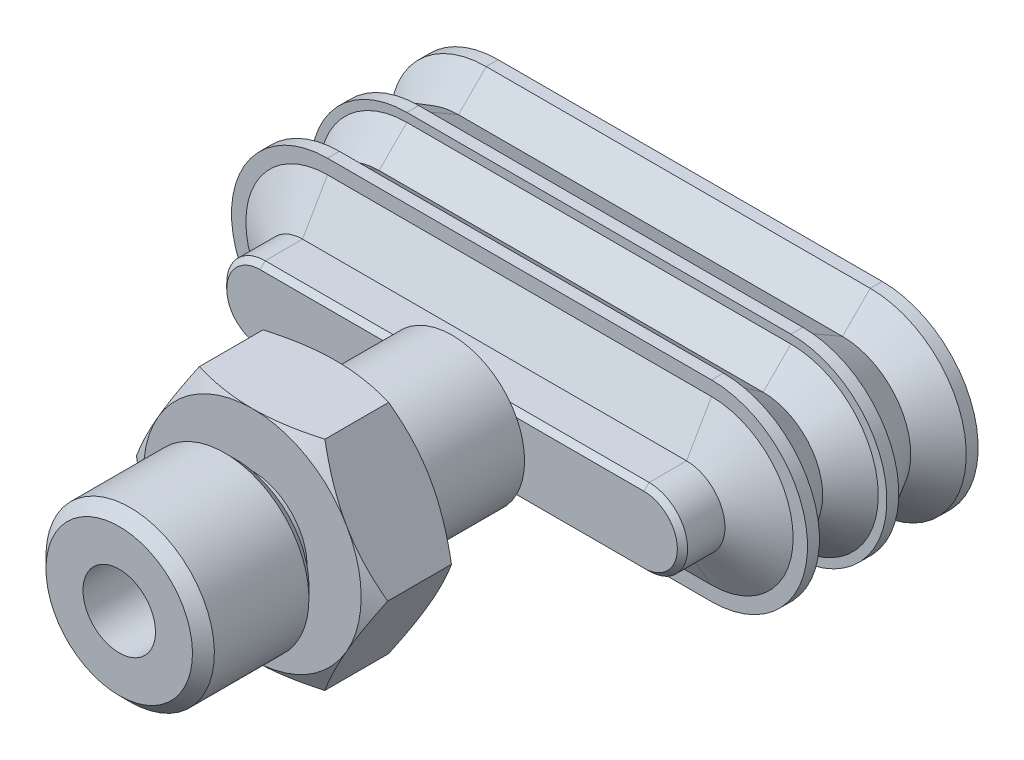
ISO-10303-21;
HEADER;
FILE_DESCRIPTION(('STEP AP214'),'2;1');
FILE_NAME('part.step','',(''),(''),'','','');
FILE_SCHEMA(('AUTOMOTIVE_DESIGN { 1 0 10303 214 1 1 1 1 }'));
ENDSEC;
DATA;
#1=APPLICATION_CONTEXT('core data for automotive mechanical design processes');
#2=APPLICATION_PROTOCOL_DEFINITION('international standard','automotive_design',2000,#1);
#3=PRODUCT_CONTEXT('',#1,'mechanical');
#4=PRODUCT('Part','Part','',(#3));
#5=PRODUCT_RELATED_PRODUCT_CATEGORY('part','',(#4));
#6=PRODUCT_DEFINITION_FORMATION('','',#4);
#7=PRODUCT_DEFINITION_CONTEXT('part definition',#1,'design');
#8=PRODUCT_DEFINITION('design','',#6,#7);
#9=PRODUCT_DEFINITION_SHAPE('','',#8);
#10=(LENGTH_UNIT() NAMED_UNIT(*) SI_UNIT(.MILLI.,.METRE.));
#11=(NAMED_UNIT(*) PLANE_ANGLE_UNIT() SI_UNIT($,.RADIAN.));
#12=(NAMED_UNIT(*) SI_UNIT($,.STERADIAN.) SOLID_ANGLE_UNIT());
#13=UNCERTAINTY_MEASURE_WITH_UNIT(LENGTH_MEASURE(1.E-05),#10,'distance_accuracy_value','');
#14=(GEOMETRIC_REPRESENTATION_CONTEXT(3) GLOBAL_UNCERTAINTY_ASSIGNED_CONTEXT((#13)) GLOBAL_UNIT_ASSIGNED_CONTEXT((#10,
#11,#12)) REPRESENTATION_CONTEXT('',''));
#15=CARTESIAN_POINT('',(0.,0.,0.));
#16=DIRECTION('',(0.,0.,1.));
#17=DIRECTION('',(1.,0.,0.));
#18=AXIS2_PLACEMENT_3D('',#15,#16,#17);
#19=CARTESIAN_POINT('',(9.,-1.8,2.63));
#20=DIRECTION('',(1.,0.,0.));
#21=DIRECTION('',(0.,1.,0.));
#22=AXIS2_PLACEMENT_3D('',#19,#20,#21);
#23=PLANE('',#22);
#24=DIRECTION('',(0.,1.,0.));
#25=VECTOR('',#24,1.);
#26=CARTESIAN_POINT('',(9.,-1.8,7.13));
#27=LINE('',#26,#25);
#28=CARTESIAN_POINT('',(9.,-1.8,7.13));
#29=VERTEX_POINT('',#28);
#30=CARTESIAN_POINT('',(9.,1.8,7.13));
#31=VERTEX_POINT('',#30);
#32=EDGE_CURVE('E751',#29,#31,#27,.T.);
#33=ORIENTED_EDGE('',*,*,#32,.F.);
#34=DIRECTION('',(0.,0.,1.));
#35=VECTOR('',#34,1.);
#36=CARTESIAN_POINT('',(9.,-1.8,2.63));
#37=LINE('',#36,#35);
#38=CARTESIAN_POINT('',(9.,-1.8,2.63));
#39=VERTEX_POINT('',#38);
#40=EDGE_CURVE('E664',#39,#29,#37,.T.);
#41=ORIENTED_EDGE('',*,*,#40,.F.);
#42=DIRECTION('',(0.,1.,0.));
#43=VECTOR('',#42,1.);
#44=CARTESIAN_POINT('',(9.,-1.8,2.63));
#45=LINE('',#44,#43);
#46=CARTESIAN_POINT('',(9.,1.8,2.63));
#47=VERTEX_POINT('',#46);
#48=EDGE_CURVE('E681',#39,#47,#45,.T.);
#49=ORIENTED_EDGE('',*,*,#48,.T.);
#50=DIRECTION('',(0.,0.,1.));
#51=VECTOR('',#50,1.);
#52=CARTESIAN_POINT('',(9.,1.8,2.63));
#53=LINE('',#52,#51);
#54=EDGE_CURVE('E788',#47,#31,#53,.T.);
#55=ORIENTED_EDGE('',*,*,#54,.T.);
#56=EDGE_LOOP('',(#33,#41,#49,#55));
#57=FACE_BOUND('',#56,.T.);
#58=ADVANCED_FACE('F15',(#57),#23,.T.);
#59=CARTESIAN_POINT('',(12.375,1.8,2.63));
#60=DIRECTION('',(-1.,0.,0.));
#61=DIRECTION('',(0.,0.,1.));
#62=AXIS2_PLACEMENT_3D('',#59,#60,#61);
#63=PLANE('',#62);
#64=DIRECTION('',(0.,-1.,0.));
#65=VECTOR('',#64,1.);
#66=CARTESIAN_POINT('',(12.375,1.8,7.13));
#67=LINE('',#66,#65);
#68=CARTESIAN_POINT('',(12.375,1.8,7.13));
#69=VERTEX_POINT('',#68);
#70=CARTESIAN_POINT('',(12.375,-1.8,7.13));
#71=VERTEX_POINT('',#70);
#72=EDGE_CURVE('E711',#69,#71,#67,.T.);
#73=ORIENTED_EDGE('',*,*,#72,.F.);
#74=DIRECTION('',(0.,0.,1.));
#75=VECTOR('',#74,1.);
#76=CARTESIAN_POINT('',(12.375,1.8,2.63));
#77=LINE('',#76,#75);
#78=CARTESIAN_POINT('',(12.375,1.8,2.63));
#79=VERTEX_POINT('',#78);
#80=EDGE_CURVE('E806',#79,#69,#77,.T.);
#81=ORIENTED_EDGE('',*,*,#80,.F.);
#82=DIRECTION('',(0.,-1.,0.));
#83=VECTOR('',#82,1.);
#84=CARTESIAN_POINT('',(12.375,1.8,2.63));
#85=LINE('',#84,#83);
#86=CARTESIAN_POINT('',(12.375,-1.8,2.63));
#87=VERTEX_POINT('',#86);
#88=EDGE_CURVE('E799',#79,#87,#85,.T.);
#89=ORIENTED_EDGE('',*,*,#88,.T.);
#90=DIRECTION('',(0.,0.,1.));
#91=VECTOR('',#90,1.);
#92=CARTESIAN_POINT('',(12.375,-1.8,2.63));
#93=LINE('',#92,#91);
#94=EDGE_CURVE('E699',#87,#71,#93,.T.);
#95=ORIENTED_EDGE('',*,*,#94,.T.);
#96=EDGE_LOOP('',(#73,#81,#89,#95));
#97=FACE_BOUND('',#96,.T.);
#98=ADVANCED_FACE('F1177',(#97),#63,.T.);
#99=CARTESIAN_POINT('',(0.,0.,2.63));
#100=DIRECTION('',(0.,0.,1.));
#101=DIRECTION('',(0.,1.,0.));
#102=AXIS2_PLACEMENT_3D('',#99,#100,#101);
#103=CYLINDRICAL_SURFACE('',#102,3.);
#104=CARTESIAN_POINT('',(0.,0.,7.13));
#105=DIRECTION('',(0.,0.,1.));
#106=DIRECTION('',(-1.,0.,0.));
#107=AXIS2_PLACEMENT_3D('',#104,#105,#106);
#108=CIRCLE('',#107,3.);
#109=CARTESIAN_POINT('',(2.4,-1.8,7.13));
#110=VERTEX_POINT('',#109);
#111=CARTESIAN_POINT('',(2.4,1.8,7.13));
#112=VERTEX_POINT('',#111);
#113=EDGE_CURVE('E754',#110,#112,#108,.T.);
#114=ORIENTED_EDGE('',*,*,#113,.T.);
#115=DIRECTION('',(0.,0.,1.));
#116=VECTOR('',#115,1.);
#117=CARTESIAN_POINT('',(2.4,1.8,2.63));
#118=LINE('',#117,#116);
#119=CARTESIAN_POINT('',(2.4,1.8,2.63));
#120=VERTEX_POINT('',#119);
#121=EDGE_CURVE('E671',#120,#112,#118,.T.);
#122=ORIENTED_EDGE('',*,*,#121,.F.);
#123=CARTESIAN_POINT('',(0.,0.,2.63));
#124=DIRECTION('',(0.,0.,1.));
#125=DIRECTION('',(-1.,0.,0.));
#126=AXIS2_PLACEMENT_3D('',#123,#124,#125);
#127=CIRCLE('',#126,3.);
#128=CARTESIAN_POINT('',(2.4,-1.8,2.63));
#129=VERTEX_POINT('',#128);
#130=EDGE_CURVE('E668',#129,#120,#127,.T.);
#131=ORIENTED_EDGE('',*,*,#130,.F.);
#132=DIRECTION('',(0.,0.,1.));
#133=VECTOR('',#132,1.);
#134=CARTESIAN_POINT('',(2.4,-1.8,2.63));
#135=LINE('',#134,#133);
#136=EDGE_CURVE('E654',#129,#110,#135,.T.);
#137=ORIENTED_EDGE('',*,*,#136,.T.);
#138=EDGE_LOOP('',(#114,#122,#131,#137));
#139=FACE_BOUND('',#138,.T.);
#140=ADVANCED_FACE('F669',(#139),#103,.F.);
#141=CARTESIAN_POINT('',(0.,0.,2.63));
#142=DIRECTION('',(0.,0.,1.));
#143=DIRECTION('',(0.,1.,0.));
#144=AXIS2_PLACEMENT_3D('',#141,#142,#143);
#145=CYLINDRICAL_SURFACE('',#144,3.);
#146=CARTESIAN_POINT('',(0.,0.,7.13));
#147=DIRECTION('',(0.,0.,1.));
#148=DIRECTION('',(-1.,0.,0.));
#149=AXIS2_PLACEMENT_3D('',#146,#147,#148);
#150=CIRCLE('',#149,3.);
#151=CARTESIAN_POINT('',(-2.4,1.8,7.13));
#152=VERTEX_POINT('',#151);
#153=CARTESIAN_POINT('',(-2.4,-1.8,7.13));
#154=VERTEX_POINT('',#153);
#155=EDGE_CURVE('E775',#152,#154,#150,.T.);
#156=ORIENTED_EDGE('',*,*,#155,.T.);
#157=DIRECTION('',(0.,0.,1.));
#158=VECTOR('',#157,1.);
#159=CARTESIAN_POINT('',(-2.4,-1.8,2.63));
#160=LINE('',#159,#158);
#161=CARTESIAN_POINT('',(-2.4,-1.8,2.63));
#162=VERTEX_POINT('',#161);
#163=EDGE_CURVE('E700',#162,#154,#160,.T.);
#164=ORIENTED_EDGE('',*,*,#163,.F.);
#165=CARTESIAN_POINT('',(0.,0.,2.63));
#166=DIRECTION('',(0.,0.,1.));
#167=DIRECTION('',(-1.,0.,0.));
#168=AXIS2_PLACEMENT_3D('',#165,#166,#167);
#169=CIRCLE('',#168,3.);
#170=CARTESIAN_POINT('',(-2.4,1.8,2.63));
#171=VERTEX_POINT('',#170);
#172=EDGE_CURVE('E800',#171,#162,#169,.T.);
#173=ORIENTED_EDGE('',*,*,#172,.F.);
#174=DIRECTION('',(0.,0.,1.));
#175=VECTOR('',#174,1.);
#176=CARTESIAN_POINT('',(-2.4,1.8,2.63));
#177=LINE('',#176,#175);
#178=EDGE_CURVE('E1035',#171,#152,#177,.T.);
#179=ORIENTED_EDGE('',*,*,#178,.T.);
#180=EDGE_LOOP('',(#156,#164,#173,#179));
#181=FACE_BOUND('',#180,.T.);
#182=ADVANCED_FACE('F1706',(#181),#145,.F.);
#183=CARTESIAN_POINT('',(-9.,1.8,2.63));
#184=DIRECTION('',(-1.,0.,0.));
#185=DIRECTION('',(0.,1.,0.));
#186=AXIS2_PLACEMENT_3D('',#183,#184,#185);
#187=PLANE('',#186);
#188=DIRECTION('',(0.,-1.,0.));
#189=VECTOR('',#188,1.);
#190=CARTESIAN_POINT('',(-9.,1.8,7.13));
#191=LINE('',#190,#189);
#192=CARTESIAN_POINT('',(-9.,1.8,7.13));
#193=VERTEX_POINT('',#192);
#194=CARTESIAN_POINT('',(-9.,-1.8,7.13));
#195=VERTEX_POINT('',#194);
#196=EDGE_CURVE('E829',#193,#195,#191,.T.);
#197=ORIENTED_EDGE('',*,*,#196,.F.);
#198=DIRECTION('',(0.,0.,1.));
#199=VECTOR('',#198,1.);
#200=CARTESIAN_POINT('',(-9.,1.8,2.63));
#201=LINE('',#200,#199);
#202=CARTESIAN_POINT('',(-9.,1.8,2.63));
#203=VERTEX_POINT('',#202);
#204=EDGE_CURVE('E1040',#203,#193,#201,.T.);
#205=ORIENTED_EDGE('',*,*,#204,.F.);
#206=DIRECTION('',(0.,-1.,0.));
#207=VECTOR('',#206,1.);
#208=CARTESIAN_POINT('',(-9.,1.8,2.63));
#209=LINE('',#208,#207);
#210=CARTESIAN_POINT('',(-9.,-1.8,2.63));
#211=VERTEX_POINT('',#210);
#212=EDGE_CURVE('E1355',#203,#211,#209,.T.);
#213=ORIENTED_EDGE('',*,*,#212,.T.);
#214=DIRECTION('',(0.,0.,1.));
#215=VECTOR('',#214,1.);
#216=CARTESIAN_POINT('',(-9.,-1.8,2.63));
#217=LINE('',#216,#215);
#218=EDGE_CURVE('E1106',#211,#195,#217,.T.);
#219=ORIENTED_EDGE('',*,*,#218,.T.);
#220=EDGE_LOOP('',(#197,#205,#213,#219));
#221=FACE_BOUND('',#220,.T.);
#222=ADVANCED_FACE('F2968',(#221),#187,.T.);
#223=CARTESIAN_POINT('',(-12.375,-1.8,2.63));
#224=DIRECTION('',(1.,0.,0.));
#225=DIRECTION('',(0.,1.,0.));
#226=AXIS2_PLACEMENT_3D('',#223,#224,#225);
#227=PLANE('',#226);
#228=DIRECTION('',(0.,1.,0.));
#229=VECTOR('',#228,1.);
#230=CARTESIAN_POINT('',(-12.375,-1.8,7.13));
#231=LINE('',#230,#229);
#232=CARTESIAN_POINT('',(-12.375,-1.8,7.13));
#233=VERTEX_POINT('',#232);
#234=CARTESIAN_POINT('',(-12.375,1.8,7.13));
#235=VERTEX_POINT('',#234);
#236=EDGE_CURVE('E1273',#233,#235,#231,.T.);
#237=ORIENTED_EDGE('',*,*,#236,.F.);
#238=DIRECTION('',(0.,0.,1.));
#239=VECTOR('',#238,1.);
#240=CARTESIAN_POINT('',(-12.375,-1.8,2.63));
#241=LINE('',#240,#239);
#242=CARTESIAN_POINT('',(-12.375,-1.8,2.63));
#243=VERTEX_POINT('',#242);
#244=EDGE_CURVE('E767',#243,#233,#241,.T.);
#245=ORIENTED_EDGE('',*,*,#244,.F.);
#246=DIRECTION('',(0.,1.,0.));
#247=VECTOR('',#246,1.);
#248=CARTESIAN_POINT('',(-12.375,-1.8,2.63));
#249=LINE('',#248,#247);
#250=CARTESIAN_POINT('',(-12.375,1.8,2.63));
#251=VERTEX_POINT('',#250);
#252=EDGE_CURVE('E1238',#243,#251,#249,.T.);
#253=ORIENTED_EDGE('',*,*,#252,.T.);
#254=DIRECTION('',(0.,0.,1.));
#255=VECTOR('',#254,1.);
#256=CARTESIAN_POINT('',(-12.375,1.8,2.63));
#257=LINE('',#256,#255);
#258=EDGE_CURVE('E998',#251,#235,#257,.T.);
#259=ORIENTED_EDGE('',*,*,#258,.T.);
#260=EDGE_LOOP('',(#237,#245,#253,#259));
#261=FACE_BOUND('',#260,.T.);
#262=ADVANCED_FACE('F1890',(#261),#227,.T.);
#263=CARTESIAN_POINT('',(14.75,0.,2.63));
#264=DIRECTION('',(0.,0.,1.));
#265=DIRECTION('',(0.,1.,0.));
#266=AXIS2_PLACEMENT_3D('',#263,#264,#265);
#267=CYLINDRICAL_SURFACE('',#266,1.8);
#268=CARTESIAN_POINT('',(14.75,0.,7.13));
#269=DIRECTION('',(0.,0.,1.));
#270=DIRECTION('',(-1.,0.,0.));
#271=AXIS2_PLACEMENT_3D('',#268,#269,#270);
#272=CIRCLE('',#271,1.8);
#273=CARTESIAN_POINT('',(14.75,-1.8,7.13));
#274=VERTEX_POINT('',#273);
#275=CARTESIAN_POINT('',(14.75,1.8,7.13));
#276=VERTEX_POINT('',#275);
#277=EDGE_CURVE('E707',#274,#276,#272,.T.);
#278=ORIENTED_EDGE('',*,*,#277,.F.);
#279=DIRECTION('',(0.,0.,1.));
#280=VECTOR('',#279,1.);
#281=CARTESIAN_POINT('',(14.75,-1.8,2.63));
#282=LINE('',#281,#280);
#283=CARTESIAN_POINT('',(14.75,-1.8,2.63));
#284=VERTEX_POINT('',#283);
#285=EDGE_CURVE('E772',#284,#274,#282,.T.);
#286=ORIENTED_EDGE('',*,*,#285,.F.);
#287=CARTESIAN_POINT('',(14.75,0.,2.63));
#288=DIRECTION('',(0.,0.,1.));
#289=DIRECTION('',(-1.,0.,0.));
#290=AXIS2_PLACEMENT_3D('',#287,#288,#289);
#291=CIRCLE('',#290,1.8);
#292=CARTESIAN_POINT('',(14.75,1.8,2.63));
#293=VERTEX_POINT('',#292);
#294=EDGE_CURVE('E1147',#284,#293,#291,.T.);
#295=ORIENTED_EDGE('',*,*,#294,.T.);
#296=DIRECTION('',(0.,0.,1.));
#297=VECTOR('',#296,1.);
#298=CARTESIAN_POINT('',(14.75,1.8,2.63));
#299=LINE('',#298,#297);
#300=EDGE_CURVE('E805',#293,#276,#299,.T.);
#301=ORIENTED_EDGE('',*,*,#300,.T.);
#302=EDGE_LOOP('',(#278,#286,#295,#301));
#303=FACE_BOUND('',#302,.T.);
#304=ADVANCED_FACE('F2961',(#303),#267,.T.);
#305=CARTESIAN_POINT('',(-14.75,0.,2.63));
#306=DIRECTION('',(0.,0.,1.));
#307=DIRECTION('',(0.,1.,0.));
#308=AXIS2_PLACEMENT_3D('',#305,#306,#307);
#309=CYLINDRICAL_SURFACE('',#308,1.8);
#310=CARTESIAN_POINT('',(-14.75,0.,7.13));
#311=DIRECTION('',(0.,0.,1.));
#312=DIRECTION('',(-1.,0.,0.));
#313=AXIS2_PLACEMENT_3D('',#310,#311,#312);
#314=CIRCLE('',#313,1.8);
#315=CARTESIAN_POINT('',(-14.75,1.8,7.13));
#316=VERTEX_POINT('',#315);
#317=CARTESIAN_POINT('',(-14.75,-1.8,7.13));
#318=VERTEX_POINT('',#317);
#319=EDGE_CURVE('E710',#316,#318,#314,.T.);
#320=ORIENTED_EDGE('',*,*,#319,.F.);
#321=DIRECTION('',(0.,0.,1.));
#322=VECTOR('',#321,1.);
#323=CARTESIAN_POINT('',(-14.75,1.8,2.63));
#324=LINE('',#323,#322);
#325=CARTESIAN_POINT('',(-14.75,1.8,2.63));
#326=VERTEX_POINT('',#325);
#327=EDGE_CURVE('E995',#326,#316,#324,.T.);
#328=ORIENTED_EDGE('',*,*,#327,.F.);
#329=CARTESIAN_POINT('',(-14.75,0.,2.63));
#330=DIRECTION('',(0.,0.,1.));
#331=DIRECTION('',(-1.,0.,0.));
#332=AXIS2_PLACEMENT_3D('',#329,#330,#331);
#333=CIRCLE('',#332,1.8);
#334=CARTESIAN_POINT('',(-14.75,-1.8,2.63));
#335=VERTEX_POINT('',#334);
#336=EDGE_CURVE('E691',#326,#335,#333,.T.);
#337=ORIENTED_EDGE('',*,*,#336,.T.);
#338=DIRECTION('',(0.,0.,1.));
#339=VECTOR('',#338,1.);
#340=CARTESIAN_POINT('',(-14.75,-1.8,2.63));
#341=LINE('',#340,#339);
#342=EDGE_CURVE('E665',#335,#318,#341,.T.);
#343=ORIENTED_EDGE('',*,*,#342,.T.);
#344=EDGE_LOOP('',(#320,#328,#337,#343));
#345=FACE_BOUND('',#344,.T.);
#346=ADVANCED_FACE('F2518',(#345),#309,.T.);
#347=CARTESIAN_POINT('',(-2.83333333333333,0.,31.6));
#348=DIRECTION('',(0.,0.,1.));
#349=DIRECTION('',(-1.,0.,0.));
#350=AXIS2_PLACEMENT_3D('',#347,#348,#349);
#351=PLANE('',#350);
#352=CARTESIAN_POINT('',(0.,0.,31.6));
#353=DIRECTION('',(0.,0.,-1.));
#354=DIRECTION('',(0.,-1.,0.));
#355=AXIS2_PLACEMENT_3D('',#352,#353,#354);
#356=CIRCLE('',#355,2.83333333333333);
#357=CARTESIAN_POINT('',(0.,-2.83333333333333,31.6));
#358=VERTEX_POINT('',#357);
#359=EDGE_CURVE('E10',#358,#358,#356,.T.);
#360=ORIENTED_EDGE('',*,*,#359,.F.);
#361=EDGE_LOOP('',(#360));
#362=FACE_BOUND('',#361,.T.);
#363=CARTESIAN_POINT('',(0.,0.,31.6));
#364=DIRECTION('',(0.,0.,1.));
#365=DIRECTION('',(0.,1.,0.));
#366=AXIS2_PLACEMENT_3D('',#363,#364,#365);
#367=CIRCLE('',#366,1.41666666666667);
#368=CARTESIAN_POINT('',(0.,1.41666666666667,31.6));
#369=VERTEX_POINT('',#368);
#370=EDGE_CURVE('E824',#369,#369,#367,.T.);
#371=ORIENTED_EDGE('',*,*,#370,.F.);
#372=EDGE_LOOP('',(#371));
#373=FACE_BOUND('',#372,.T.);
#374=ADVANCED_FACE('F2515',(#362,#373),#351,.T.);
#375=CARTESIAN_POINT('',(0.,0.,31.6));
#376=DIRECTION('',(0.,0.,-1.));
#377=DIRECTION('',(0.,-1.,0.));
#378=AXIS2_PLACEMENT_3D('',#375,#376,#377);
#379=CYLINDRICAL_SURFACE('',#378,2.83333333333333);
#380=CARTESIAN_POINT('',(0.,0.,44.6));
#381=DIRECTION('',(0.,0.,-1.));
#382=DIRECTION('',(0.,-1.,0.));
#383=AXIS2_PLACEMENT_3D('',#380,#381,#382);
#384=CIRCLE('',#383,2.83333333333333);
#385=CARTESIAN_POINT('',(0.,-2.83333333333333,44.6));
#386=VERTEX_POINT('',#385);
#387=EDGE_CURVE('E1087',#386,#386,#384,.T.);
#388=ORIENTED_EDGE('',*,*,#387,.F.);
#389=EDGE_LOOP('',(#388));
#390=FACE_BOUND('',#389,.T.);
#391=ORIENTED_EDGE('',*,*,#359,.T.);
#392=EDGE_LOOP('',(#391));
#393=FACE_BOUND('',#392,.T.);
#394=ADVANCED_FACE('F2517',(#390,#393),#379,.F.);
#395=CARTESIAN_POINT('',(0.,0.,34.2));
#396=DIRECTION('',(0.,0.,-1.));
#397=DIRECTION('',(0.,-1.,0.));
#398=AXIS2_PLACEMENT_3D('',#395,#396,#397);
#399=CONICAL_SURFACE('',#398,8.5,1.0471975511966);
#400=CARTESIAN_POINT('',(7.36121593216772,4.25000000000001,34.2));
#401=CARTESIAN_POINT('',(7.2581837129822,4.42832831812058,34.2000718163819));
#402=CARTESIAN_POINT('',(7.15510981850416,4.60662918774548,34.1957826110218));
#403=CARTESIAN_POINT('',(6.94951766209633,4.96244722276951,34.1786479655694));
#404=CARTESIAN_POINT('',(6.84699865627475,5.13996515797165,34.1658274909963));
#405=CARTESIAN_POINT('',(6.64164494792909,5.49610131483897,34.1316440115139));
#406=CARTESIAN_POINT('',(6.53881550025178,5.67471534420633,34.1102063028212));
#407=CARTESIAN_POINT('',(6.33156207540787,6.03460644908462,34.0589395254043));
#408=CARTESIAN_POINT('',(6.22714701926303,6.21586590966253,34.0289521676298));
#409=CARTESIAN_POINT('',(6.02299474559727,6.56950744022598,33.96296187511));
#410=CARTESIAN_POINT('',(5.92324635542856,6.74194089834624,33.9272667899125));
#411=CARTESIAN_POINT('',(5.72306409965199,7.0880918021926,33.8488764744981));
#412=CARTESIAN_POINT('',(5.62263961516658,7.26179438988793,33.8060918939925));
#413=CARTESIAN_POINT('',(5.42055560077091,7.61147967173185,33.7135922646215));
#414=CARTESIAN_POINT('',(5.31891127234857,7.78743893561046,33.6637562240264));
#415=CARTESIAN_POINT('',(5.11385988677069,8.14250575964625,33.5571721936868));
#416=CARTESIAN_POINT('',(5.01047224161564,8.32158213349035,33.5002826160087));
#417=CARTESIAN_POINT('',(4.90747728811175,8.49999999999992,33.4408106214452));
#418=B_SPLINE_CURVE_WITH_KNOTS('',3,(#400,#401,#402,#403,#404,#405,#406,#407,#408,#409,#410,
#411,#412,#413,#414,#415,#416,#417),.UNSPECIFIED.,.F.,.F.,(4,2,2,2,2,2,2,2,4),(0.,
0.61780712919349,1.23381423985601,1.85528090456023,2.48909748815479,3.09612330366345,
3.71148028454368,4.33908505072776,4.98237095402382),.UNSPECIFIED.);
#419=CARTESIAN_POINT('',(7.36121593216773,4.25,34.2));
#420=VERTEX_POINT('',#419);
#421=CARTESIAN_POINT('',(4.90747728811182,8.5,33.4408106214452));
#422=VERTEX_POINT('',#421);
#423=EDGE_CURVE('E2117',#420,#422,#418,.T.);
#424=ORIENTED_EDGE('',*,*,#423,.T.);
#425=CARTESIAN_POINT('',(4.90747728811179,8.49999999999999,33.4408106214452));
#426=CARTESIAN_POINT('',(4.70191543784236,8.4999880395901,33.5001521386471));
#427=CARTESIAN_POINT('',(4.49559264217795,8.49996968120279,33.5569308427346));
#428=CARTESIAN_POINT('',(4.0865372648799,8.49996443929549,33.6633175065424));
#429=CARTESIAN_POINT('',(3.88384159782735,8.49997679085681,33.713067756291));
#430=CARTESIAN_POINT('',(3.48104775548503,8.50007144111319,33.8054197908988));
#431=CARTESIAN_POINT('',(3.28097778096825,8.50015234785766,33.8481437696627));
#432=CARTESIAN_POINT('',(2.88232509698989,8.50037240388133,33.926438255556));
#433=CARTESIAN_POINT('',(2.68376032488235,8.50051072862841,33.9620998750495));
#434=CARTESIAN_POINT('',(2.27568420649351,8.50047010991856,34.0282218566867));
#435=CARTESIAN_POINT('',(2.06611672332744,8.50027515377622,34.0583381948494));
#436=CARTESIAN_POINT('',(1.64994699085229,8.49986672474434,34.1098268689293));
#437=CARTESIAN_POINT('',(1.44336413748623,8.49965367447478,34.1313545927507));
#438=CARTESIAN_POINT('',(1.03118619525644,8.49951430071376,34.1656851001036));
#439=CARTESIAN_POINT('',(0.825597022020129,8.49958562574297,34.1785584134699));
#440=CARTESIAN_POINT('',(0.413340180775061,8.49979592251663,34.1957671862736));
#441=CARTESIAN_POINT('',(0.206671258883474,8.49993513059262,34.2000725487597));
#442=CARTESIAN_POINT('',(0.,8.5,34.2));
#443=B_SPLINE_CURVE_WITH_KNOTS('',3,(#425,#426,#427,#428,#429,#430,#431,#432,#433,#434,#435,
#436,#437,#438,#439,#440,#441,#442),.UNSPECIFIED.,.F.,.F.,(4,2,2,2,2,2,2,2,4),(0.,
0.6418804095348,1.26793388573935,1.88157234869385,2.48668804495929,3.12170024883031,
3.74463687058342,4.3624332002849,4.98239588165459),.UNSPECIFIED.);
#444=CARTESIAN_POINT('',(0.,8.5,34.2));
#445=VERTEX_POINT('',#444);
#446=EDGE_CURVE('E2119',#422,#445,#443,.T.);
#447=ORIENTED_EDGE('',*,*,#446,.T.);
#448=CARTESIAN_POINT('',(0.,0.,34.2));
#449=DIRECTION('',(0.,0.,-1.));
#450=DIRECTION('',(0.,-1.,0.));
#451=AXIS2_PLACEMENT_3D('',#448,#449,#450);
#452=CIRCLE('',#451,8.5);
#453=EDGE_CURVE('E28',#445,#420,#452,.T.);
#454=ORIENTED_EDGE('',*,*,#453,.T.);
#455=EDGE_LOOP('',(#424,#447,#454));
#456=FACE_BOUND('',#455,.T.);
#457=ADVANCED_FACE('F2722',(#456),#399,.T.);
#458=CARTESIAN_POINT('',(-4.276025,0.,34.2));
#459=DIRECTION('',(0.,0.,-1.));
#460=DIRECTION('',(0.,-1.,0.));
#461=AXIS2_PLACEMENT_3D('',#458,#459,#460);
#462=PLANE('',#461);
#463=CARTESIAN_POINT('',(0.,0.,34.2));
#464=DIRECTION('',(0.,0.,-1.));
#465=DIRECTION('',(0.,-1.,0.));
#466=AXIS2_PLACEMENT_3D('',#463,#464,#465);
#467=CIRCLE('',#466,4.276025);
#468=CARTESIAN_POINT('',(0.,-4.276025,34.2));
#469=VERTEX_POINT('',#468);
#470=EDGE_CURVE('E733',#469,#469,#467,.T.);
#471=ORIENTED_EDGE('',*,*,#470,.T.);
#472=EDGE_LOOP('',(#471));
#473=FACE_BOUND('',#472,.T.);
#474=CARTESIAN_POINT('',(0.,0.,34.2));
#475=DIRECTION('',(0.,0.,-1.));
#476=DIRECTION('',(0.,-1.,0.));
#477=AXIS2_PLACEMENT_3D('',#474,#475,#476);
#478=CIRCLE('',#477,8.5);
#479=CARTESIAN_POINT('',(-7.36121593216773,-4.25,34.2));
#480=VERTEX_POINT('',#479);
#481=CARTESIAN_POINT('',(-7.36121593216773,4.25,34.2));
#482=VERTEX_POINT('',#481);
#483=EDGE_CURVE('E2167',#480,#482,#478,.T.);
#484=ORIENTED_EDGE('',*,*,#483,.F.);
#485=CARTESIAN_POINT('',(0.,0.,34.2));
#486=DIRECTION('',(0.,0.,-1.));
#487=DIRECTION('',(0.,-1.,0.));
#488=AXIS2_PLACEMENT_3D('',#485,#486,#487);
#489=CIRCLE('',#488,8.5);
#490=CARTESIAN_POINT('',(0.,-8.5,34.2));
#491=VERTEX_POINT('',#490);
#492=EDGE_CURVE('E2629',#491,#480,#489,.T.);
#493=ORIENTED_EDGE('',*,*,#492,.F.);
#494=CARTESIAN_POINT('',(0.,0.,34.2));
#495=DIRECTION('',(0.,0.,-1.));
#496=DIRECTION('',(0.,-1.,0.));
#497=AXIS2_PLACEMENT_3D('',#494,#495,#496);
#498=CIRCLE('',#497,8.5);
#499=CARTESIAN_POINT('',(7.36121593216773,-4.25,34.2));
#500=VERTEX_POINT('',#499);
#501=EDGE_CURVE('E1828',#500,#491,#498,.T.);
#502=ORIENTED_EDGE('',*,*,#501,.F.);
#503=CARTESIAN_POINT('',(0.,0.,34.2));
#504=DIRECTION('',(0.,0.,-1.));
#505=DIRECTION('',(0.,-1.,0.));
#506=AXIS2_PLACEMENT_3D('',#503,#504,#505);
#507=CIRCLE('',#506,8.5);
#508=EDGE_CURVE('E2111',#420,#500,#507,.T.);
#509=ORIENTED_EDGE('',*,*,#508,.F.);
#510=ORIENTED_EDGE('',*,*,#453,.F.);
#511=CARTESIAN_POINT('',(0.,0.,34.2));
#512=DIRECTION('',(0.,0.,-1.));
#513=DIRECTION('',(0.,-1.,0.));
#514=AXIS2_PLACEMENT_3D('',#511,#512,#513);
#515=CIRCLE('',#514,8.5);
#516=EDGE_CURVE('E1422',#482,#445,#515,.T.);
#517=ORIENTED_EDGE('',*,*,#516,.F.);
#518=EDGE_LOOP('',(#484,#493,#502,#509,#510,#517));
#519=FACE_BOUND('',#518,.T.);
#520=ADVANCED_FACE('F2420',(#473,#519),#462,.F.);
#521=CARTESIAN_POINT('',(0.,0.,34.2));
#522=DIRECTION('',(0.,0.,-1.));
#523=DIRECTION('',(0.,-1.,0.));
#524=AXIS2_PLACEMENT_3D('',#521,#522,#523);
#525=CONICAL_SURFACE('',#524,8.5,1.0471975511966);
#526=ORIENTED_EDGE('',*,*,#483,.T.);
#527=CARTESIAN_POINT('',(-7.36121593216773,4.24999999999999,34.2));
#528=CARTESIAN_POINT('',(-7.46413667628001,4.07160732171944,34.2000718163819));
#529=CARTESIAN_POINT('',(-7.56701281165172,3.89319227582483,34.1957826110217));
#530=CARTESIAN_POINT('',(-7.77236419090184,3.53723522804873,34.1786479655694));
#531=CARTESIAN_POINT('',(-7.87483972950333,3.35969219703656,34.1658274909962));
#532=CARTESIAN_POINT('',(-8.08058583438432,3.00378259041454,34.1316440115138));
#533=CARTESIAN_POINT('',(-8.18385539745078,2.82542266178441,34.110206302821));
#534=CARTESIAN_POINT('',(-8.39190352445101,2.46599037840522,34.0589395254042));
#535=CARTESIAN_POINT('',(-8.49667129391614,2.28493455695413,34.0289521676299));
#536=CARTESIAN_POINT('',(-8.70085770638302,1.93131273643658,33.9629618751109));
#537=CARTESIAN_POINT('',(-8.80031526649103,1.75871136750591,33.9272667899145));
#538=CARTESIAN_POINT('',(-8.99999961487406,1.41227299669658,33.8488764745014));
#539=CARTESIAN_POINT('',(-9.10021822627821,1.23845154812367,33.8060918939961));
#540=CARTESIAN_POINT('',(-9.30201255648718,0.888599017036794,33.7135922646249));
#541=CARTESIAN_POINT('',(-9.40357558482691,0.712592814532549,33.6637562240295));
#542=CARTESIAN_POINT('',(-9.60854678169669,0.357479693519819,33.5571721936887));
#543=CARTESIAN_POINT('',(-9.71193764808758,0.178405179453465,33.5002826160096));
#544=CARTESIAN_POINT('',(-9.81495457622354,0.,33.4408106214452));
#545=B_SPLINE_CURVE_WITH_KNOTS('',3,(#527,#528,#529,#530,#531,#532,#533,#534,#535,#536,#537,
#538,#539,#540,#541,#542,#543,#544),.UNSPECIFIED.,.F.,.F.,(4,2,2,2,2,2,2,2,4),(0.,
0.617807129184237,1.23381423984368,1.85528090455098,2.48909748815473,3.09612330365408,
3.71148028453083,4.33908505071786,4.98237095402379),.UNSPECIFIED.);
#546=CARTESIAN_POINT('',(-9.81495457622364,0.,33.4408106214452));
#547=VERTEX_POINT('',#546);
#548=EDGE_CURVE('E2013',#482,#547,#545,.T.);
#549=ORIENTED_EDGE('',*,*,#548,.T.);
#550=CARTESIAN_POINT('',(-9.81495457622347,0.,33.4408106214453));
#551=CARTESIAN_POINT('',(-9.71193436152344,-0.178411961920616,33.5002843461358));
#552=CARTESIAN_POINT('',(-9.60853036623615,-0.357485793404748,33.557181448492));
#553=CARTESIAN_POINT('',(-9.40354516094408,-0.712549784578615,33.6637751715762));
#554=CARTESIAN_POINT('',(-9.30198167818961,-0.888507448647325,33.7136144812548));
#555=CARTESIAN_POINT('',(-9.10020735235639,-1.23822149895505,33.8061149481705));
#556=CARTESIAN_POINT('',(-9.00000939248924,-1.41195275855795,33.8488983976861));
#557=CARTESIAN_POINT('',(-8.80039184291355,-1.75817302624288,33.9272827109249));
#558=CARTESIAN_POINT('',(-8.70098053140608,-1.93064620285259,33.9629743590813));
#559=CARTESIAN_POINT('',(-8.49688119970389,-2.28407616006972,34.0289627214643));
#560=CARTESIAN_POINT('',(-8.39215504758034,-2.46506926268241,34.0589491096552));
#561=CARTESIAN_POINT('',(-8.18416783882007,-2.82447059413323,34.1102153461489));
#562=CARTESIAN_POINT('',(-8.08091688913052,-3.00286236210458,34.1316502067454));
#563=CARTESIAN_POINT('',(-7.87516415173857,-3.35891704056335,34.1658323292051));
#564=CARTESIAN_POINT('',(-7.77266329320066,-3.53657363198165,34.178650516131));
#565=CARTESIAN_POINT('',(-7.56720062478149,-3.89283003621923,34.1957847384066));
#566=CARTESIAN_POINT('',(-7.46423842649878,-4.07143100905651,34.200071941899));
#567=CARTESIAN_POINT('',(-7.36121593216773,-4.25,34.2));
#568=B_SPLINE_CURVE_WITH_KNOTS('',3,(#550,#551,#552,#553,#554,#555,#556,#557,#558,#559,#560,
#561,#562,#563,#564,#565,#566,#567),.UNSPECIFIED.,.F.,.F.,(4,2,2,2,2,2,2,2,4),(0.,
0.643309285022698,1.27079477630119,1.88589173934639,2.49251958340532,3.12611214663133,
3.74763185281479,4.36397096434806,4.98238958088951),.UNSPECIFIED.);
#569=EDGE_CURVE('E2014',#547,#480,#568,.T.);
#570=ORIENTED_EDGE('',*,*,#569,.T.);
#571=EDGE_LOOP('',(#526,#549,#570));
#572=FACE_BOUND('',#571,.T.);
#573=ADVANCED_FACE('F2400',(#572),#525,.T.);
#574=CARTESIAN_POINT('',(0.,0.,34.2));
#575=DIRECTION('',(0.,0.,-1.));
#576=DIRECTION('',(0.,-1.,0.));
#577=AXIS2_PLACEMENT_3D('',#574,#575,#576);
#578=CONICAL_SURFACE('',#577,8.5,1.0471975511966);
#579=ORIENTED_EDGE('',*,*,#492,.T.);
#580=CARTESIAN_POINT('',(-7.36121593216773,-4.25,34.2));
#581=CARTESIAN_POINT('',(-7.2581837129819,-4.42832831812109,34.2000718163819));
#582=CARTESIAN_POINT('',(-7.15510981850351,-4.6066291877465,34.1957826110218));
#583=CARTESIAN_POINT('',(-6.94951766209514,-4.96244722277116,34.1786479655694));
#584=CARTESIAN_POINT('',(-6.84699865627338,-5.13996515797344,34.1658274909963));
#585=CARTESIAN_POINT('',(-6.64164494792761,-5.4961013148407,34.1316440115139));
#586=CARTESIAN_POINT('',(-6.53881550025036,-5.67471534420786,34.1102063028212));
#587=CARTESIAN_POINT('',(-6.33156207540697,-6.03460644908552,34.0589395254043));
#588=CARTESIAN_POINT('',(-6.22714701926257,-6.21586590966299,34.0289521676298));
#589=CARTESIAN_POINT('',(-6.0229947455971,-6.56950744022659,33.9629618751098));
#590=CARTESIAN_POINT('',(-5.92324635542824,-6.74194089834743,33.9272667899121));
#591=CARTESIAN_POINT('',(-5.72306409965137,-7.08809180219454,33.8488764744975));
#592=CARTESIAN_POINT('',(-5.62263961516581,-7.26179438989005,33.8060918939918));
#593=CARTESIAN_POINT('',(-5.42055560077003,-7.61147967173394,33.7135922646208));
#594=CARTESIAN_POINT('',(-5.31891127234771,-7.78743893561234,33.6637562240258));
#595=CARTESIAN_POINT('',(-5.11385988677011,-8.14250575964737,33.5571721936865));
#596=CARTESIAN_POINT('',(-5.01047224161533,-8.3215821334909,33.5002826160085));
#597=CARTESIAN_POINT('',(-4.90747728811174,-8.49999999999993,33.4408106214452));
#598=B_SPLINE_CURVE_WITH_KNOTS('',3,(#580,#581,#582,#583,#584,#585,#586,#587,#588,#589,#590,
#591,#592,#593,#594,#595,#596,#597),.UNSPECIFIED.,.F.,.F.,(4,2,2,2,2,2,2,2,4),(0.,
0.617807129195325,1.23381423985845,1.85528090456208,2.48909748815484,3.09612330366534,
3.71148028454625,4.33908505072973,4.98237095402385),.UNSPECIFIED.);
#599=CARTESIAN_POINT('',(-4.90747728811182,-8.5,33.4408106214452));
#600=VERTEX_POINT('',#599);
#601=EDGE_CURVE('E2033',#480,#600,#598,.T.);
#602=ORIENTED_EDGE('',*,*,#601,.T.);
#603=CARTESIAN_POINT('',(-4.90747728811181,-8.49999999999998,33.4408106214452));
#604=CARTESIAN_POINT('',(-4.70191543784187,-8.49998803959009,33.5001521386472));
#605=CARTESIAN_POINT('',(-4.49559264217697,-8.49996968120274,33.5569308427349));
#606=CARTESIAN_POINT('',(-4.08653726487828,-8.49996443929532,33.6633175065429));
#607=CARTESIAN_POINT('',(-3.88384159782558,-8.49997679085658,33.7130677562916));
#608=CARTESIAN_POINT('',(-3.48104775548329,-8.50007144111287,33.8054197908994));
#609=CARTESIAN_POINT('',(-3.28097778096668,-8.5001523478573,33.8481437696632));
#610=CARTESIAN_POINT('',(-2.88232509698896,-8.50037240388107,33.9264382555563));
#611=CARTESIAN_POINT('',(-2.68376032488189,-8.50051072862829,33.9620998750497));
#612=CARTESIAN_POINT('',(-2.27568420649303,-8.5004701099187,34.0282218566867));
#613=CARTESIAN_POINT('',(-2.06611672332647,-8.50027515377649,34.0583381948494));
#614=CARTESIAN_POINT('',(-1.64994699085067,-8.4998667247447,34.1098268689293));
#615=CARTESIAN_POINT('',(-1.44336413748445,-8.49965367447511,34.1313545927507));
#616=CARTESIAN_POINT('',(-1.03118619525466,-8.49951430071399,34.1656851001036));
#617=CARTESIAN_POINT('',(-0.825597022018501,-8.49958562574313,34.1785584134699));
#618=CARTESIAN_POINT('',(-0.413340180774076,-8.49979592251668,34.1957671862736));
#619=CARTESIAN_POINT('',(-0.206671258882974,-8.49993513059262,34.2000725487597));
#620=CARTESIAN_POINT('',(0.,-8.5,34.2));
#621=B_SPLINE_CURVE_WITH_KNOTS('',3,(#603,#604,#605,#606,#607,#608,#609,#610,#611,#612,#613,
#614,#615,#616,#617,#618,#619,#620),.UNSPECIFIED.,.F.,.F.,(4,2,2,2,2,2,2,2,4),(0.,
0.641880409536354,1.26793388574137,1.88157234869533,2.48668804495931,3.12170024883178,
3.74463687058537,4.36243320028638,4.98239588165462),.UNSPECIFIED.);
#622=EDGE_CURVE('E1811',#600,#491,#621,.T.);
#623=ORIENTED_EDGE('',*,*,#622,.T.);
#624=EDGE_LOOP('',(#579,#602,#623));
#625=FACE_BOUND('',#624,.T.);
#626=ADVANCED_FACE('F945',(#625),#578,.T.);
#627=CARTESIAN_POINT('',(0.,0.,34.2));
#628=DIRECTION('',(0.,0.,-1.));
#629=DIRECTION('',(0.,-1.,0.));
#630=AXIS2_PLACEMENT_3D('',#627,#628,#629);
#631=CONICAL_SURFACE('',#630,8.5,1.0471975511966);
#632=ORIENTED_EDGE('',*,*,#501,.T.);
#633=CARTESIAN_POINT('',(0.,-8.5,34.2));
#634=CARTESIAN_POINT('',(0.206654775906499,-8.49993517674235,34.2000725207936));
#635=CARTESIAN_POINT('',(0.413307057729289,-8.49980161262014,34.1957645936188));
#636=CARTESIAN_POINT('',(0.825561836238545,-8.49960727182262,34.1785481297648));
#637=CARTESIAN_POINT('',(1.031165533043,-8.49954625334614,34.1656683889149));
#638=CARTESIAN_POINT('',(1.44340501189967,-8.49970470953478,34.1313222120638));
#639=CARTESIAN_POINT('',(1.65003476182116,-8.49992656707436,34.1097838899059));
#640=CARTESIAN_POINT('',(2.0663324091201,-8.5003412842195,34.0582727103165));
#641=CARTESIAN_POINT('',(2.27598075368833,-8.50053349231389,34.0281432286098));
#642=CARTESIAN_POINT('',(2.68410973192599,-8.50056138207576,33.9620108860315));
#643=CARTESIAN_POINT('',(2.88264709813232,-8.5004135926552,33.9263557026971));
#644=CARTESIAN_POINT('',(3.28124238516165,-8.50017845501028,33.8480743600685));
#645=CARTESIAN_POINT('',(3.48128238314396,-8.50009198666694,33.8053571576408));
#646=CARTESIAN_POINT('',(3.88401360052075,-8.49998773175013,33.7130203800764));
#647=CARTESIAN_POINT('',(4.08667664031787,-8.49997136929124,33.6632787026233));
#648=CARTESIAN_POINT('',(4.49566377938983,-8.49997100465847,33.5569106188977));
#649=CARTESIAN_POINT('',(4.70195098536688,-8.49998783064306,33.5001420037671));
#650=CARTESIAN_POINT('',(4.90747728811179,-8.49999999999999,33.4408106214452));
#651=B_SPLINE_CURVE_WITH_KNOTS('',3,(#633,#634,#635,#636,#637,#638,#639,#640,#641,#642,#643,
#644,#645,#646,#647,#648,#649,#650),.UNSPECIFIED.,.F.,.F.,(4,2,2,2,2,2,2,2,4),(0.,
0.619912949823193,1.2377538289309,1.86083378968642,2.49609177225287,3.10112321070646,
3.71466946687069,4.34062177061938,4.98239123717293),.UNSPECIFIED.);
#652=CARTESIAN_POINT('',(4.90747728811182,-8.5,33.4408106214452));
#653=VERTEX_POINT('',#652);
#654=EDGE_CURVE('E1802',#491,#653,#651,.T.);
#655=ORIENTED_EDGE('',*,*,#654,.T.);
#656=CARTESIAN_POINT('',(4.90747728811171,-8.49999999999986,33.4408106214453));
#657=CARTESIAN_POINT('',(5.01047647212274,-8.3215758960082,33.5002843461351));
#658=CARTESIAN_POINT('',(5.11385696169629,-8.14248849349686,33.5571814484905));
#659=CARTESIAN_POINT('',(5.31885879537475,-7.78743410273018,33.6637751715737));
#660=CARTESIAN_POINT('',(5.4204608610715,-7.61149871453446,33.713614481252));
#661=CARTESIAN_POINT('',(5.62243494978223,-7.26189999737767,33.8061149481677));
#662=CARTESIAN_POINT('',(5.72279165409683,-7.08826038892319,33.8488983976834));
#663=CARTESIAN_POINT('',(5.92281842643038,-6.74227638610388,33.9272827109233));
#664=CARTESIAN_POINT('',(6.02247892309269,-6.56994707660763,33.9629743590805));
#665=CARTESIAN_POINT('',(6.22650857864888,-6.21647689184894,34.0289627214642));
#666=CARTESIAN_POINT('',(6.33089012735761,-6.03528483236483,34.0589491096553));
#667=CARTESIAN_POINT('',(6.53814720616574,-5.67546196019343,34.1102153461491));
#668=CARTESIAN_POINT('',(6.64101353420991,-5.49684813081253,34.1316502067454));
#669=CARTESIAN_POINT('',(6.84648956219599,-5.14063369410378,34.1658323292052));
#670=CARTESIAN_POINT('',(6.94909425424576,-4.96303705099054,34.178650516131));
#671=CARTESIAN_POINT('',(7.15489001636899,-4.60697295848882,34.1957847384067));
#672=CARTESIAN_POINT('',(7.25808189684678,-4.42850459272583,34.200071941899));
#673=CARTESIAN_POINT('',(7.36121593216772,-4.25000000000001,34.2));
#674=B_SPLINE_CURVE_WITH_KNOTS('',3,(#656,#657,#658,#659,#660,#661,#662,#663,#664,#665,#666,
#667,#668,#669,#670,#671,#672,#673),.UNSPECIFIED.,.F.,.F.,(4,2,2,2,2,2,2,2,4),(0.,
0.643309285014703,1.2707947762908,1.88589173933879,2.49251958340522,3.12611214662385,
3.74763185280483,4.36397096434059,4.98238958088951),.UNSPECIFIED.);
#675=EDGE_CURVE('E1803',#653,#500,#674,.T.);
#676=ORIENTED_EDGE('',*,*,#675,.T.);
#677=EDGE_LOOP('',(#632,#655,#676));
#678=FACE_BOUND('',#677,.T.);
#679=ADVANCED_FACE('F860',(#678),#631,.T.);
#680=CARTESIAN_POINT('',(0.,0.,34.2));
#681=DIRECTION('',(0.,0.,-1.));
#682=DIRECTION('',(0.,-1.,0.));
#683=AXIS2_PLACEMENT_3D('',#680,#681,#682);
#684=CONICAL_SURFACE('',#683,8.5,1.0471975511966);
#685=ORIENTED_EDGE('',*,*,#508,.T.);
#686=CARTESIAN_POINT('',(7.36121593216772,-4.25000000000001,34.2));
#687=CARTESIAN_POINT('',(7.4641366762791,-4.07160732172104,34.2000718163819));
#688=CARTESIAN_POINT('',(7.56701281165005,-3.8931922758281,34.1957826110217));
#689=CARTESIAN_POINT('',(7.77236419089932,-3.53723522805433,34.1786479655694));
#690=CARTESIAN_POINT('',(7.87483972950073,-3.35969219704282,34.1658274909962));
#691=CARTESIAN_POINT('',(8.08058583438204,-3.003782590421,34.1316440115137));
#692=CARTESIAN_POINT('',(8.18385539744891,-2.82542266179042,34.1102063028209));
#693=CARTESIAN_POINT('',(8.39190352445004,-2.46599037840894,34.0589395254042));
#694=CARTESIAN_POINT('',(8.49667129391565,-2.28493455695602,34.0289521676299));
#695=CARTESIAN_POINT('',(8.70085770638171,-1.93131273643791,33.9629618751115));
#696=CARTESIAN_POINT('',(8.80031526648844,-1.75871136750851,33.9272667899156));
#697=CARTESIAN_POINT('',(8.99999961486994,-1.41227299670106,33.8488764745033));
#698=CARTESIAN_POINT('',(9.10021822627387,-1.23845154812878,33.8060918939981));
#699=CARTESIAN_POINT('',(9.30201255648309,-0.888599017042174,33.713592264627));
#700=CARTESIAN_POINT('',(9.40357558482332,-0.712592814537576,33.6637562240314));
#701=CARTESIAN_POINT('',(9.60854678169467,-0.357479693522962,33.5571721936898));
#702=CARTESIAN_POINT('',(9.71193764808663,-0.178405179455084,33.5002826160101));
#703=CARTESIAN_POINT('',(9.81495457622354,0.,33.4408106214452));
#704=B_SPLINE_CURVE_WITH_KNOTS('',3,(#686,#687,#688,#689,#690,#691,#692,#693,#694,#695,#696,
#697,#698,#699,#700,#701,#702,#703),.UNSPECIFIED.,.F.,.F.,(4,2,2,2,2,2,2,2,4),(0.,
0.617807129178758,1.23381423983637,1.85528090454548,2.48909748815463,3.09612330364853,
3.71148028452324,4.33908505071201,4.98237095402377),.UNSPECIFIED.);
#705=CARTESIAN_POINT('',(9.81495457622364,0.,33.4408106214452));
#706=VERTEX_POINT('',#705);
#707=EDGE_CURVE('E882',#500,#706,#704,.T.);
#708=ORIENTED_EDGE('',*,*,#707,.T.);
#709=CARTESIAN_POINT('',(9.81495457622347,-1.02806192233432E-13,33.4408106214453));
#710=CARTESIAN_POINT('',(9.71193436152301,0.178411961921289,33.500284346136));
#711=CARTESIAN_POINT('',(9.60853036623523,0.357485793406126,33.5571814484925));
#712=CARTESIAN_POINT('',(9.40354516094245,0.712549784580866,33.6637751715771));
#713=CARTESIAN_POINT('',(9.30198167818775,0.888507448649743,33.7136144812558));
#714=CARTESIAN_POINT('',(9.10020735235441,1.23822149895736,33.8061149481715));
#715=CARTESIAN_POINT('',(9.00000939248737,1.41195275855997,33.8488983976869));
#716=CARTESIAN_POINT('',(8.80039184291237,1.75817302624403,33.9272827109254));
#717=CARTESIAN_POINT('',(8.70098053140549,1.93064620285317,33.9629743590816));
#718=CARTESIAN_POINT('',(8.49688119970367,2.28407616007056,34.0289627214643));
#719=CARTESIAN_POINT('',(8.3921550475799,2.46506926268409,34.0589491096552));
#720=CARTESIAN_POINT('',(8.18416783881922,2.82447059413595,34.1102153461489));
#721=CARTESIAN_POINT('',(8.08091688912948,3.00286236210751,34.1316502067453));
#722=CARTESIAN_POINT('',(7.87516415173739,3.35891704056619,34.1658323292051));
#723=CARTESIAN_POINT('',(7.77266329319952,3.5365736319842,34.178650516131));
#724=CARTESIAN_POINT('',(7.56720062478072,3.89283003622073,34.1957847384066));
#725=CARTESIAN_POINT('',(7.46423842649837,4.07143100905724,34.200071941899));
#726=CARTESIAN_POINT('',(7.36121593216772,4.25000000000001,34.2));
#727=B_SPLINE_CURVE_WITH_KNOTS('',3,(#709,#710,#711,#712,#713,#714,#715,#716,#717,#718,#719,
#720,#721,#722,#723,#724,#725,#726),.UNSPECIFIED.,.F.,.F.,(4,2,2,2,2,2,2,2,4),(0.,
0.64330928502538,1.27079477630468,1.88589173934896,2.4925195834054,3.12611214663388,
3.74763185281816,4.36397096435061,4.98238958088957),.UNSPECIFIED.);
#728=EDGE_CURVE('E842',#706,#420,#727,.T.);
#729=ORIENTED_EDGE('',*,*,#728,.T.);
#730=EDGE_LOOP('',(#685,#708,#729));
#731=FACE_BOUND('',#730,.T.);
#732=ADVANCED_FACE('F849',(#731),#684,.T.);
#733=CARTESIAN_POINT('',(0.,0.,34.2));
#734=DIRECTION('',(0.,0.,-1.));
#735=DIRECTION('',(0.,-1.,0.));
#736=AXIS2_PLACEMENT_3D('',#733,#734,#735);
#737=CONICAL_SURFACE('',#736,8.5,1.0471975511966);
#738=CARTESIAN_POINT('',(0.,8.5,34.2));
#739=CARTESIAN_POINT('',(-0.206654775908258,8.49993517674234,34.2000725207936));
#740=CARTESIAN_POINT('',(-0.413307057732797,8.49980161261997,34.1957645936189));
#741=CARTESIAN_POINT('',(-0.825561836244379,8.49960727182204,34.1785481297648));
#742=CARTESIAN_POINT('',(-1.03116553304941,8.49954625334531,34.1656683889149));
#743=CARTESIAN_POINT('',(-1.44340501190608,8.49970470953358,34.1313222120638));
#744=CARTESIAN_POINT('',(-1.650034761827,8.49992656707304,34.109783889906));
#745=CARTESIAN_POINT('',(-2.06633240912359,8.50034128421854,34.0582727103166));
#746=CARTESIAN_POINT('',(-2.27598075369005,8.50053349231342,34.0281432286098));
#747=CARTESIAN_POINT('',(-2.68410973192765,8.50056138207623,33.9620108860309));
#748=CARTESIAN_POINT('',(-2.88264709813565,8.50041359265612,33.926355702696));
#749=CARTESIAN_POINT('',(-3.2812423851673,8.50017845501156,33.8480743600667));
#750=CARTESIAN_POINT('',(-3.48128238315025,8.50009198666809,33.8053571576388));
#751=CARTESIAN_POINT('',(-3.88401360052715,8.49998773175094,33.7130203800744));
#752=CARTESIAN_POINT('',(-4.08667664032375,8.49997136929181,33.6632787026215));
#753=CARTESIAN_POINT('',(-4.49566377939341,8.49997100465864,33.5569106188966));
#754=CARTESIAN_POINT('',(-4.70195098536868,8.49998783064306,33.5001420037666));
#755=CARTESIAN_POINT('',(-4.9074772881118,8.49999999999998,33.4408106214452));
#756=B_SPLINE_CURVE_WITH_KNOTS('',3,(#738,#739,#740,#741,#742,#743,#744,#745,#746,#747,#748,
#749,#750,#751,#752,#753,#754,#755),.UNSPECIFIED.,.F.,.F.,(4,2,2,2,2,2,2,2,4),(0.,
0.619912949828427,1.23775382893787,1.86083378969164,2.49609177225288,3.10112321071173,
3.71466946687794,4.34062177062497,4.98239123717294),.UNSPECIFIED.);
#757=CARTESIAN_POINT('',(-4.90747728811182,8.5,33.4408106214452));
#758=VERTEX_POINT('',#757);
#759=EDGE_CURVE('E2598',#445,#758,#756,.T.);
#760=ORIENTED_EDGE('',*,*,#759,.T.);
#761=CARTESIAN_POINT('',(-4.90747728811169,8.49999999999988,33.4408106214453));
#762=CARTESIAN_POINT('',(-5.0104764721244,8.32157589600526,33.5002843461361));
#763=CARTESIAN_POINT('',(-5.11385696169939,8.14248849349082,33.5571814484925));
#764=CARTESIAN_POINT('',(-5.31885879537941,7.78743410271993,33.6637751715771));
#765=CARTESIAN_POINT('',(-5.42046086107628,7.61149871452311,33.7136144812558));
#766=CARTESIAN_POINT('',(-5.62243494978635,7.26189999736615,33.8061149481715));
#767=CARTESIAN_POINT('',(-5.72279165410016,7.08826038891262,33.8488983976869));
#768=CARTESIAN_POINT('',(-5.92281842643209,6.74227638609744,33.9272827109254));
#769=CARTESIAN_POINT('',(-6.02247892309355,6.56994707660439,33.9629743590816));
#770=CARTESIAN_POINT('',(-6.22650857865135,6.21647689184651,34.0289627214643));
#771=CARTESIAN_POINT('',(-6.33089012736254,6.03528483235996,34.0589491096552));
#772=CARTESIAN_POINT('',(-6.53814720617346,5.67546196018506,34.1102153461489));
#773=CARTESIAN_POINT('',(-6.64101353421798,5.4968481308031,34.1316502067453));
#774=CARTESIAN_POINT('',(-6.84648956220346,5.14063369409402,34.1658323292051));
#775=CARTESIAN_POINT('',(-6.94909425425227,4.9630370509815,34.178650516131));
#776=CARTESIAN_POINT('',(-7.1548900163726,4.60697295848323,34.1957847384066));
#777=CARTESIAN_POINT('',(-7.25808189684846,4.42850459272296,34.200071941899));
#778=CARTESIAN_POINT('',(-7.36121593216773,4.24999999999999,34.2));
#779=B_SPLINE_CURVE_WITH_KNOTS('',3,(#761,#762,#763,#764,#765,#766,#767,#768,#769,#770,#771,
#772,#773,#774,#775,#776,#777,#778),.UNSPECIFIED.,.F.,.F.,(4,2,2,2,2,2,2,2,4),(0.,
0.64330928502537,1.27079477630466,1.88589173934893,2.49251958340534,3.12611214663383,
3.74763185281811,4.36397096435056,4.98238958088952),.UNSPECIFIED.);
#780=EDGE_CURVE('E2008',#758,#482,#779,.T.);
#781=ORIENTED_EDGE('',*,*,#780,.T.);
#782=ORIENTED_EDGE('',*,*,#516,.T.);
#783=EDGE_LOOP('',(#760,#781,#782));
#784=FACE_BOUND('',#783,.T.);
#785=ADVANCED_FACE('F859',(#784),#737,.T.);
#786=CARTESIAN_POINT('',(0.,0.,18.6));
#787=DIRECTION('',(0.,0.,-1.));
#788=DIRECTION('',(0.,-1.,0.));
#789=AXIS2_PLACEMENT_3D('',#786,#787,#788);
#790=CYLINDRICAL_SURFACE('',#789,4.276025);
#791=CARTESIAN_POINT('',(0.,0.,35.5));
#792=DIRECTION('',(0.,0.,-1.));
#793=DIRECTION('',(0.,-1.,0.));
#794=AXIS2_PLACEMENT_3D('',#791,#792,#793);
#795=CIRCLE('',#794,4.276025);
#796=CARTESIAN_POINT('',(0.,-4.276025,35.5));
#797=VERTEX_POINT('',#796);
#798=EDGE_CURVE('E730',#797,#797,#795,.T.);
#799=ORIENTED_EDGE('',*,*,#798,.T.);
#800=EDGE_LOOP('',(#799));
#801=FACE_BOUND('',#800,.T.);
#802=ORIENTED_EDGE('',*,*,#470,.F.);
#803=EDGE_LOOP('',(#802));
#804=FACE_BOUND('',#803,.T.);
#805=ADVANCED_FACE('F2423',(#801,#804),#790,.T.);
#806=CARTESIAN_POINT('',(-5.7225,0.,35.5));
#807=DIRECTION('',(0.,0.,1.));
#808=DIRECTION('',(-1.,0.,0.));
#809=AXIS2_PLACEMENT_3D('',#806,#807,#808);
#810=PLANE('',#809);
#811=CARTESIAN_POINT('',(0.,0.,35.5));
#812=DIRECTION('',(0.,0.,-1.));
#813=DIRECTION('',(0.,-1.,0.));
#814=AXIS2_PLACEMENT_3D('',#811,#812,#813);
#815=CIRCLE('',#814,5.7225);
#816=CARTESIAN_POINT('',(0.,-5.7225,35.5));
#817=VERTEX_POINT('',#816);
#818=EDGE_CURVE('E734',#817,#817,#815,.T.);
#819=ORIENTED_EDGE('',*,*,#818,.T.);
#820=EDGE_LOOP('',(#819));
#821=FACE_BOUND('',#820,.T.);
#822=ORIENTED_EDGE('',*,*,#798,.F.);
#823=EDGE_LOOP('',(#822));
#824=FACE_BOUND('',#823,.T.);
#825=ADVANCED_FACE('F2443',(#821,#824),#810,.F.);
#826=CARTESIAN_POINT('',(0.,0.,36.356));
#827=DIRECTION('',(0.,0.,1.));
#828=DIRECTION('',(0.,1.,0.));
#829=AXIS2_PLACEMENT_3D('',#826,#827,#828);
#830=CONICAL_SURFACE('',#829,6.5785,0.785398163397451);
#831=CARTESIAN_POINT('',(0.,0.,36.356));
#832=DIRECTION('',(0.,0.,-1.));
#833=DIRECTION('',(0.,-1.,0.));
#834=AXIS2_PLACEMENT_3D('',#831,#832,#833);
#835=CIRCLE('',#834,6.5785);
#836=CARTESIAN_POINT('',(0.,-6.5785,36.356));
#837=VERTEX_POINT('',#836);
#838=EDGE_CURVE('E778',#837,#837,#835,.T.);
#839=ORIENTED_EDGE('',*,*,#838,.T.);
#840=EDGE_LOOP('',(#839));
#841=FACE_BOUND('',#840,.T.);
#842=ORIENTED_EDGE('',*,*,#818,.F.);
#843=EDGE_LOOP('',(#842));
#844=FACE_BOUND('',#843,.T.);
#845=ADVANCED_FACE('F2854',(#841,#844),#830,.T.);
#846=CARTESIAN_POINT('',(0.,0.,18.6));
#847=DIRECTION('',(0.,0.,-1.));
#848=DIRECTION('',(0.,-1.,0.));
#849=AXIS2_PLACEMENT_3D('',#846,#847,#848);
#850=CYLINDRICAL_SURFACE('',#849,6.5785);
#851=CARTESIAN_POINT('',(0.,0.,43.744));
#852=DIRECTION('',(0.,0.,-1.));
#853=DIRECTION('',(0.,-1.,0.));
#854=AXIS2_PLACEMENT_3D('',#851,#852,#853);
#855=CIRCLE('',#854,6.5785);
#856=CARTESIAN_POINT('',(0.,-6.5785,43.744));
#857=VERTEX_POINT('',#856);
#858=EDGE_CURVE('E1084',#857,#857,#855,.T.);
#859=ORIENTED_EDGE('',*,*,#858,.T.);
#860=EDGE_LOOP('',(#859));
#861=FACE_BOUND('',#860,.T.);
#862=ORIENTED_EDGE('',*,*,#838,.F.);
#863=EDGE_LOOP('',(#862));
#864=FACE_BOUND('',#863,.T.);
#865=ADVANCED_FACE('F2859',(#861,#864),#850,.T.);
#866=CARTESIAN_POINT('',(0.,0.,44.6));
#867=DIRECTION('',(0.,0.,-1.));
#868=DIRECTION('',(0.,-1.,0.));
#869=AXIS2_PLACEMENT_3D('',#866,#867,#868);
#870=CONICAL_SURFACE('',#869,5.7225,0.785398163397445);
#871=CARTESIAN_POINT('',(0.,0.,44.6));
#872=DIRECTION('',(0.,0.,-1.));
#873=DIRECTION('',(0.,-1.,0.));
#874=AXIS2_PLACEMENT_3D('',#871,#872,#873);
#875=CIRCLE('',#874,5.7225);
#876=CARTESIAN_POINT('',(0.,-5.7225,44.6));
#877=VERTEX_POINT('',#876);
#878=EDGE_CURVE('E1148',#877,#877,#875,.T.);
#879=ORIENTED_EDGE('',*,*,#878,.T.);
#880=EDGE_LOOP('',(#879));
#881=FACE_BOUND('',#880,.T.);
#882=ORIENTED_EDGE('',*,*,#858,.F.);
#883=EDGE_LOOP('',(#882));
#884=FACE_BOUND('',#883,.T.);
#885=ADVANCED_FACE('F3912',(#881,#884),#870,.T.);
#886=CARTESIAN_POINT('',(0.,0.,44.6));
#887=DIRECTION('',(0.,0.,-1.));
#888=DIRECTION('',(0.,-1.,0.));
#889=AXIS2_PLACEMENT_3D('',#886,#887,#888);
#890=PLANE('',#889);
#891=ORIENTED_EDGE('',*,*,#387,.T.);
#892=EDGE_LOOP('',(#891));
#893=FACE_BOUND('',#892,.T.);
#894=ORIENTED_EDGE('',*,*,#878,.F.);
#895=EDGE_LOOP('',(#894));
#896=FACE_BOUND('',#895,.T.);
#897=ADVANCED_FACE('F1991',(#893,#896),#890,.F.);
#898=CARTESIAN_POINT('',(9.81495457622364,0.,34.2));
#899=DIRECTION('',(-0.866025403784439,-0.5,0.));
#900=DIRECTION('',(0.,0.,-1.));
#901=AXIS2_PLACEMENT_3D('',#898,#899,#900);
#902=PLANE('',#901);
#903=DIRECTION('',(0.,0.,-1.));
#904=VECTOR('',#903,1.);
#905=CARTESIAN_POINT('',(9.81495457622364,0.,34.2));
#906=LINE('',#905,#904);
#907=CARTESIAN_POINT('',(9.81495457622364,0.,28.4591893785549));
#908=VERTEX_POINT('',#907);
#909=EDGE_CURVE('E969',#706,#908,#906,.T.);
#910=ORIENTED_EDGE('',*,*,#909,.T.);
#911=CARTESIAN_POINT('',(7.36121593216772,4.25000000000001,27.7));
#912=CARTESIAN_POINT('',(7.46413667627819,4.07160732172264,27.6999281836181));
#913=CARTESIAN_POINT('',(7.56701281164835,3.89319227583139,27.7042173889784));
#914=CARTESIAN_POINT('',(7.77236419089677,3.53723522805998,27.7213520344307));
#915=CARTESIAN_POINT('',(7.87483972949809,3.35969219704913,27.7341725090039));
#916=CARTESIAN_POINT('',(8.08058583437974,3.00378259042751,27.7683559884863));
#917=CARTESIAN_POINT('',(8.18385539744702,2.82542266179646,27.7897936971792));
#918=CARTESIAN_POINT('',(8.39190352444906,2.46599037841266,27.8410604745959));
#919=CARTESIAN_POINT('',(8.49667129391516,2.28493455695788,27.8710478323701));
#920=CARTESIAN_POINT('',(8.70085770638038,1.93131273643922,27.937038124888));
#921=CARTESIAN_POINT('',(8.8003152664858,1.75871136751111,27.9727332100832));
#922=CARTESIAN_POINT('',(8.99999961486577,1.41227299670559,28.0511235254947));
#923=CARTESIAN_POINT('',(9.10021822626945,1.23845154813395,28.0939081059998));
#924=CARTESIAN_POINT('',(9.30201255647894,0.888599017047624,28.1864077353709));
#925=CARTESIAN_POINT('',(9.40357558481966,0.712592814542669,28.2362437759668));
#926=CARTESIAN_POINT('',(9.60854678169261,0.357479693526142,28.3428278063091));
#927=CARTESIAN_POINT('',(9.71193764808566,0.178405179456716,28.3997173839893));
#928=CARTESIAN_POINT('',(9.81495457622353,0.,28.4591893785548));
#929=B_SPLINE_CURVE_WITH_KNOTS('',3,(#911,#912,#913,#914,#915,#916,#917,#918,#919,#920,#921,
#922,#923,#924,#925,#926,#927,#928),.UNSPECIFIED.,.F.,.F.,(4,2,2,2,2,2,2,2,4),(0.,
0.61780712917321,1.23381423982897,1.85528090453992,2.48909748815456,3.09612330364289,
3.71148028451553,4.33908505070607,4.98237095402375),.UNSPECIFIED.);
#930=CARTESIAN_POINT('',(7.36121593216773,4.25,27.7));
#931=VERTEX_POINT('',#930);
#932=EDGE_CURVE('E963',#931,#908,#929,.T.);
#933=ORIENTED_EDGE('',*,*,#932,.F.);
#934=CARTESIAN_POINT('',(4.90747728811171,8.49999999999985,28.4591893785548));
#935=CARTESIAN_POINT('',(5.01047647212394,8.32157589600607,28.3997156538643));
#936=CARTESIAN_POINT('',(5.11385696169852,8.14248849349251,28.3428185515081));
#937=CARTESIAN_POINT('',(5.3188587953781,7.78743410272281,28.2362248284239));
#938=CARTESIAN_POINT('',(5.42046086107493,7.6114987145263,28.1863855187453));
#939=CARTESIAN_POINT('',(5.62243494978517,7.2618999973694,28.0938850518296));
#940=CARTESIAN_POINT('',(5.7227916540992,7.0882603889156,28.0511016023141));
#941=CARTESIAN_POINT('',(5.92281842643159,6.74227638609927,27.9727172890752));
#942=CARTESIAN_POINT('',(6.02247892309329,6.56994707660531,27.9370256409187));
#943=CARTESIAN_POINT('',(6.22650857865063,6.2164768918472,27.8710372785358));
#944=CARTESIAN_POINT('',(6.33089012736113,6.03528483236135,27.8410508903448));
#945=CARTESIAN_POINT('',(6.53814720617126,5.67546196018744,27.7897846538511));
#946=CARTESIAN_POINT('',(6.64101353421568,5.49684813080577,27.7683497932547));
#947=CARTESIAN_POINT('',(6.84648956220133,5.14063369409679,27.7341676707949));
#948=CARTESIAN_POINT('',(6.94909425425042,4.96303705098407,27.7213494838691));
#949=CARTESIAN_POINT('',(7.15489001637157,4.60697295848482,27.7042152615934));
#950=CARTESIAN_POINT('',(7.25808189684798,4.42850459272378,27.699928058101));
#951=CARTESIAN_POINT('',(7.36121593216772,4.25000000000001,27.7));
#952=B_SPLINE_CURVE_WITH_KNOTS('',3,(#934,#935,#936,#937,#938,#939,#940,#941,#942,#943,#944,
#945,#946,#947,#948,#949,#950,#951),.UNSPECIFIED.,.F.,.F.,(4,2,2,2,2,2,2,2,4),(0.,
0.643309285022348,1.27079477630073,1.88589173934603,2.49251958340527,3.12611214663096,
3.74763185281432,4.36397096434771,4.98238958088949),.UNSPECIFIED.);
#953=CARTESIAN_POINT('',(4.90747728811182,8.5,28.4591893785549));
#954=VERTEX_POINT('',#953);
#955=EDGE_CURVE('E966',#954,#931,#952,.T.);
#956=ORIENTED_EDGE('',*,*,#955,.F.);
#957=DIRECTION('',(0.,0.,-1.));
#958=VECTOR('',#957,1.);
#959=CARTESIAN_POINT('',(4.90747728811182,8.5,34.2));
#960=LINE('',#959,#958);
#961=EDGE_CURVE('E2108',#422,#954,#960,.T.);
#962=ORIENTED_EDGE('',*,*,#961,.F.);
#963=ORIENTED_EDGE('',*,*,#423,.F.);
#964=ORIENTED_EDGE('',*,*,#728,.F.);
#965=EDGE_LOOP('',(#910,#933,#956,#962,#963,#964));
#966=FACE_BOUND('',#965,.T.);
#967=ADVANCED_FACE('F964',(#966),#902,.F.);
#968=CARTESIAN_POINT('',(4.90747728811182,8.5,34.2));
#969=DIRECTION('',(0.,-1.,0.));
#970=DIRECTION('',(0.,0.,-1.));
#971=AXIS2_PLACEMENT_3D('',#968,#969,#970);
#972=PLANE('',#971);
#973=ORIENTED_EDGE('',*,*,#961,.T.);
#974=CARTESIAN_POINT('',(0.,8.49999999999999,27.7));
#975=CARTESIAN_POINT('',(0.206654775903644,8.49993517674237,27.6999274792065));
#976=CARTESIAN_POINT('',(0.413307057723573,8.49980161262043,27.7042354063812));
#977=CARTESIAN_POINT('',(0.825561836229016,8.49960727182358,27.7214518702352));
#978=CARTESIAN_POINT('',(1.03116553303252,8.4995462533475,27.7343316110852));
#979=CARTESIAN_POINT('',(1.44340501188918,8.49970470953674,27.7686777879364));
#980=CARTESIAN_POINT('',(1.65003476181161,8.49992656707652,27.7902161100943));
#981=CARTESIAN_POINT('',(2.06633240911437,8.50034128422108,27.8417272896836));
#982=CARTESIAN_POINT('',(2.27598075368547,8.50053349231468,27.8718567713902));
#983=CARTESIAN_POINT('',(2.68410973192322,8.500561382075,27.9379891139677));
#984=CARTESIAN_POINT('',(2.88264709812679,8.5004135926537,27.9736442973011));
#985=CARTESIAN_POINT('',(3.28124238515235,8.50017845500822,28.0519256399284));
#986=CARTESIAN_POINT('',(3.48128238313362,8.50009198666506,28.094642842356));
#987=CARTESIAN_POINT('',(3.88401360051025,8.49998773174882,28.1869796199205));
#988=CARTESIAN_POINT('',(4.08667664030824,8.49997136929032,28.2367212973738));
#989=CARTESIAN_POINT('',(4.495663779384,8.49997100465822,28.3430893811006));
#990=CARTESIAN_POINT('',(4.70195098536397,8.49998783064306,28.3998579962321));
#991=CARTESIAN_POINT('',(4.9074772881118,8.50000000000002,28.4591893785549));
#992=B_SPLINE_CURVE_WITH_KNOTS('',3,(#974,#975,#976,#977,#978,#979,#980,#981,#982,#983,#984,
#985,#986,#987,#988,#989,#990,#991),.UNSPECIFIED.,.F.,.F.,(4,2,2,2,2,2,2,2,4),(0.,
0.619912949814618,1.23775382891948,1.86083378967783,2.49609177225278,3.10112321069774,
3.71466946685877,4.34062177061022,4.98239123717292),.UNSPECIFIED.);
#993=CARTESIAN_POINT('',(0.,8.5,27.7));
#994=VERTEX_POINT('',#993);
#995=EDGE_CURVE('E2017',#994,#954,#992,.T.);
#996=ORIENTED_EDGE('',*,*,#995,.F.);
#997=CARTESIAN_POINT('',(-4.90747728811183,8.50000000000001,28.4591893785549));
#998=CARTESIAN_POINT('',(-4.70191543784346,8.49998803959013,28.3998478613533));
#999=CARTESIAN_POINT('',(-4.49559264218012,8.4999696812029,28.3430691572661));
#1000=CARTESIAN_POINT('',(-4.08653726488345,8.49996443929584,28.2366824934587));
#1001=CARTESIAN_POINT('',(-3.88384159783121,8.4999767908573,28.1869322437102));
#1002=CARTESIAN_POINT('',(-3.48104775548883,8.50007144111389,28.0945802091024));
#1003=CARTESIAN_POINT('',(-3.28097778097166,8.50015234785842,28.0518562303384));
#1004=CARTESIAN_POINT('',(-2.88232509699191,8.50037240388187,27.9735617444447));
#1005=CARTESIAN_POINT('',(-2.68376032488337,8.50051072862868,27.9379001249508));
#1006=CARTESIAN_POINT('',(-2.27568420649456,8.50047010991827,27.8717781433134));
#1007=CARTESIAN_POINT('',(-2.06611672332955,8.50027515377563,27.8416618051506));
#1008=CARTESIAN_POINT('',(-1.6499469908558,8.49986672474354,27.7901731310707));
#1009=CARTESIAN_POINT('',(-1.44336413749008,8.49965367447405,27.7686454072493));
#1010=CARTESIAN_POINT('',(-1.03118619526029,8.49951430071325,27.7343148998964));
#1011=CARTESIAN_POINT('',(-0.825597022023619,8.49958562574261,27.7214415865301));
#1012=CARTESIAN_POINT('',(-0.413340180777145,8.49979592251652,27.7042328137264));
#1013=CARTESIAN_POINT('',(-0.206671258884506,8.49993513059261,27.6999274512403));
#1014=CARTESIAN_POINT('',(0.,8.49999999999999,27.7));
#1015=B_SPLINE_CURVE_WITH_KNOTS('',3,(#997,#998,#999,#1000,#1001,#1002,#1003,#1004,#1005,#1006,
#1007,#1008,#1009,#1010,#1011,#1012,#1013,#1014),.UNSPECIFIED.,.F.,.F.,(4,2,2,2,2,2,2,2,4),(0.,
0.641880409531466,1.26793388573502,1.88157234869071,2.48668804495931,3.12170024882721,
3.74463687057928,4.36243320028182,4.98239588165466),.UNSPECIFIED.);
#1016=CARTESIAN_POINT('',(-4.90747728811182,8.5,28.4591893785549));
#1017=VERTEX_POINT('',#1016);
#1018=EDGE_CURVE('E1319',#1017,#994,#1015,.T.);
#1019=ORIENTED_EDGE('',*,*,#1018,.F.);
#1020=DIRECTION('',(0.,0.,-1.));
#1021=VECTOR('',#1020,1.);
#1022=CARTESIAN_POINT('',(-4.90747728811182,8.5,34.2));
#1023=LINE('',#1022,#1021);
#1024=EDGE_CURVE('E2005',#758,#1017,#1023,.T.);
#1025=ORIENTED_EDGE('',*,*,#1024,.F.);
#1026=ORIENTED_EDGE('',*,*,#759,.F.);
#1027=ORIENTED_EDGE('',*,*,#446,.F.);
#1028=EDGE_LOOP('',(#973,#996,#1019,#1025,#1026,#1027));
#1029=FACE_BOUND('',#1028,.T.);
#1030=ADVANCED_FACE('F2016',(#1029),#972,.F.);
#1031=CARTESIAN_POINT('',(-4.90747728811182,8.5,34.2));
#1032=DIRECTION('',(0.866025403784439,-0.5,0.));
#1033=DIRECTION('',(0.5,0.866025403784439,0.));
#1034=AXIS2_PLACEMENT_3D('',#1031,#1032,#1033);
#1035=PLANE('',#1034);
#1036=ORIENTED_EDGE('',*,*,#1024,.T.);
#1037=CARTESIAN_POINT('',(-7.36121593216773,4.24999999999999,27.7));
#1038=CARTESIAN_POINT('',(-7.25818371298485,4.42832831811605,27.6999281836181));
#1039=CARTESIAN_POINT('',(-7.15510981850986,4.60662918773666,27.7042173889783));
#1040=CARTESIAN_POINT('',(-6.94951766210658,4.96244722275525,27.7213520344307));
#1041=CARTESIAN_POINT('',(-6.84699865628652,5.13996515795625,27.7341725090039));
#1042=CARTESIAN_POINT('',(-6.64164494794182,5.49610131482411,27.7683559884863));
#1043=CARTESIAN_POINT('',(-6.53881550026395,5.67471534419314,27.7897936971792));
#1044=CARTESIAN_POINT('',(-6.33156207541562,6.03460644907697,27.8410604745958));
#1045=CARTESIAN_POINT('',(-6.22714701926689,6.21586590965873,27.8710478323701));
#1046=CARTESIAN_POINT('',(-6.02299474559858,6.56950744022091,27.9370381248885));
#1047=CARTESIAN_POINT('',(-5.9232463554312,6.74194089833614,27.9727332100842));
#1048=CARTESIAN_POINT('',(-5.72306409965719,7.08809180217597,28.0511235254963));
#1049=CARTESIAN_POINT('',(-5.62263961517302,7.26179438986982,28.0939081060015));
#1050=CARTESIAN_POINT('',(-5.42055560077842,7.61147967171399,28.1864077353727));
#1051=CARTESIAN_POINT('',(-5.31891127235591,7.78743893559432,28.2362437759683));
#1052=CARTESIAN_POINT('',(-5.1138598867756,8.14250575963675,28.34282780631));
#1053=CARTESIAN_POINT('',(-5.01047224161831,8.32158213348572,28.3997173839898));
#1054=CARTESIAN_POINT('',(-4.90747728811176,8.49999999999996,28.4591893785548));
#1055=B_SPLINE_CURVE_WITH_KNOTS('',3,(#1037,#1038,#1039,#1040,#1041,#1042,#1043,#1044,#1045,
#1046,#1047,#1048,#1049,#1050,#1051,#1052,#1053,#1054),.UNSPECIFIED.,.F.,.F.,(4,2,2,2,2,2,2,2,
4),(0.,0.617807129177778,1.23381423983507,1.85528090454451,2.48909748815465,3.09612330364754,
3.71148028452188,4.33908505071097,4.98237095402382),.UNSPECIFIED.);
#1056=CARTESIAN_POINT('',(-7.36121593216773,4.25,27.7));
#1057=VERTEX_POINT('',#1056);
#1058=EDGE_CURVE('E1956',#1057,#1017,#1055,.T.);
#1059=ORIENTED_EDGE('',*,*,#1058,.F.);
#1060=CARTESIAN_POINT('',(-9.81495457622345,0.,28.4591893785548));
#1061=CARTESIAN_POINT('',(-9.71193436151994,0.178411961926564,28.3997156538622));
#1062=CARTESIAN_POINT('',(-9.60853036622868,0.357485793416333,28.3428185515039));
#1063=CARTESIAN_POINT('',(-9.40354516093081,0.712549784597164,28.236224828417));
#1064=CARTESIAN_POINT('',(-9.30198167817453,0.888507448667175,28.1863855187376));
#1065=CARTESIAN_POINT('',(-9.10020735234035,1.23822149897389,28.0938850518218));
#1066=CARTESIAN_POINT('',(-9.00000939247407,1.41195275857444,28.0511016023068));
#1067=CARTESIAN_POINT('',(-8.80039184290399,1.75817302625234,27.9727172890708));
#1068=CARTESIAN_POINT('',(-8.70098053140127,1.93064620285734,27.9370256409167));
#1069=CARTESIAN_POINT('',(-8.49688119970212,2.28407616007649,27.8710372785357));
#1070=CARTESIAN_POINT('',(-8.3921550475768,2.46506926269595,27.841050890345));
#1071=CARTESIAN_POINT('',(-8.18416783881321,2.82447059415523,27.7897846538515));
#1072=CARTESIAN_POINT('',(-8.08091688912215,3.00286236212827,27.7683497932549));
#1073=CARTESIAN_POINT('',(-7.875164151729,3.35891704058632,27.7341676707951));
#1074=CARTESIAN_POINT('',(-7.77266329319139,3.53657363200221,27.7213494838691));
#1075=CARTESIAN_POINT('',(-7.56720062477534,3.89283003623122,27.7042152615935));
#1076=CARTESIAN_POINT('',(-7.46423842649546,4.07143100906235,27.699928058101));
#1077=CARTESIAN_POINT('',(-7.36121593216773,4.24999999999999,27.7));
#1078=B_SPLINE_CURVE_WITH_KNOTS('',3,(#1060,#1061,#1062,#1063,#1064,#1065,#1066,#1067,#1068,
#1069,#1070,#1071,#1072,#1073,#1074,#1075,#1076,#1077),.UNSPECIFIED.,.F.,.F.,(4,2,2,2,2,2,2,2,
4),(0.,0.643309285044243,1.27079477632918,1.88589173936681,2.49251958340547,3.12611214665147,
3.74763185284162,4.36397096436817,4.98238958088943),.UNSPECIFIED.);
#1079=CARTESIAN_POINT('',(-9.81495457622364,0.,28.4591893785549));
#1080=VERTEX_POINT('',#1079);
#1081=EDGE_CURVE('E1942',#1080,#1057,#1078,.T.);
#1082=ORIENTED_EDGE('',*,*,#1081,.F.);
#1083=DIRECTION('',(0.,0.,-1.));
#1084=VECTOR('',#1083,1.);
#1085=CARTESIAN_POINT('',(-9.81495457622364,0.,34.2));
#1086=LINE('',#1085,#1084);
#1087=EDGE_CURVE('E2164',#547,#1080,#1086,.T.);
#1088=ORIENTED_EDGE('',*,*,#1087,.F.);
#1089=ORIENTED_EDGE('',*,*,#548,.F.);
#1090=ORIENTED_EDGE('',*,*,#780,.F.);
#1091=EDGE_LOOP('',(#1036,#1059,#1082,#1088,#1089,#1090));
#1092=FACE_BOUND('',#1091,.T.);
#1093=ADVANCED_FACE('F1773',(#1092),#1035,.F.);
#1094=CARTESIAN_POINT('',(-9.81495457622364,0.,34.2));
#1095=DIRECTION('',(0.866025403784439,0.5,0.));
#1096=DIRECTION('',(0.,0.,1.));
#1097=AXIS2_PLACEMENT_3D('',#1094,#1095,#1096);
#1098=PLANE('',#1097);
#1099=ORIENTED_EDGE('',*,*,#1087,.T.);
#1100=CARTESIAN_POINT('',(-7.36121593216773,-4.24999999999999,27.7));
#1101=CARTESIAN_POINT('',(-7.46413667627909,-4.07160732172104,27.6999281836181));
#1102=CARTESIAN_POINT('',(-7.56701281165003,-3.89319227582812,27.7042173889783));
#1103=CARTESIAN_POINT('',(-7.77236419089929,-3.53723522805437,27.7213520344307));
#1104=CARTESIAN_POINT('',(-7.8748397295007,-3.35969219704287,27.7341725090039));
#1105=CARTESIAN_POINT('',(-8.08058583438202,-3.00378259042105,27.7683559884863));
#1106=CARTESIAN_POINT('',(-8.18385539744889,-2.82542266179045,27.7897936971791));
#1107=CARTESIAN_POINT('',(-8.39190352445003,-2.46599037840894,27.8410604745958));
#1108=CARTESIAN_POINT('',(-8.49667129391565,-2.28493455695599,27.8710478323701));
#1109=CARTESIAN_POINT('',(-8.7008577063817,-1.93131273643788,27.9370381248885));
#1110=CARTESIAN_POINT('',(-8.8003152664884,-1.7587113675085,27.9727332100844));
#1111=CARTESIAN_POINT('',(-8.99999961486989,-1.41227299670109,28.0511235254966));
#1112=CARTESIAN_POINT('',(-9.10021822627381,-1.23845154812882,28.0939081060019));
#1113=CARTESIAN_POINT('',(-9.30201255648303,-0.888599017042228,28.186407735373));
#1114=CARTESIAN_POINT('',(-9.40357558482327,-0.712592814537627,28.2362437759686));
#1115=CARTESIAN_POINT('',(-9.60854678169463,-0.35747969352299,28.3428278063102));
#1116=CARTESIAN_POINT('',(-9.71193764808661,-0.178405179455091,28.3997173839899));
#1117=CARTESIAN_POINT('',(-9.81495457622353,0.,28.4591893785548));
#1118=B_SPLINE_CURVE_WITH_KNOTS('',3,(#1100,#1101,#1102,#1103,#1104,#1105,#1106,#1107,#1108,
#1109,#1110,#1111,#1112,#1113,#1114,#1115,#1116,#1117),.UNSPECIFIED.,.F.,.F.,(4,2,2,2,2,2,2,2,
4),(0.,0.617807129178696,1.23381423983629,1.85528090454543,2.48909748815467,3.09612330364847,
3.71148028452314,4.33908505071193,4.98237095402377),.UNSPECIFIED.);
#1119=CARTESIAN_POINT('',(-7.36121593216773,-4.25,27.7));
#1120=VERTEX_POINT('',#1119);
#1121=EDGE_CURVE('E1755',#1120,#1080,#1118,.T.);
#1122=ORIENTED_EDGE('',*,*,#1121,.F.);
#1123=CARTESIAN_POINT('',(-4.90747728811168,-8.49999999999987,28.4591893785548));
#1124=CARTESIAN_POINT('',(-5.01047647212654,-8.32157589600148,28.3997156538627));
#1125=CARTESIAN_POINT('',(-5.11385696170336,-8.1424884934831,28.3428185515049));
#1126=CARTESIAN_POINT('',(-5.31885879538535,-7.78743410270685,28.2362248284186));
#1127=CARTESIAN_POINT('',(-5.42046086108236,-7.61149871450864,28.1863855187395));
#1128=CARTESIAN_POINT('',(-5.62243494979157,-7.26189999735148,28.0938850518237));
#1129=CARTESIAN_POINT('',(-5.72279165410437,-7.08826038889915,28.0511016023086));
#1130=CARTESIAN_POINT('',(-5.92281842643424,-6.74227638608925,27.9727172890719));
#1131=CARTESIAN_POINT('',(-6.02247892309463,-6.56994707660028,27.9370256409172));
#1132=CARTESIAN_POINT('',(-6.22650857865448,-6.21647689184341,27.8710372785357));
#1133=CARTESIAN_POINT('',(-6.33089012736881,-6.03528483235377,27.8410508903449));
#1134=CARTESIAN_POINT('',(-6.53814720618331,-5.67546196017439,27.7897846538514));
#1135=CARTESIAN_POINT('',(-6.64101353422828,-5.49684813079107,27.7683497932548));
#1136=CARTESIAN_POINT('',(-6.84648956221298,-5.14063369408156,27.734167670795));
#1137=CARTESIAN_POINT('',(-6.94909425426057,-4.96303705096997,27.7213494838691));
#1138=CARTESIAN_POINT('',(-7.15489001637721,-4.60697295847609,27.7042152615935));
#1139=CARTESIAN_POINT('',(-7.2580818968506,-4.4285045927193,27.699928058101));
#1140=CARTESIAN_POINT('',(-7.36121593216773,-4.24999999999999,27.7));
#1141=B_SPLINE_CURVE_WITH_KNOTS('',3,(#1123,#1124,#1125,#1126,#1127,#1128,#1129,#1130,#1131,
#1132,#1133,#1134,#1135,#1136,#1137,#1138,#1139,#1140),.UNSPECIFIED.,.F.,.F.,(4,2,2,2,2,2,2,2,
4),(0.,0.643309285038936,1.27079477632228,1.88589173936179,2.49251958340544,3.12611214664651,
3.74763185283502,4.36397096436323,4.98238958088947),.UNSPECIFIED.);
#1142=CARTESIAN_POINT('',(-4.90747728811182,-8.5,28.4591893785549));
#1143=VERTEX_POINT('',#1142);
#1144=EDGE_CURVE('E1926',#1143,#1120,#1141,.T.);
#1145=ORIENTED_EDGE('',*,*,#1144,.F.);
#1146=DIRECTION('',(0.,0.,-1.));
#1147=VECTOR('',#1146,1.);
#1148=CARTESIAN_POINT('',(-4.90747728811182,-8.5,34.2));
#1149=LINE('',#1148,#1147);
#1150=EDGE_CURVE('E1794',#600,#1143,#1149,.T.);
#1151=ORIENTED_EDGE('',*,*,#1150,.F.);
#1152=ORIENTED_EDGE('',*,*,#601,.F.);
#1153=ORIENTED_EDGE('',*,*,#569,.F.);
#1154=EDGE_LOOP('',(#1099,#1122,#1145,#1151,#1152,#1153));
#1155=FACE_BOUND('',#1154,.T.);
#1156=ADVANCED_FACE('F1763',(#1155),#1098,.F.);
#1157=CARTESIAN_POINT('',(-4.90747728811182,-8.5,34.2));
#1158=DIRECTION('',(0.,1.,0.));
#1159=DIRECTION('',(-1.,0.,0.));
#1160=AXIS2_PLACEMENT_3D('',#1157,#1158,#1159);
#1161=PLANE('',#1160);
#1162=ORIENTED_EDGE('',*,*,#1150,.T.);
#1163=CARTESIAN_POINT('',(0.,-8.49999999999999,27.7));
#1164=CARTESIAN_POINT('',(-0.20665477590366,-8.49993517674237,27.6999274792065));
#1165=CARTESIAN_POINT('',(-0.413307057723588,-8.49980161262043,27.7042354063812));
#1166=CARTESIAN_POINT('',(-0.825561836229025,-8.49960727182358,27.7214518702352));
#1167=CARTESIAN_POINT('',(-1.03116553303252,-8.4995462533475,27.7343316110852));
#1168=CARTESIAN_POINT('',(-1.44340501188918,-8.49970470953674,27.7686777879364));
#1169=CARTESIAN_POINT('',(-1.65003476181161,-8.49992656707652,27.7902161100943));
#1170=CARTESIAN_POINT('',(-2.06633240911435,-8.50034128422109,27.8417272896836));
#1171=CARTESIAN_POINT('',(-2.27598075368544,-8.50053349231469,27.8718567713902));
#1172=CARTESIAN_POINT('',(-2.68410973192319,-8.50056138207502,27.9379891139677));
#1173=CARTESIAN_POINT('',(-2.88264709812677,-8.50041359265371,27.9736442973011));
#1174=CARTESIAN_POINT('',(-3.28124238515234,-8.50017845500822,28.0519256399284));
#1175=CARTESIAN_POINT('',(-3.48128238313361,-8.50009198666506,28.094642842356));
#1176=CARTESIAN_POINT('',(-3.88401360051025,-8.49998773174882,28.1869796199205));
#1177=CARTESIAN_POINT('',(-4.08667664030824,-8.49997136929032,28.2367212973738));
#1178=CARTESIAN_POINT('',(-4.49566377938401,-8.49997100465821,28.3430893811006));
#1179=CARTESIAN_POINT('',(-4.70195098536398,-8.49998783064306,28.3998579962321));
#1180=CARTESIAN_POINT('',(-4.90747728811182,-8.50000000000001,28.4591893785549));
#1181=B_SPLINE_CURVE_WITH_KNOTS('',3,(#1163,#1164,#1165,#1166,#1167,#1168,#1169,#1170,#1171,
#1172,#1173,#1174,#1175,#1176,#1177,#1178,#1179,#1180),.UNSPECIFIED.,.F.,.F.,(4,2,2,2,2,2,2,2,
4),(0.,0.619912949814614,1.23775382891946,1.86083378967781,2.49609177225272,3.10112321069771,
3.71466946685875,4.3406217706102,4.98239123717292),.UNSPECIFIED.);
#1182=CARTESIAN_POINT('',(0.,-8.5,27.7));
#1183=VERTEX_POINT('',#1182);
#1184=EDGE_CURVE('E1919',#1183,#1143,#1181,.T.);
#1185=ORIENTED_EDGE('',*,*,#1184,.F.);
#1186=CARTESIAN_POINT('',(4.90747728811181,-8.50000000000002,28.4591893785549));
#1187=CARTESIAN_POINT('',(4.70191543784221,-8.49998803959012,28.3998478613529));
#1188=CARTESIAN_POINT('',(4.49559264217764,-8.49996968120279,28.3430691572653));
#1189=CARTESIAN_POINT('',(4.08653726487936,-8.49996443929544,28.2366824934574));
#1190=CARTESIAN_POINT('',(3.88384159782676,-8.49997679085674,28.1869322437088));
#1191=CARTESIAN_POINT('',(3.48104775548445,-8.50007144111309,28.094580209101));
#1192=CARTESIAN_POINT('',(3.28097778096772,-8.50015234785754,28.0518562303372));
#1193=CARTESIAN_POINT('',(2.88232509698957,-8.50037240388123,27.973561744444));
#1194=CARTESIAN_POINT('',(2.68376032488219,-8.50051072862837,27.9379001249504));
#1195=CARTESIAN_POINT('',(2.27568420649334,-8.5004701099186,27.8717781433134));
#1196=CARTESIAN_POINT('',(2.06611672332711,-8.5002751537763,27.8416618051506));
#1197=CARTESIAN_POINT('',(1.64994699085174,-8.49986672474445,27.7901731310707));
#1198=CARTESIAN_POINT('',(1.44336413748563,-8.49965367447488,27.7686454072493));
#1199=CARTESIAN_POINT('',(1.03118619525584,-8.49951430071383,27.7343148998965));
#1200=CARTESIAN_POINT('',(0.82559702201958,-8.49958562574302,27.7214415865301));
#1201=CARTESIAN_POINT('',(0.413340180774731,-8.49979592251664,27.7042328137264));
#1202=CARTESIAN_POINT('',(0.20667125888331,-8.49993513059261,27.6999274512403));
#1203=CARTESIAN_POINT('',(0.,-8.49999999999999,27.7));
#1204=B_SPLINE_CURVE_WITH_KNOTS('',3,(#1186,#1187,#1188,#1189,#1190,#1191,#1192,#1193,#1194,
#1195,#1196,#1197,#1198,#1199,#1200,#1201,#1202,#1203),.UNSPECIFIED.,.F.,.F.,(4,2,2,2,2,2,2,2,
4),(0.,0.641880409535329,1.26793388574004,1.88157234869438,2.48668804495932,3.12170024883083,
3.7446368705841,4.36243320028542,4.98239588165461),.UNSPECIFIED.);
#1205=CARTESIAN_POINT('',(4.90747728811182,-8.5,28.4591893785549));
#1206=VERTEX_POINT('',#1205);
#1207=EDGE_CURVE('E1876',#1206,#1183,#1204,.T.);
#1208=ORIENTED_EDGE('',*,*,#1207,.F.);
#1209=DIRECTION('',(0.,0.,-1.));
#1210=VECTOR('',#1209,1.);
#1211=CARTESIAN_POINT('',(4.90747728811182,-8.5,34.2));
#1212=LINE('',#1211,#1210);
#1213=EDGE_CURVE('E1083',#653,#1206,#1212,.T.);
#1214=ORIENTED_EDGE('',*,*,#1213,.F.);
#1215=ORIENTED_EDGE('',*,*,#654,.F.);
#1216=ORIENTED_EDGE('',*,*,#622,.F.);
#1217=EDGE_LOOP('',(#1162,#1185,#1208,#1214,#1215,#1216));
#1218=FACE_BOUND('',#1217,.T.);
#1219=ADVANCED_FACE('F899',(#1218),#1161,.F.);
#1220=CARTESIAN_POINT('',(4.90747728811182,-8.5,34.2));
#1221=DIRECTION('',(-0.866025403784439,0.5,0.));
#1222=DIRECTION('',(0.,0.,-1.));
#1223=AXIS2_PLACEMENT_3D('',#1220,#1221,#1222);
#1224=PLANE('',#1223);
#1225=ORIENTED_EDGE('',*,*,#1213,.T.);
#1226=CARTESIAN_POINT('',(7.36121593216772,-4.25000000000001,27.7));
#1227=CARTESIAN_POINT('',(7.25818371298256,-4.42832831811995,27.6999281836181));
#1228=CARTESIAN_POINT('',(7.15510981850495,-4.60662918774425,27.7042173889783));
#1229=CARTESIAN_POINT('',(6.94951766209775,-4.96244722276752,27.7213520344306));
#1230=CARTESIAN_POINT('',(6.84699865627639,-5.1399651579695,27.7341725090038));
#1231=CARTESIAN_POINT('',(6.64164494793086,-5.4961013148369,27.7683559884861));
#1232=CARTESIAN_POINT('',(6.53881550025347,-5.67471534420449,27.7897936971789));
#1233=CARTESIAN_POINT('',(6.33156207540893,-6.03460644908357,27.8410604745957));
#1234=CARTESIAN_POINT('',(6.22714701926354,-6.21586590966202,27.8710478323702));
#1235=CARTESIAN_POINT('',(6.02299474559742,-6.5695074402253,27.9370381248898));
#1236=CARTESIAN_POINT('',(5.9232463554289,-6.74194089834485,27.972733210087));
#1237=CARTESIAN_POINT('',(5.72306409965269,-7.08809180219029,28.0511235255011));
#1238=CARTESIAN_POINT('',(5.62263961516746,-7.26179438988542,28.0939081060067));
#1239=CARTESIAN_POINT('',(5.42055560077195,-7.61147967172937,28.1864077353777));
#1240=CARTESIAN_POINT('',(5.3189112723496,-7.78743893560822,28.2362437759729));
#1241=CARTESIAN_POINT('',(5.11385988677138,-8.14250575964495,28.3428278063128));
#1242=CARTESIAN_POINT('',(5.01047224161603,-8.32158213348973,28.3997173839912));
#1243=CARTESIAN_POINT('',(4.90747728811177,-8.49999999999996,28.4591893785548));
#1244=B_SPLINE_CURVE_WITH_KNOTS('',3,(#1226,#1227,#1228,#1229,#1230,#1231,#1232,#1233,#1234,
#1235,#1236,#1237,#1238,#1239,#1240,#1241,#1242,#1243),.UNSPECIFIED.,.F.,.F.,(4,2,2,2,2,2,2,2,
4),(0.,0.617807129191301,1.23381423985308,1.85528090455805,2.4890974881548,3.09612330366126,
3.71148028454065,4.33908505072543,4.98237095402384),.UNSPECIFIED.);
#1245=CARTESIAN_POINT('',(7.36121593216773,-4.25,27.7));
#1246=VERTEX_POINT('',#1245);
#1247=EDGE_CURVE('E1867',#1246,#1206,#1244,.T.);
#1248=ORIENTED_EDGE('',*,*,#1247,.F.);
#1249=CARTESIAN_POINT('',(9.81495457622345,1.02806192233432E-13,28.4591893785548));
#1250=CARTESIAN_POINT('',(9.71193436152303,-0.178411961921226,28.399715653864));
#1251=CARTESIAN_POINT('',(9.60853036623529,-0.357485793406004,28.3428185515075));
#1252=CARTESIAN_POINT('',(9.40354516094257,-0.712549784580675,28.236224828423));
#1253=CARTESIAN_POINT('',(9.30198167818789,-0.888507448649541,28.1863855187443));
#1254=CARTESIAN_POINT('',(9.10020735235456,-1.23822149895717,28.0938850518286));
#1255=CARTESIAN_POINT('',(9.00000939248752,-1.4119527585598,28.0511016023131));
#1256=CARTESIAN_POINT('',(8.80039184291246,-1.75817302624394,27.9727172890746));
#1257=CARTESIAN_POINT('',(8.70098053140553,-1.93064620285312,27.9370256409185));
#1258=CARTESIAN_POINT('',(8.49688119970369,-2.28407616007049,27.8710372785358));
#1259=CARTESIAN_POINT('',(8.39215504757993,-2.46506926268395,27.8410508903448));
#1260=CARTESIAN_POINT('',(8.18416783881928,-2.82447059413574,27.7897846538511));
#1261=CARTESIAN_POINT('',(8.08091688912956,-3.00286236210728,27.7683497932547));
#1262=CARTESIAN_POINT('',(7.87516415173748,-3.35891704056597,27.7341676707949));
#1263=CARTESIAN_POINT('',(7.7726632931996,-3.536573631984,27.7213494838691));
#1264=CARTESIAN_POINT('',(7.56720062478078,-3.89283003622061,27.7042152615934));
#1265=CARTESIAN_POINT('',(7.46423842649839,-4.07143100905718,27.699928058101));
#1266=CARTESIAN_POINT('',(7.36121593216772,-4.25000000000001,27.7));
#1267=B_SPLINE_CURVE_WITH_KNOTS('',3,(#1249,#1250,#1251,#1252,#1253,#1254,#1255,#1256,#1257,
#1258,#1259,#1260,#1261,#1262,#1263,#1264,#1265,#1266),.UNSPECIFIED.,.F.,.F.,(4,2,2,2,2,2,2,2,
4),(0.,0.643309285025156,1.2707947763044,1.88589173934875,2.49251958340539,3.12611214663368,
3.7476318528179,4.36397096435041,4.98238958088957),.UNSPECIFIED.);
#1268=EDGE_CURVE('E928',#908,#1246,#1267,.T.);
#1269=ORIENTED_EDGE('',*,*,#1268,.F.);
#1270=ORIENTED_EDGE('',*,*,#909,.F.);
#1271=ORIENTED_EDGE('',*,*,#707,.F.);
#1272=ORIENTED_EDGE('',*,*,#675,.F.);
#1273=EDGE_LOOP('',(#1225,#1248,#1269,#1270,#1271,#1272));
#1274=FACE_BOUND('',#1273,.T.);
#1275=ADVANCED_FACE('F888',(#1274),#1224,.F.);
#1276=CARTESIAN_POINT('',(0.,0.,18.6));
#1277=DIRECTION('',(0.,0.,-1.));
#1278=DIRECTION('',(0.,-1.,0.));
#1279=AXIS2_PLACEMENT_3D('',#1276,#1277,#1278);
#1280=CYLINDRICAL_SURFACE('',#1279,5.66666666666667);
#1281=CARTESIAN_POINT('',(0.,0.,27.7));
#1282=DIRECTION('',(0.,0.,-1.));
#1283=DIRECTION('',(0.,-1.,0.));
#1284=AXIS2_PLACEMENT_3D('',#1281,#1282,#1283);
#1285=CIRCLE('',#1284,5.66666666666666);
#1286=CARTESIAN_POINT('',(0.,-5.66666666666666,27.7));
#1287=VERTEX_POINT('',#1286);
#1288=EDGE_CURVE('E1080',#1287,#1287,#1285,.T.);
#1289=ORIENTED_EDGE('',*,*,#1288,.T.);
#1290=EDGE_LOOP('',(#1289));
#1291=FACE_BOUND('',#1290,.T.);
#1292=CARTESIAN_POINT('',(0.,0.,18.6));
#1293=DIRECTION('',(0.,0.,-1.));
#1294=DIRECTION('',(0.,-1.,0.));
#1295=AXIS2_PLACEMENT_3D('',#1292,#1293,#1294);
#1296=CIRCLE('',#1295,5.66666666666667);
#1297=CARTESIAN_POINT('',(-5.03498869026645,2.6,18.6));
#1298=VERTEX_POINT('',#1297);
#1299=CARTESIAN_POINT('',(5.03498869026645,2.6,18.6));
#1300=VERTEX_POINT('',#1299);
#1301=EDGE_CURVE('E1162',#1298,#1300,#1296,.T.);
#1302=ORIENTED_EDGE('',*,*,#1301,.F.);
#1303=CARTESIAN_POINT('',(0.,0.,18.6));
#1304=DIRECTION('',(0.,0.,1.));
#1305=DIRECTION('',(-1.,0.,0.));
#1306=AXIS2_PLACEMENT_3D('',#1303,#1304,#1305);
#1307=CIRCLE('',#1306,5.66666666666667);
#1308=CARTESIAN_POINT('',(-5.03498869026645,-2.6,18.6));
#1309=VERTEX_POINT('',#1308);
#1310=EDGE_CURVE('E1304',#1298,#1309,#1307,.T.);
#1311=ORIENTED_EDGE('',*,*,#1310,.T.);
#1312=CARTESIAN_POINT('',(0.,0.,18.6));
#1313=DIRECTION('',(0.,0.,-1.));
#1314=DIRECTION('',(0.,-1.,0.));
#1315=AXIS2_PLACEMENT_3D('',#1312,#1313,#1314);
#1316=CIRCLE('',#1315,5.66666666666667);
#1317=CARTESIAN_POINT('',(5.03498869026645,-2.6,18.6));
#1318=VERTEX_POINT('',#1317);
#1319=EDGE_CURVE('E1165',#1318,#1309,#1316,.T.);
#1320=ORIENTED_EDGE('',*,*,#1319,.F.);
#1321=CARTESIAN_POINT('',(0.,0.,18.6));
#1322=DIRECTION('',(0.,0.,1.));
#1323=DIRECTION('',(-1.,0.,0.));
#1324=AXIS2_PLACEMENT_3D('',#1321,#1322,#1323);
#1325=CIRCLE('',#1324,5.66666666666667);
#1326=EDGE_CURVE('E1315',#1318,#1300,#1325,.T.);
#1327=ORIENTED_EDGE('',*,*,#1326,.T.);
#1328=EDGE_LOOP('',(#1302,#1311,#1320,#1327));
#1329=FACE_BOUND('',#1328,.T.);
#1330=ADVANCED_FACE('F898',(#1291,#1329),#1280,.T.);
#1331=CARTESIAN_POINT('',(-8.5,0.,27.7));
#1332=DIRECTION('',(0.,0.,1.));
#1333=DIRECTION('',(-1.,0.,0.));
#1334=AXIS2_PLACEMENT_3D('',#1331,#1332,#1333);
#1335=PLANE('',#1334);
#1336=CARTESIAN_POINT('',(0.,0.,27.7));
#1337=DIRECTION('',(0.,0.,-1.));
#1338=DIRECTION('',(0.,-1.,0.));
#1339=AXIS2_PLACEMENT_3D('',#1336,#1337,#1338);
#1340=CIRCLE('',#1339,8.5);
#1341=EDGE_CURVE('E1761',#1183,#1120,#1340,.T.);
#1342=ORIENTED_EDGE('',*,*,#1341,.T.);
#1343=CARTESIAN_POINT('',(0.,0.,27.7));
#1344=DIRECTION('',(0.,0.,-1.));
#1345=DIRECTION('',(0.,-1.,0.));
#1346=AXIS2_PLACEMENT_3D('',#1343,#1344,#1345);
#1347=CIRCLE('',#1346,8.5);
#1348=EDGE_CURVE('E1933',#1120,#1057,#1347,.T.);
#1349=ORIENTED_EDGE('',*,*,#1348,.T.);
#1350=CARTESIAN_POINT('',(0.,0.,27.7));
#1351=DIRECTION('',(0.,0.,-1.));
#1352=DIRECTION('',(0.,-1.,0.));
#1353=AXIS2_PLACEMENT_3D('',#1350,#1351,#1352);
#1354=CIRCLE('',#1353,8.5);
#1355=EDGE_CURVE('E1953',#1057,#994,#1354,.T.);
#1356=ORIENTED_EDGE('',*,*,#1355,.T.);
#1357=CARTESIAN_POINT('',(0.,0.,27.7));
#1358=DIRECTION('',(0.,0.,-1.));
#1359=DIRECTION('',(0.,-1.,0.));
#1360=AXIS2_PLACEMENT_3D('',#1357,#1358,#1359);
#1361=CIRCLE('',#1360,8.5);
#1362=EDGE_CURVE('E1164',#994,#931,#1361,.T.);
#1363=ORIENTED_EDGE('',*,*,#1362,.T.);
#1364=CARTESIAN_POINT('',(0.,0.,27.7));
#1365=DIRECTION('',(0.,0.,-1.));
#1366=DIRECTION('',(0.,-1.,0.));
#1367=AXIS2_PLACEMENT_3D('',#1364,#1365,#1366);
#1368=CIRCLE('',#1367,8.5);
#1369=EDGE_CURVE('E975',#931,#1246,#1368,.T.);
#1370=ORIENTED_EDGE('',*,*,#1369,.T.);
#1371=CARTESIAN_POINT('',(0.,0.,27.7));
#1372=DIRECTION('',(0.,0.,-1.));
#1373=DIRECTION('',(0.,-1.,0.));
#1374=AXIS2_PLACEMENT_3D('',#1371,#1372,#1373);
#1375=CIRCLE('',#1374,8.5);
#1376=EDGE_CURVE('E1858',#1246,#1183,#1375,.T.);
#1377=ORIENTED_EDGE('',*,*,#1376,.T.);
#1378=EDGE_LOOP('',(#1342,#1349,#1356,#1363,#1370,#1377));
#1379=FACE_BOUND('',#1378,.T.);
#1380=ORIENTED_EDGE('',*,*,#1288,.F.);
#1381=EDGE_LOOP('',(#1380));
#1382=FACE_BOUND('',#1381,.T.);
#1383=ADVANCED_FACE('F2513',(#1379,#1382),#1335,.F.);
#1384=CARTESIAN_POINT('',(0.,0.,28.6814954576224));
#1385=DIRECTION('',(0.,0.,1.));
#1386=DIRECTION('',(0.,1.,0.));
#1387=AXIS2_PLACEMENT_3D('',#1384,#1385,#1386);
#1388=CONICAL_SURFACE('',#1387,10.2,1.04719755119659);
#1389=ORIENTED_EDGE('',*,*,#1362,.F.);
#1390=ORIENTED_EDGE('',*,*,#995,.T.);
#1391=ORIENTED_EDGE('',*,*,#955,.T.);
#1392=EDGE_LOOP('',(#1389,#1390,#1391));
#1393=FACE_BOUND('',#1392,.T.);
#1394=ADVANCED_FACE('F1693',(#1393),#1388,.T.);
#1395=CARTESIAN_POINT('',(-5.66666666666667,0.,18.6));
#1396=DIRECTION('',(0.,0.,1.));
#1397=DIRECTION('',(-1.,0.,0.));
#1398=AXIS2_PLACEMENT_3D('',#1395,#1396,#1397);
#1399=PLANE('',#1398);
#1400=ORIENTED_EDGE('',*,*,#1301,.T.);
#1401=DIRECTION('',(1.,0.,0.));
#1402=VECTOR('',#1401,1.);
#1403=CARTESIAN_POINT('',(-15.,2.6,18.6));
#1404=LINE('',#1403,#1402);
#1405=EDGE_CURVE('E705',#1298,#1300,#1404,.T.);
#1406=ORIENTED_EDGE('',*,*,#1405,.F.);
#1407=EDGE_LOOP('',(#1400,#1406));
#1408=FACE_BOUND('',#1407,.T.);
#1409=ADVANCED_FACE('F1683',(#1408),#1399,.F.);
#1410=CARTESIAN_POINT('',(-5.66666666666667,0.,18.6));
#1411=DIRECTION('',(0.,0.,1.));
#1412=DIRECTION('',(-1.,0.,0.));
#1413=AXIS2_PLACEMENT_3D('',#1410,#1411,#1412);
#1414=PLANE('',#1413);
#1415=ORIENTED_EDGE('',*,*,#1319,.T.);
#1416=DIRECTION('',(1.,0.,0.));
#1417=VECTOR('',#1416,1.);
#1418=CARTESIAN_POINT('',(-15.,-2.6,18.6));
#1419=LINE('',#1418,#1417);
#1420=EDGE_CURVE('E1054',#1309,#1318,#1419,.T.);
#1421=ORIENTED_EDGE('',*,*,#1420,.T.);
#1422=EDGE_LOOP('',(#1415,#1421));
#1423=FACE_BOUND('',#1422,.T.);
#1424=ADVANCED_FACE('F1680',(#1423),#1414,.F.);
#1425=CARTESIAN_POINT('',(14.9999999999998,0.,18.2));
#1426=DIRECTION('',(0.,0.,-1.));
#1427=DIRECTION('',(-1.,0.,0.));
#1428=AXIS2_PLACEMENT_3D('',#1425,#1426,#1427);
#1429=CONICAL_SURFACE('',#1428,3.00000000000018,0.785398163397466);
#1430=CARTESIAN_POINT('',(14.9999999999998,0.,18.6));
#1431=DIRECTION('',(0.,0.,1.));
#1432=DIRECTION('',(1.,0.,0.));
#1433=AXIS2_PLACEMENT_3D('',#1430,#1431,#1432);
#1434=CIRCLE('',#1433,2.60000000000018);
#1435=CARTESIAN_POINT('',(14.9999999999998,-2.60000000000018,18.6));
#1436=VERTEX_POINT('',#1435);
#1437=CARTESIAN_POINT('',(14.9999999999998,2.60000000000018,18.6));
#1438=VERTEX_POINT('',#1437);
#1439=EDGE_CURVE('E766',#1436,#1438,#1434,.T.);
#1440=ORIENTED_EDGE('',*,*,#1439,.F.);
#1441=DIRECTION('',(0.,0.707106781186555,0.70710678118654));
#1442=VECTOR('',#1441,1.);
#1443=CARTESIAN_POINT('',(15.,-3.,18.2));
#1444=LINE('',#1443,#1442);
#1445=CARTESIAN_POINT('',(14.9999999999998,-3.00000000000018,18.2));
#1446=VERTEX_POINT('',#1445);
#1447=EDGE_CURVE('E1275',#1446,#1436,#1444,.T.);
#1448=ORIENTED_EDGE('',*,*,#1447,.F.);
#1449=CARTESIAN_POINT('',(14.9999999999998,0.,18.2));
#1450=DIRECTION('',(0.,0.,1.));
#1451=DIRECTION('',(1.,0.,0.));
#1452=AXIS2_PLACEMENT_3D('',#1449,#1450,#1451);
#1453=CIRCLE('',#1452,3.00000000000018);
#1454=CARTESIAN_POINT('',(14.9999999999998,3.00000000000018,18.2));
#1455=VERTEX_POINT('',#1454);
#1456=EDGE_CURVE('E1291',#1446,#1455,#1453,.T.);
#1457=ORIENTED_EDGE('',*,*,#1456,.T.);
#1458=DIRECTION('',(0.,0.707106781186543,-0.707106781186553));
#1459=VECTOR('',#1458,1.);
#1460=CARTESIAN_POINT('',(15.,2.6,18.6));
#1461=LINE('',#1460,#1459);
#1462=EDGE_CURVE('E1220',#1438,#1455,#1461,.T.);
#1463=ORIENTED_EDGE('',*,*,#1462,.F.);
#1464=EDGE_LOOP('',(#1440,#1448,#1457,#1463));
#1465=FACE_BOUND('',#1464,.T.);
#1466=ADVANCED_FACE('F1682',(#1465),#1429,.T.);
#1467=CARTESIAN_POINT('',(14.9999999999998,0.,18.6));
#1468=DIRECTION('',(0.,0.,1.));
#1469=DIRECTION('',(1.,0.,0.));
#1470=AXIS2_PLACEMENT_3D('',#1467,#1468,#1469);
#1471=CYLINDRICAL_SURFACE('',#1470,3.00000000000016);
#1472=ORIENTED_EDGE('',*,*,#1456,.F.);
#1473=DIRECTION('',(0.,0.,1.));
#1474=VECTOR('',#1473,1.);
#1475=CARTESIAN_POINT('',(15.,-3.,15.278557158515));
#1476=LINE('',#1475,#1474);
#1477=CARTESIAN_POINT('',(15.,-3.00000000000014,15.2785571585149));
#1478=VERTEX_POINT('',#1477);
#1479=EDGE_CURVE('E1249',#1478,#1446,#1476,.T.);
#1480=ORIENTED_EDGE('',*,*,#1479,.F.);
#1481=CARTESIAN_POINT('',(15.,0.,15.2785571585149));
#1482=DIRECTION('',(0.,0.,1.));
#1483=DIRECTION('',(1.,0.,0.));
#1484=AXIS2_PLACEMENT_3D('',#1481,#1482,#1483);
#1485=CIRCLE('',#1484,3.00000000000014);
#1486=CARTESIAN_POINT('',(15.,3.00000000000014,15.2785571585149));
#1487=VERTEX_POINT('',#1486);
#1488=EDGE_CURVE('E1161',#1478,#1487,#1485,.T.);
#1489=ORIENTED_EDGE('',*,*,#1488,.T.);
#1490=DIRECTION('',(0.,0.,-1.));
#1491=VECTOR('',#1490,1.);
#1492=CARTESIAN_POINT('',(15.,3.,18.2));
#1493=LINE('',#1492,#1491);
#1494=EDGE_CURVE('E1323',#1455,#1487,#1493,.T.);
#1495=ORIENTED_EDGE('',*,*,#1494,.F.);
#1496=EDGE_LOOP('',(#1472,#1480,#1489,#1495));
#1497=FACE_BOUND('',#1496,.T.);
#1498=ADVANCED_FACE('F1690',(#1497),#1471,.T.);
#1499=CARTESIAN_POINT('',(15.,0.,13.33));
#1500=DIRECTION('',(0.,0.,-1.));
#1501=DIRECTION('',(-1.,0.,0.));
#1502=AXIS2_PLACEMENT_3D('',#1499,#1500,#1501);
#1503=CONICAL_SURFACE('',#1502,6.37500000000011,1.04719755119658);
#1504=ORIENTED_EDGE('',*,*,#1488,.F.);
#1505=DIRECTION('',(0.,0.866025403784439,0.5));
#1506=VECTOR('',#1505,1.);
#1507=CARTESIAN_POINT('',(15.,-6.375,13.33));
#1508=LINE('',#1507,#1506);
#1509=CARTESIAN_POINT('',(15.,-6.37500000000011,13.33));
#1510=VERTEX_POINT('',#1509);
#1511=EDGE_CURVE('E760',#1510,#1478,#1508,.T.);
#1512=ORIENTED_EDGE('',*,*,#1511,.F.);
#1513=CARTESIAN_POINT('',(15.,0.,13.33));
#1514=DIRECTION('',(0.,0.,1.));
#1515=DIRECTION('',(1.,0.,0.));
#1516=AXIS2_PLACEMENT_3D('',#1513,#1514,#1515);
#1517=CIRCLE('',#1516,6.37500000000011);
#1518=CARTESIAN_POINT('',(15.,6.37500000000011,13.33));
#1519=VERTEX_POINT('',#1518);
#1520=EDGE_CURVE('E833',#1510,#1519,#1517,.T.);
#1521=ORIENTED_EDGE('',*,*,#1520,.T.);
#1522=DIRECTION('',(0.,0.866025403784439,-0.5));
#1523=VECTOR('',#1522,1.);
#1524=CARTESIAN_POINT('',(15.,3.,15.278557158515));
#1525=LINE('',#1524,#1523);
#1526=EDGE_CURVE('E1120',#1487,#1519,#1525,.T.);
#1527=ORIENTED_EDGE('',*,*,#1526,.F.);
#1528=EDGE_LOOP('',(#1504,#1512,#1521,#1527));
#1529=FACE_BOUND('',#1528,.T.);
#1530=ADVANCED_FACE('F2490',(#1529),#1503,.T.);
#1531=CARTESIAN_POINT('',(14.9999999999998,0.,18.6));
#1532=DIRECTION('',(0.,0.,1.));
#1533=DIRECTION('',(1.,0.,0.));
#1534=AXIS2_PLACEMENT_3D('',#1531,#1532,#1533);
#1535=CYLINDRICAL_SURFACE('',#1534,7.5);
#1536=CARTESIAN_POINT('',(15.,0.,13.33));
#1537=DIRECTION('',(0.,0.,1.));
#1538=DIRECTION('',(1.,0.,0.));
#1539=AXIS2_PLACEMENT_3D('',#1536,#1537,#1538);
#1540=CIRCLE('',#1539,7.50000000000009);
#1541=CARTESIAN_POINT('',(15.,-7.50000000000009,13.33));
#1542=VERTEX_POINT('',#1541);
#1543=CARTESIAN_POINT('',(15.,7.50000000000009,13.33));
#1544=VERTEX_POINT('',#1543);
#1545=EDGE_CURVE('E735',#1542,#1544,#1540,.T.);
#1546=ORIENTED_EDGE('',*,*,#1545,.F.);
#1547=DIRECTION('',(0.,0.,1.));
#1548=VECTOR('',#1547,1.);
#1549=CARTESIAN_POINT('',(15.,-7.5,12.4));
#1550=LINE('',#1549,#1548);
#1551=CARTESIAN_POINT('',(15.,-7.5,12.4));
#1552=VERTEX_POINT('',#1551);
#1553=EDGE_CURVE('E794',#1552,#1542,#1550,.T.);
#1554=ORIENTED_EDGE('',*,*,#1553,.F.);
#1555=CARTESIAN_POINT('',(15.,0.,12.4));
#1556=DIRECTION('',(0.,0.,1.));
#1557=DIRECTION('',(1.,0.,0.));
#1558=AXIS2_PLACEMENT_3D('',#1555,#1556,#1557);
#1559=CIRCLE('',#1558,7.5);
#1560=CARTESIAN_POINT('',(15.,7.5,12.4));
#1561=VERTEX_POINT('',#1560);
#1562=EDGE_CURVE('E1117',#1552,#1561,#1559,.T.);
#1563=ORIENTED_EDGE('',*,*,#1562,.T.);
#1564=DIRECTION('',(0.,0.,-1.));
#1565=VECTOR('',#1564,1.);
#1566=CARTESIAN_POINT('',(15.,7.5,13.33));
#1567=LINE('',#1566,#1565);
#1568=EDGE_CURVE('E1351',#1544,#1561,#1567,.T.);
#1569=ORIENTED_EDGE('',*,*,#1568,.F.);
#1570=EDGE_LOOP('',(#1546,#1554,#1563,#1569));
#1571=FACE_BOUND('',#1570,.T.);
#1572=ADVANCED_FACE('F900',(#1571),#1535,.T.);
#1573=CARTESIAN_POINT('',(15.,0.,9.3));
#1574=DIRECTION('',(0.,0.,1.));
#1575=DIRECTION('',(1.,0.,0.));
#1576=AXIS2_PLACEMENT_3D('',#1573,#1574,#1575);
#1577=CONICAL_SURFACE('',#1576,4.655,0.610865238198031);
#1578=CARTESIAN_POINT('',(15.,0.,12.4));
#1579=DIRECTION('',(0.,0.,1.));
#1580=DIRECTION('',(1.,0.,0.));
#1581=AXIS2_PLACEMENT_3D('',#1578,#1579,#1580);
#1582=CIRCLE('',#1581,6.82564336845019);
#1583=CARTESIAN_POINT('',(15.,-6.82564336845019,12.4));
#1584=VERTEX_POINT('',#1583);
#1585=CARTESIAN_POINT('',(15.,6.82564336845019,12.4));
#1586=VERTEX_POINT('',#1585);
#1587=EDGE_CURVE('E1116',#1584,#1586,#1582,.T.);
#1588=ORIENTED_EDGE('',*,*,#1587,.F.);
#1589=DIRECTION('',(0.,-0.573576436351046,0.819152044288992));
#1590=VECTOR('',#1589,1.);
#1591=CARTESIAN_POINT('',(15.,-4.655,9.3));
#1592=LINE('',#1591,#1590);
#1593=CARTESIAN_POINT('',(15.,-4.655,9.3));
#1594=VERTEX_POINT('',#1593);
#1595=EDGE_CURVE('E1419',#1594,#1584,#1592,.T.);
#1596=ORIENTED_EDGE('',*,*,#1595,.F.);
#1597=CARTESIAN_POINT('',(15.,0.,9.3));
#1598=DIRECTION('',(0.,0.,1.));
#1599=DIRECTION('',(1.,0.,0.));
#1600=AXIS2_PLACEMENT_3D('',#1597,#1598,#1599);
#1601=CIRCLE('',#1600,4.655);
#1602=CARTESIAN_POINT('',(15.,4.655,9.3));
#1603=VERTEX_POINT('',#1602);
#1604=EDGE_CURVE('E1158',#1594,#1603,#1601,.T.);
#1605=ORIENTED_EDGE('',*,*,#1604,.T.);
#1606=DIRECTION('',(0.,-0.573576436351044,-0.819152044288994));
#1607=VECTOR('',#1606,1.);
#1608=CARTESIAN_POINT('',(15.,6.82564336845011,12.4));
#1609=LINE('',#1608,#1607);
#1610=EDGE_CURVE('E1072',#1586,#1603,#1609,.T.);
#1611=ORIENTED_EDGE('',*,*,#1610,.F.);
#1612=EDGE_LOOP('',(#1588,#1596,#1605,#1611));
#1613=FACE_BOUND('',#1612,.T.);
#1614=ADVANCED_FACE('F2887',(#1613),#1577,.T.);
#1615=CARTESIAN_POINT('',(15.,0.,7.1299999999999));
#1616=DIRECTION('',(0.,0.,-1.));
#1617=DIRECTION('',(-1.,0.,0.));
#1618=AXIS2_PLACEMENT_3D('',#1615,#1616,#1617);
#1619=CONICAL_SURFACE('',#1618,6.825,0.785398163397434);
#1620=ORIENTED_EDGE('',*,*,#1604,.F.);
#1621=DIRECTION('',(0.,0.707106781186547,0.707106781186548));
#1622=VECTOR('',#1621,1.);
#1623=CARTESIAN_POINT('',(15.,-6.825,7.13));
#1624=LINE('',#1623,#1622);
#1625=CARTESIAN_POINT('',(15.,-6.825,7.1299999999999));
#1626=VERTEX_POINT('',#1625);
#1627=EDGE_CURVE('E729',#1626,#1594,#1624,.T.);
#1628=ORIENTED_EDGE('',*,*,#1627,.F.);
#1629=CARTESIAN_POINT('',(15.,0.,7.1299999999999));
#1630=DIRECTION('',(0.,0.,1.));
#1631=DIRECTION('',(1.,0.,0.));
#1632=AXIS2_PLACEMENT_3D('',#1629,#1630,#1631);
#1633=CIRCLE('',#1632,6.825);
#1634=CARTESIAN_POINT('',(15.,6.825,7.1299999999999));
#1635=VERTEX_POINT('',#1634);
#1636=EDGE_CURVE('E812',#1626,#1635,#1633,.T.);
#1637=ORIENTED_EDGE('',*,*,#1636,.T.);
#1638=DIRECTION('',(0.,0.707106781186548,-0.707106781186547));
#1639=VECTOR('',#1638,1.);
#1640=CARTESIAN_POINT('',(15.,4.655,9.3));
#1641=LINE('',#1640,#1639);
#1642=EDGE_CURVE('E1107',#1603,#1635,#1641,.T.);
#1643=ORIENTED_EDGE('',*,*,#1642,.F.);
#1644=EDGE_LOOP('',(#1620,#1628,#1637,#1643));
#1645=FACE_BOUND('',#1644,.T.);
#1646=ADVANCED_FACE('F2873',(#1645),#1619,.T.);
#1647=CARTESIAN_POINT('',(14.9999999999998,0.,18.6));
#1648=DIRECTION('',(0.,0.,1.));
#1649=DIRECTION('',(1.,0.,0.));
#1650=AXIS2_PLACEMENT_3D('',#1647,#1648,#1649);
#1651=CYLINDRICAL_SURFACE('',#1650,7.5);
#1652=CARTESIAN_POINT('',(15.,0.,7.12999999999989));
#1653=DIRECTION('',(0.,0.,1.));
#1654=DIRECTION('',(1.,0.,0.));
#1655=AXIS2_PLACEMENT_3D('',#1652,#1653,#1654);
#1656=CIRCLE('',#1655,7.5);
#1657=CARTESIAN_POINT('',(15.,-7.5,7.12999999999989));
#1658=VERTEX_POINT('',#1657);
#1659=CARTESIAN_POINT('',(15.,7.5,7.12999999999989));
#1660=VERTEX_POINT('',#1659);
#1661=EDGE_CURVE('E1197',#1658,#1660,#1656,.T.);
#1662=ORIENTED_EDGE('',*,*,#1661,.F.);
#1663=DIRECTION('',(0.,0.,1.));
#1664=VECTOR('',#1663,1.);
#1665=CARTESIAN_POINT('',(15.,-7.5,6.2));
#1666=LINE('',#1665,#1664);
#1667=CARTESIAN_POINT('',(15.,-7.5,6.19999999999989));
#1668=VERTEX_POINT('',#1667);
#1669=EDGE_CURVE('E1307',#1668,#1658,#1666,.T.);
#1670=ORIENTED_EDGE('',*,*,#1669,.F.);
#1671=CARTESIAN_POINT('',(15.,0.,6.19999999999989));
#1672=DIRECTION('',(0.,0.,1.));
#1673=DIRECTION('',(1.,0.,0.));
#1674=AXIS2_PLACEMENT_3D('',#1671,#1672,#1673);
#1675=CIRCLE('',#1674,7.5);
#1676=CARTESIAN_POINT('',(15.,7.5,6.19999999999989));
#1677=VERTEX_POINT('',#1676);
#1678=EDGE_CURVE('E1151',#1668,#1677,#1675,.T.);
#1679=ORIENTED_EDGE('',*,*,#1678,.T.);
#1680=DIRECTION('',(0.,0.,-1.));
#1681=VECTOR('',#1680,1.);
#1682=CARTESIAN_POINT('',(15.,7.5,7.13));
#1683=LINE('',#1682,#1681);
#1684=EDGE_CURVE('E765',#1660,#1677,#1683,.T.);
#1685=ORIENTED_EDGE('',*,*,#1684,.F.);
#1686=EDGE_LOOP('',(#1662,#1670,#1679,#1685));
#1687=FACE_BOUND('',#1686,.T.);
#1688=ADVANCED_FACE('F2464',(#1687),#1651,.T.);
#1689=CARTESIAN_POINT('',(15.,0.,3.0999999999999));
#1690=DIRECTION('',(0.,0.,1.));
#1691=DIRECTION('',(1.,0.,0.));
#1692=AXIS2_PLACEMENT_3D('',#1689,#1690,#1691);
#1693=CONICAL_SURFACE('',#1692,5.33,0.52359877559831);
#1694=CARTESIAN_POINT('',(15.,0.,6.1999999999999));
#1695=DIRECTION('',(0.,0.,1.));
#1696=DIRECTION('',(1.,0.,0.));
#1697=AXIS2_PLACEMENT_3D('',#1694,#1695,#1696);
#1698=CIRCLE('',#1697,7.11978583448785);
#1699=CARTESIAN_POINT('',(15.,-7.11978583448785,6.1999999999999));
#1700=VERTEX_POINT('',#1699);
#1701=CARTESIAN_POINT('',(15.,7.11978583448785,6.1999999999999));
#1702=VERTEX_POINT('',#1701);
#1703=EDGE_CURVE('E746',#1700,#1702,#1698,.T.);
#1704=ORIENTED_EDGE('',*,*,#1703,.F.);
#1705=DIRECTION('',(0.,-0.5,0.866025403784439));
#1706=VECTOR('',#1705,1.);
#1707=CARTESIAN_POINT('',(15.,-5.33,3.1));
#1708=LINE('',#1707,#1706);
#1709=CARTESIAN_POINT('',(15.,-5.33,3.0999999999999));
#1710=VERTEX_POINT('',#1709);
#1711=EDGE_CURVE('E1031',#1710,#1700,#1708,.T.);
#1712=ORIENTED_EDGE('',*,*,#1711,.F.);
#1713=CARTESIAN_POINT('',(15.,0.,3.0999999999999));
#1714=DIRECTION('',(0.,0.,1.));
#1715=DIRECTION('',(1.,0.,0.));
#1716=AXIS2_PLACEMENT_3D('',#1713,#1714,#1715);
#1717=CIRCLE('',#1716,5.33);
#1718=CARTESIAN_POINT('',(15.,5.33,3.0999999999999));
#1719=VERTEX_POINT('',#1718);
#1720=EDGE_CURVE('E782',#1710,#1719,#1717,.T.);
#1721=ORIENTED_EDGE('',*,*,#1720,.T.);
#1722=DIRECTION('',(0.,-0.5,-0.866025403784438));
#1723=VECTOR('',#1722,1.);
#1724=CARTESIAN_POINT('',(15.,7.11978583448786,6.2));
#1725=LINE('',#1724,#1723);
#1726=EDGE_CURVE('E1229',#1702,#1719,#1725,.T.);
#1727=ORIENTED_EDGE('',*,*,#1726,.F.);
#1728=EDGE_LOOP('',(#1704,#1712,#1721,#1727));
#1729=FACE_BOUND('',#1728,.T.);
#1730=ADVANCED_FACE('F2460',(#1729),#1693,.T.);
#1731=CARTESIAN_POINT('',(15.,0.,0.92999999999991));
#1732=DIRECTION('',(0.,0.,-1.));
#1733=DIRECTION('',(-1.,0.,0.));
#1734=AXIS2_PLACEMENT_3D('',#1731,#1732,#1733);
#1735=CONICAL_SURFACE('',#1734,7.49999999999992,0.785398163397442);
#1736=ORIENTED_EDGE('',*,*,#1720,.F.);
#1737=DIRECTION('',(0.,0.707106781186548,0.707106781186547));
#1738=VECTOR('',#1737,1.);
#1739=CARTESIAN_POINT('',(15.,-7.5,0.93000000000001));
#1740=LINE('',#1739,#1738);
#1741=CARTESIAN_POINT('',(15.,-7.49999999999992,0.92999999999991));
#1742=VERTEX_POINT('',#1741);
#1743=EDGE_CURVE('E1267',#1742,#1710,#1740,.T.);
#1744=ORIENTED_EDGE('',*,*,#1743,.F.);
#1745=CARTESIAN_POINT('',(15.,0.,0.92999999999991));
#1746=DIRECTION('',(0.,0.,1.));
#1747=DIRECTION('',(1.,0.,0.));
#1748=AXIS2_PLACEMENT_3D('',#1745,#1746,#1747);
#1749=CIRCLE('',#1748,7.49999999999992);
#1750=CARTESIAN_POINT('',(15.,7.49999999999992,0.929999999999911));
#1751=VERTEX_POINT('',#1750);
#1752=EDGE_CURVE('E779',#1742,#1751,#1749,.T.);
#1753=ORIENTED_EDGE('',*,*,#1752,.T.);
#1754=DIRECTION('',(0.,0.707106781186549,-0.707106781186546));
#1755=VECTOR('',#1754,1.);
#1756=CARTESIAN_POINT('',(15.,5.33,3.1));
#1757=LINE('',#1756,#1755);
#1758=EDGE_CURVE('E1048',#1719,#1751,#1757,.T.);
#1759=ORIENTED_EDGE('',*,*,#1758,.F.);
#1760=EDGE_LOOP('',(#1736,#1744,#1753,#1759));
#1761=FACE_BOUND('',#1760,.T.);
#1762=ADVANCED_FACE('F2463',(#1761),#1735,.T.);
#1763=CARTESIAN_POINT('',(14.9999999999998,0.,18.6));
#1764=DIRECTION('',(0.,0.,1.));
#1765=DIRECTION('',(1.,0.,0.));
#1766=AXIS2_PLACEMENT_3D('',#1763,#1764,#1765);
#1767=CYLINDRICAL_SURFACE('',#1766,7.49999999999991);
#1768=ORIENTED_EDGE('',*,*,#1752,.F.);
#1769=DIRECTION('',(0.,0.,1.));
#1770=VECTOR('',#1769,1.);
#1771=CARTESIAN_POINT('',(15.,-7.5,0.));
#1772=LINE('',#1771,#1770);
#1773=CARTESIAN_POINT('',(15.,-7.49999999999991,0.));
#1774=VERTEX_POINT('',#1773);
#1775=EDGE_CURVE('E1346',#1774,#1742,#1772,.T.);
#1776=ORIENTED_EDGE('',*,*,#1775,.F.);
#1777=CARTESIAN_POINT('',(15.,0.,0.));
#1778=DIRECTION('',(0.,0.,1.));
#1779=DIRECTION('',(1.,0.,0.));
#1780=AXIS2_PLACEMENT_3D('',#1777,#1778,#1779);
#1781=CIRCLE('',#1780,7.49999999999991);
#1782=CARTESIAN_POINT('',(15.,7.49999999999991,0.));
#1783=VERTEX_POINT('',#1782);
#1784=EDGE_CURVE('E783',#1774,#1783,#1781,.T.);
#1785=ORIENTED_EDGE('',*,*,#1784,.T.);
#1786=DIRECTION('',(0.,0.,-1.));
#1787=VECTOR('',#1786,1.);
#1788=CARTESIAN_POINT('',(15.,7.5,0.930000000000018));
#1789=LINE('',#1788,#1787);
#1790=EDGE_CURVE('E740',#1751,#1783,#1789,.T.);
#1791=ORIENTED_EDGE('',*,*,#1790,.F.);
#1792=EDGE_LOOP('',(#1768,#1776,#1785,#1791));
#1793=FACE_BOUND('',#1792,.T.);
#1794=ADVANCED_FACE('F1555',(#1793),#1767,.T.);
#1795=CARTESIAN_POINT('',(15.,0.,2.87642902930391));
#1796=DIRECTION('',(0.,0.,-1.));
#1797=DIRECTION('',(-1.,0.,0.));
#1798=AXIS2_PLACEMENT_3D('',#1795,#1796,#1797);
#1799=CONICAL_SURFACE('',#1798,4.623570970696,0.785398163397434);
#1800=ORIENTED_EDGE('',*,*,#1784,.F.);
#1801=DIRECTION('',(0.,-0.707106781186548,-0.707106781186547));
#1802=VECTOR('',#1801,1.);
#1803=CARTESIAN_POINT('',(15.,-4.62357097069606,2.87642902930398));
#1804=LINE('',#1803,#1802);
#1805=CARTESIAN_POINT('',(15.,-4.623570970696,2.87642902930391));
#1806=VERTEX_POINT('',#1805);
#1807=EDGE_CURVE('E1094',#1806,#1774,#1804,.T.);
#1808=ORIENTED_EDGE('',*,*,#1807,.F.);
#1809=CARTESIAN_POINT('',(15.,0.,2.87642902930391));
#1810=DIRECTION('',(0.,0.,1.));
#1811=DIRECTION('',(1.,0.,0.));
#1812=AXIS2_PLACEMENT_3D('',#1809,#1810,#1811);
#1813=CIRCLE('',#1812,4.623570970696);
#1814=CARTESIAN_POINT('',(15.,4.623570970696,2.87642902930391));
#1815=VERTEX_POINT('',#1814);
#1816=EDGE_CURVE('E1043',#1806,#1815,#1813,.T.);
#1817=ORIENTED_EDGE('',*,*,#1816,.T.);
#1818=DIRECTION('',(0.,-0.707106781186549,0.707106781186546));
#1819=VECTOR('',#1818,1.);
#1820=CARTESIAN_POINT('',(15.,7.5,0.));
#1821=LINE('',#1820,#1819);
#1822=EDGE_CURVE('E717',#1783,#1815,#1821,.T.);
#1823=ORIENTED_EDGE('',*,*,#1822,.F.);
#1824=EDGE_LOOP('',(#1800,#1808,#1817,#1823));
#1825=FACE_BOUND('',#1824,.T.);
#1826=ADVANCED_FACE('F1550',(#1825),#1799,.F.);
#1827=CARTESIAN_POINT('',(15.,0.,6.52044731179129));
#1828=DIRECTION('',(0.,0.,1.));
#1829=DIRECTION('',(1.,0.,0.));
#1830=AXIS2_PLACEMENT_3D('',#1827,#1828,#1829);
#1831=CONICAL_SURFACE('',#1830,6.72744590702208,0.523598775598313);
#1832=ORIENTED_EDGE('',*,*,#1816,.F.);
#1833=DIRECTION('',(0.,0.5,-0.866025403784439));
#1834=VECTOR('',#1833,1.);
#1835=CARTESIAN_POINT('',(15.,-6.72744590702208,6.52044731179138));
#1836=LINE('',#1835,#1834);
#1837=CARTESIAN_POINT('',(15.,-6.72744590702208,6.52044731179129));
#1838=VERTEX_POINT('',#1837);
#1839=EDGE_CURVE('E1141',#1838,#1806,#1836,.T.);
#1840=ORIENTED_EDGE('',*,*,#1839,.F.);
#1841=CARTESIAN_POINT('',(15.,0.,6.52044731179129));
#1842=DIRECTION('',(0.,0.,1.));
#1843=DIRECTION('',(1.,0.,0.));
#1844=AXIS2_PLACEMENT_3D('',#1841,#1842,#1843);
#1845=CIRCLE('',#1844,6.72744590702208);
#1846=CARTESIAN_POINT('',(15.,6.72744590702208,6.52044731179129));
#1847=VERTEX_POINT('',#1846);
#1848=EDGE_CURVE('E1262',#1838,#1847,#1845,.T.);
#1849=ORIENTED_EDGE('',*,*,#1848,.T.);
#1850=DIRECTION('',(0.,0.5,0.866025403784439));
#1851=VECTOR('',#1850,1.);
#1852=CARTESIAN_POINT('',(15.,4.62357097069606,2.87642902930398));
#1853=LINE('',#1852,#1851);
#1854=EDGE_CURVE('E807',#1815,#1847,#1853,.T.);
#1855=ORIENTED_EDGE('',*,*,#1854,.F.);
#1856=EDGE_LOOP('',(#1832,#1840,#1849,#1855));
#1857=FACE_BOUND('',#1856,.T.);
#1858=ADVANCED_FACE('F2579',(#1857),#1831,.F.);
#1859=CARTESIAN_POINT('',(15.,0.,9.24311312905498));
#1860=DIRECTION('',(0.,0.,-1.));
#1861=DIRECTION('',(-1.,0.,0.));
#1862=AXIS2_PLACEMENT_3D('',#1859,#1860,#1861);
#1863=CONICAL_SURFACE('',#1862,4.00478008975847,0.785398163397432);
#1864=ORIENTED_EDGE('',*,*,#1848,.F.);
#1865=DIRECTION('',(0.,-0.707106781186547,-0.707106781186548));
#1866=VECTOR('',#1865,1.);
#1867=CARTESIAN_POINT('',(15.,-4.00478008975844,9.24311312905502));
#1868=LINE('',#1867,#1866);
#1869=CARTESIAN_POINT('',(15.,-4.00478008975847,9.24311312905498));
#1870=VERTEX_POINT('',#1869);
#1871=EDGE_CURVE('E1230',#1870,#1838,#1868,.T.);
#1872=ORIENTED_EDGE('',*,*,#1871,.F.);
#1873=CARTESIAN_POINT('',(15.,0.,9.24311312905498));
#1874=DIRECTION('',(0.,0.,1.));
#1875=DIRECTION('',(1.,0.,0.));
#1876=AXIS2_PLACEMENT_3D('',#1873,#1874,#1875);
#1877=CIRCLE('',#1876,4.00478008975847);
#1878=CARTESIAN_POINT('',(15.,4.00478008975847,9.24311312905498));
#1879=VERTEX_POINT('',#1878);
#1880=EDGE_CURVE('E1373',#1870,#1879,#1877,.T.);
#1881=ORIENTED_EDGE('',*,*,#1880,.T.);
#1882=DIRECTION('',(0.,-0.707106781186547,0.707106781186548));
#1883=VECTOR('',#1882,1.);
#1884=CARTESIAN_POINT('',(15.,6.72744590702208,6.52044731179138));
#1885=LINE('',#1884,#1883);
#1886=EDGE_CURVE('E723',#1847,#1879,#1885,.T.);
#1887=ORIENTED_EDGE('',*,*,#1886,.F.);
#1888=EDGE_LOOP('',(#1864,#1872,#1881,#1887));
#1889=FACE_BOUND('',#1888,.T.);
#1890=ADVANCED_FACE('F2565',(#1889),#1863,.F.);
#1891=CARTESIAN_POINT('',(15.,0.,12.4));
#1892=DIRECTION('',(0.,0.,1.));
#1893=DIRECTION('',(1.,0.,0.));
#1894=AXIS2_PLACEMENT_3D('',#1891,#1892,#1893);
#1895=CONICAL_SURFACE('',#1894,6.21525607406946,0.610865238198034);
#1896=ORIENTED_EDGE('',*,*,#1880,.F.);
#1897=DIRECTION('',(0.,0.573576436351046,-0.819152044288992));
#1898=VECTOR('',#1897,1.);
#1899=CARTESIAN_POINT('',(15.,-6.21525607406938,12.4));
#1900=LINE('',#1899,#1898);
#1901=CARTESIAN_POINT('',(15.,-6.21525607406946,12.4));
#1902=VERTEX_POINT('',#1901);
#1903=EDGE_CURVE('E1074',#1902,#1870,#1900,.T.);
#1904=ORIENTED_EDGE('',*,*,#1903,.F.);
#1905=CARTESIAN_POINT('',(15.,0.,12.4));
#1906=DIRECTION('',(0.,0.,1.));
#1907=DIRECTION('',(1.,0.,0.));
#1908=AXIS2_PLACEMENT_3D('',#1905,#1906,#1907);
#1909=CIRCLE('',#1908,6.21525607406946);
#1910=CARTESIAN_POINT('',(15.,6.21525607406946,12.4));
#1911=VERTEX_POINT('',#1910);
#1912=EDGE_CURVE('E1025',#1902,#1911,#1909,.T.);
#1913=ORIENTED_EDGE('',*,*,#1912,.T.);
#1914=DIRECTION('',(0.,0.573576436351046,0.819152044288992));
#1915=VECTOR('',#1914,1.);
#1916=CARTESIAN_POINT('',(15.,4.00478008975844,9.24311312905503));
#1917=LINE('',#1916,#1915);
#1918=EDGE_CURVE('E1101',#1879,#1911,#1917,.T.);
#1919=ORIENTED_EDGE('',*,*,#1918,.F.);
#1920=EDGE_LOOP('',(#1896,#1904,#1913,#1919));
#1921=FACE_BOUND('',#1920,.T.);
#1922=ADVANCED_FACE('F948',(#1921),#1895,.F.);
#1923=CARTESIAN_POINT('',(14.9999999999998,0.,18.6));
#1924=DIRECTION('',(0.,0.,1.));
#1925=DIRECTION('',(1.,0.,0.));
#1926=AXIS2_PLACEMENT_3D('',#1923,#1924,#1925);
#1927=CYLINDRICAL_SURFACE('',#1926,2.55000000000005);
#1928=CARTESIAN_POINT('',(15.,0.,12.4));
#1929=DIRECTION('',(0.,0.,1.));
#1930=DIRECTION('',(1.,0.,0.));
#1931=AXIS2_PLACEMENT_3D('',#1928,#1929,#1930);
#1932=CIRCLE('',#1931,2.55000000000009);
#1933=CARTESIAN_POINT('',(15.,-2.55000000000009,12.4));
#1934=VERTEX_POINT('',#1933);
#1935=CARTESIAN_POINT('',(15.,2.55000000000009,12.4));
#1936=VERTEX_POINT('',#1935);
#1937=EDGE_CURVE('E994',#1934,#1936,#1932,.T.);
#1938=ORIENTED_EDGE('',*,*,#1937,.F.);
#1939=DIRECTION('',(0.,0.,1.));
#1940=VECTOR('',#1939,1.);
#1941=CARTESIAN_POINT('',(15.,-2.55,7.13));
#1942=LINE('',#1941,#1940);
#1943=CARTESIAN_POINT('',(15.,-2.55,7.13));
#1944=VERTEX_POINT('',#1943);
#1945=EDGE_CURVE('E1393',#1944,#1934,#1942,.T.);
#1946=ORIENTED_EDGE('',*,*,#1945,.F.);
#1947=CARTESIAN_POINT('',(15.,0.,7.13));
#1948=DIRECTION('',(0.,0.,1.));
#1949=DIRECTION('',(1.,0.,0.));
#1950=AXIS2_PLACEMENT_3D('',#1947,#1948,#1949);
#1951=CIRCLE('',#1950,2.55);
#1952=CARTESIAN_POINT('',(15.,2.55,7.13));
#1953=VERTEX_POINT('',#1952);
#1954=EDGE_CURVE('E832',#1944,#1953,#1951,.T.);
#1955=ORIENTED_EDGE('',*,*,#1954,.T.);
#1956=DIRECTION('',(0.,0.,-1.));
#1957=VECTOR('',#1956,1.);
#1958=CARTESIAN_POINT('',(15.,2.55,12.4));
#1959=LINE('',#1958,#1957);
#1960=EDGE_CURVE('E1335',#1936,#1953,#1959,.T.);
#1961=ORIENTED_EDGE('',*,*,#1960,.F.);
#1962=EDGE_LOOP('',(#1938,#1946,#1955,#1961));
#1963=FACE_BOUND('',#1962,.T.);
#1964=ADVANCED_FACE('F2421',(#1963),#1927,.T.);
#1965=CARTESIAN_POINT('',(-15.,-2.55,7.13));
#1966=DIRECTION('',(0.,0.,1.));
#1967=DIRECTION('',(-1.,0.,0.));
#1968=AXIS2_PLACEMENT_3D('',#1965,#1966,#1967);
#1969=PLANE('',#1968);
#1970=CARTESIAN_POINT('',(0.,0.,7.12999999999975));
#1971=DIRECTION('',(0.,0.,-1.));
#1972=DIRECTION('',(1.,0.,0.));
#1973=AXIS2_PLACEMENT_3D('',#1970,#1971,#1972);
#1974=CIRCLE('',#1973,1.41666666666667);
#1975=CARTESIAN_POINT('',(1.41666666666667,0.,7.12999999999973));
#1976=VERTEX_POINT('',#1975);
#1977=EDGE_CURVE('E821',#1976,#1976,#1974,.T.);
#1978=ORIENTED_EDGE('',*,*,#1977,.F.);
#1979=EDGE_LOOP('',(#1978));
#1980=FACE_BOUND('',#1979,.T.);
#1981=ORIENTED_EDGE('',*,*,#319,.T.);
#1982=DIRECTION('',(1.,0.,0.));
#1983=VECTOR('',#1982,1.);
#1984=CARTESIAN_POINT('',(-14.75,-1.8,7.13));
#1985=LINE('',#1984,#1983);
#1986=EDGE_CURVE('E771',#318,#233,#1985,.T.);
#1987=ORIENTED_EDGE('',*,*,#1986,.T.);
#1988=ORIENTED_EDGE('',*,*,#236,.T.);
#1989=DIRECTION('',(-1.,0.,0.));
#1990=VECTOR('',#1989,1.);
#1991=CARTESIAN_POINT('',(14.75,1.8,7.13));
#1992=LINE('',#1991,#1990);
#1993=EDGE_CURVE('E1007',#235,#316,#1992,.T.);
#1994=ORIENTED_EDGE('',*,*,#1993,.T.);
#1995=EDGE_LOOP('',(#1981,#1987,#1988,#1994));
#1996=FACE_BOUND('',#1995,.T.);
#1997=DIRECTION('',(-1.,0.,0.));
#1998=VECTOR('',#1997,1.);
#1999=CARTESIAN_POINT('',(14.75,1.8,7.13));
#2000=LINE('',#1999,#1998);
#2001=EDGE_CURVE('E801',#276,#69,#2000,.T.);
#2002=ORIENTED_EDGE('',*,*,#2001,.T.);
#2003=ORIENTED_EDGE('',*,*,#72,.T.);
#2004=DIRECTION('',(1.,0.,0.));
#2005=VECTOR('',#2004,1.);
#2006=CARTESIAN_POINT('',(-14.75,-1.8,7.13));
#2007=LINE('',#2006,#2005);
#2008=EDGE_CURVE('E695',#71,#274,#2007,.T.);
#2009=ORIENTED_EDGE('',*,*,#2008,.T.);
#2010=ORIENTED_EDGE('',*,*,#277,.T.);
#2011=EDGE_LOOP('',(#2002,#2003,#2009,#2010));
#2012=FACE_BOUND('',#2011,.T.);
#2013=DIRECTION('',(-1.,0.,0.));
#2014=VECTOR('',#2013,1.);
#2015=CARTESIAN_POINT('',(14.75,1.8,7.13));
#2016=LINE('',#2015,#2014);
#2017=EDGE_CURVE('E784',#31,#112,#2016,.T.);
#2018=ORIENTED_EDGE('',*,*,#2017,.T.);
#2019=ORIENTED_EDGE('',*,*,#113,.F.);
#2020=DIRECTION('',(1.,0.,0.));
#2021=VECTOR('',#2020,1.);
#2022=CARTESIAN_POINT('',(-14.75,-1.8,7.13));
#2023=LINE('',#2022,#2021);
#2024=EDGE_CURVE('E661',#110,#29,#2023,.T.);
#2025=ORIENTED_EDGE('',*,*,#2024,.T.);
#2026=ORIENTED_EDGE('',*,*,#32,.T.);
#2027=EDGE_LOOP('',(#2018,#2019,#2025,#2026));
#2028=FACE_BOUND('',#2027,.T.);
#2029=DIRECTION('',(-1.,0.,0.));
#2030=VECTOR('',#2029,1.);
#2031=CARTESIAN_POINT('',(14.75,1.8,7.13));
#2032=LINE('',#2031,#2030);
#2033=EDGE_CURVE('E1036',#152,#193,#2032,.T.);
#2034=ORIENTED_EDGE('',*,*,#2033,.T.);
#2035=ORIENTED_EDGE('',*,*,#196,.T.);
#2036=DIRECTION('',(1.,0.,0.));
#2037=VECTOR('',#2036,1.);
#2038=CARTESIAN_POINT('',(-14.75,-1.8,7.13));
#2039=LINE('',#2038,#2037);
#2040=EDGE_CURVE('E1102',#195,#154,#2039,.T.);
#2041=ORIENTED_EDGE('',*,*,#2040,.T.);
#2042=ORIENTED_EDGE('',*,*,#155,.F.);
#2043=EDGE_LOOP('',(#2034,#2035,#2041,#2042));
#2044=FACE_BOUND('',#2043,.T.);
#2045=ORIENTED_EDGE('',*,*,#1954,.F.);
#2046=DIRECTION('',(1.,0.,0.));
#2047=VECTOR('',#2046,1.);
#2048=CARTESIAN_POINT('',(-15.,-2.55,7.13));
#2049=LINE('',#2048,#2047);
#2050=CARTESIAN_POINT('',(-15.,-2.55,7.13));
#2051=VERTEX_POINT('',#2050);
#2052=EDGE_CURVE('E1078',#2051,#1944,#2049,.T.);
#2053=ORIENTED_EDGE('',*,*,#2052,.F.);
#2054=CARTESIAN_POINT('',(-15.,0.,7.13));
#2055=DIRECTION('',(0.,0.,-1.));
#2056=DIRECTION('',(-1.,0.,0.));
#2057=AXIS2_PLACEMENT_3D('',#2054,#2055,#2056);
#2058=CIRCLE('',#2057,2.55);
#2059=CARTESIAN_POINT('',(-15.,2.55,7.13));
#2060=VERTEX_POINT('',#2059);
#2061=EDGE_CURVE('E992',#2051,#2060,#2058,.T.);
#2062=ORIENTED_EDGE('',*,*,#2061,.T.);
#2063=DIRECTION('',(1.,0.,0.));
#2064=VECTOR('',#2063,1.);
#2065=CARTESIAN_POINT('',(-15.,2.55,7.13));
#2066=LINE('',#2065,#2064);
#2067=EDGE_CURVE('E1342',#2060,#1953,#2066,.T.);
#2068=ORIENTED_EDGE('',*,*,#2067,.T.);
#2069=EDGE_LOOP('',(#2045,#2053,#2062,#2068));
#2070=FACE_BOUND('',#2069,.T.);
#2071=ADVANCED_FACE('F1171',(#1980,#1996,#2012,#2028,#2044,#2070),#1969,.F.);
#2072=CARTESIAN_POINT('',(-15.,0.,7.13));
#2073=DIRECTION('',(0.,0.,-1.));
#2074=DIRECTION('',(-1.,0.,0.));
#2075=AXIS2_PLACEMENT_3D('',#2072,#2073,#2074);
#2076=CYLINDRICAL_SURFACE('',#2075,2.55000000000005);
#2077=ORIENTED_EDGE('',*,*,#2061,.F.);
#2078=DIRECTION('',(0.,0.,-1.));
#2079=VECTOR('',#2078,1.);
#2080=CARTESIAN_POINT('',(-15.,-2.55000000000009,12.4));
#2081=LINE('',#2080,#2079);
#2082=CARTESIAN_POINT('',(-15.,-2.55,12.4));
#2083=VERTEX_POINT('',#2082);
#2084=EDGE_CURVE('E1382',#2083,#2051,#2081,.T.);
#2085=ORIENTED_EDGE('',*,*,#2084,.F.);
#2086=CARTESIAN_POINT('',(-15.,0.,12.4));
#2087=DIRECTION('',(0.,0.,-1.));
#2088=DIRECTION('',(-1.,0.,0.));
#2089=AXIS2_PLACEMENT_3D('',#2086,#2087,#2088);
#2090=CIRCLE('',#2089,2.55000000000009);
#2091=CARTESIAN_POINT('',(-15.,2.55,12.4));
#2092=VERTEX_POINT('',#2091);
#2093=EDGE_CURVE('E1022',#2083,#2092,#2090,.T.);
#2094=ORIENTED_EDGE('',*,*,#2093,.T.);
#2095=DIRECTION('',(0.,0.,-1.));
#2096=VECTOR('',#2095,1.);
#2097=CARTESIAN_POINT('',(-15.,2.55000000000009,12.4));
#2098=LINE('',#2097,#2096);
#2099=EDGE_CURVE('E1394',#2092,#2060,#2098,.T.);
#2100=ORIENTED_EDGE('',*,*,#2099,.T.);
#2101=EDGE_LOOP('',(#2077,#2085,#2094,#2100));
#2102=FACE_BOUND('',#2101,.T.);
#2103=ADVANCED_FACE('F2468',(#2102),#2076,.T.);
#2104=CARTESIAN_POINT('',(-15.,-6.21525607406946,12.4));
#2105=DIRECTION('',(0.,0.,1.));
#2106=DIRECTION('',(-1.,0.,0.));
#2107=AXIS2_PLACEMENT_3D('',#2104,#2105,#2106);
#2108=PLANE('',#2107);
#2109=ORIENTED_EDGE('',*,*,#2093,.F.);
#2110=DIRECTION('',(1.,0.,0.));
#2111=VECTOR('',#2110,1.);
#2112=CARTESIAN_POINT('',(-15.,-2.55,12.4));
#2113=LINE('',#2112,#2111);
#2114=EDGE_CURVE('E1386',#2083,#1934,#2113,.T.);
#2115=ORIENTED_EDGE('',*,*,#2114,.T.);
#2116=ORIENTED_EDGE('',*,*,#1937,.T.);
#2117=DIRECTION('',(1.,0.,0.));
#2118=VECTOR('',#2117,1.);
#2119=CARTESIAN_POINT('',(-15.,2.55,12.4));
#2120=LINE('',#2119,#2118);
#2121=EDGE_CURVE('E1389',#2092,#1936,#2120,.T.);
#2122=ORIENTED_EDGE('',*,*,#2121,.F.);
#2123=EDGE_LOOP('',(#2109,#2115,#2116,#2122));
#2124=FACE_BOUND('',#2123,.T.);
#2125=ORIENTED_EDGE('',*,*,#1912,.F.);
#2126=DIRECTION('',(1.,0.,0.));
#2127=VECTOR('',#2126,1.);
#2128=CARTESIAN_POINT('',(-15.,-6.21525607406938,12.4));
#2129=LINE('',#2128,#2127);
#2130=CARTESIAN_POINT('',(-15.,-6.21525607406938,12.4));
#2131=VERTEX_POINT('',#2130);
#2132=EDGE_CURVE('E1234',#2131,#1902,#2129,.T.);
#2133=ORIENTED_EDGE('',*,*,#2132,.F.);
#2134=CARTESIAN_POINT('',(-15.,0.,12.4));
#2135=DIRECTION('',(0.,0.,-1.));
#2136=DIRECTION('',(-1.,0.,0.));
#2137=AXIS2_PLACEMENT_3D('',#2134,#2135,#2136);
#2138=CIRCLE('',#2137,6.21525607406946);
#2139=CARTESIAN_POINT('',(-15.,6.21525607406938,12.4));
#2140=VERTEX_POINT('',#2139);
#2141=EDGE_CURVE('E1313',#2131,#2140,#2138,.T.);
#2142=ORIENTED_EDGE('',*,*,#2141,.T.);
#2143=DIRECTION('',(1.,0.,0.));
#2144=VECTOR('',#2143,1.);
#2145=CARTESIAN_POINT('',(-15.,6.21525607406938,12.4));
#2146=LINE('',#2145,#2144);
#2147=EDGE_CURVE('E1096',#2140,#1911,#2146,.T.);
#2148=ORIENTED_EDGE('',*,*,#2147,.T.);
#2149=EDGE_LOOP('',(#2125,#2133,#2142,#2148));
#2150=FACE_BOUND('',#2149,.T.);
#2151=ADVANCED_FACE('F2538',(#2124,#2150),#2108,.F.);
#2152=CARTESIAN_POINT('',(-15.,0.,9.24311312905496));
#2153=DIRECTION('',(0.,0.,1.));
#2154=DIRECTION('',(1.,0.,0.));
#2155=AXIS2_PLACEMENT_3D('',#2152,#2153,#2154);
#2156=CONICAL_SURFACE('',#2155,4.00478008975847,0.610865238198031);
#2157=ORIENTED_EDGE('',*,*,#2141,.F.);
#2158=DIRECTION('',(0.,-0.573576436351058,0.819152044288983));
#2159=VECTOR('',#2158,1.);
#2160=CARTESIAN_POINT('',(-15.,-4.00478008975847,9.24311312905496));
#2161=LINE('',#2160,#2159);
#2162=CARTESIAN_POINT('',(-15.,-4.00478008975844,9.24311312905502));
#2163=VERTEX_POINT('',#2162);
#2164=EDGE_CURVE('E1410',#2163,#2131,#2161,.T.);
#2165=ORIENTED_EDGE('',*,*,#2164,.F.);
#2166=CARTESIAN_POINT('',(-15.,0.,9.24311312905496));
#2167=DIRECTION('',(0.,0.,-1.));
#2168=DIRECTION('',(-1.,0.,0.));
#2169=AXIS2_PLACEMENT_3D('',#2166,#2167,#2168);
#2170=CIRCLE('',#2169,4.00478008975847);
#2171=CARTESIAN_POINT('',(-15.,4.00478008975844,9.24311312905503));
#2172=VERTEX_POINT('',#2171);
#2173=EDGE_CURVE('E1017',#2163,#2172,#2170,.T.);
#2174=ORIENTED_EDGE('',*,*,#2173,.T.);
#2175=DIRECTION('',(0.,0.573576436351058,0.819152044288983));
#2176=VECTOR('',#2175,1.);
#2177=CARTESIAN_POINT('',(-15.,4.00478008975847,9.24311312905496));
#2178=LINE('',#2177,#2176);
#2179=EDGE_CURVE('E1100',#2172,#2140,#2178,.T.);
#2180=ORIENTED_EDGE('',*,*,#2179,.T.);
#2181=EDGE_LOOP('',(#2157,#2165,#2174,#2180));
#2182=FACE_BOUND('',#2181,.T.);
#2183=ADVANCED_FACE('F2540',(#2182),#2156,.F.);
#2184=CARTESIAN_POINT('',(-15.,0.,6.52044731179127));
#2185=DIRECTION('',(0.,0.,-1.));
#2186=DIRECTION('',(-1.,0.,0.));
#2187=AXIS2_PLACEMENT_3D('',#2184,#2185,#2186);
#2188=CONICAL_SURFACE('',#2187,6.72744590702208,0.785398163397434);
#2189=ORIENTED_EDGE('',*,*,#2173,.F.);
#2190=DIRECTION('',(0.,0.707106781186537,0.707106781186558));
#2191=VECTOR('',#2190,1.);
#2192=CARTESIAN_POINT('',(-15.,-6.72744590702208,6.52044731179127));
#2193=LINE('',#2192,#2191);
#2194=CARTESIAN_POINT('',(-15.,-6.72744590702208,6.52044731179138));
#2195=VERTEX_POINT('',#2194);
#2196=EDGE_CURVE('E1137',#2195,#2163,#2193,.T.);
#2197=ORIENTED_EDGE('',*,*,#2196,.F.);
#2198=CARTESIAN_POINT('',(-15.,0.,6.52044731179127));
#2199=DIRECTION('',(0.,0.,-1.));
#2200=DIRECTION('',(-1.,0.,0.));
#2201=AXIS2_PLACEMENT_3D('',#2198,#2199,#2200);
#2202=CIRCLE('',#2201,6.72744590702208);
#2203=CARTESIAN_POINT('',(-15.,6.72744590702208,6.52044731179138));
#2204=VERTEX_POINT('',#2203);
#2205=EDGE_CURVE('E1567',#2195,#2204,#2202,.T.);
#2206=ORIENTED_EDGE('',*,*,#2205,.T.);
#2207=DIRECTION('',(0.,-0.707106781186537,0.707106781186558));
#2208=VECTOR('',#2207,1.);
#2209=CARTESIAN_POINT('',(-15.,6.72744590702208,6.52044731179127));
#2210=LINE('',#2209,#2208);
#2211=EDGE_CURVE('E722',#2204,#2172,#2210,.T.);
#2212=ORIENTED_EDGE('',*,*,#2211,.T.);
#2213=EDGE_LOOP('',(#2189,#2197,#2206,#2212));
#2214=FACE_BOUND('',#2213,.T.);
#2215=ADVANCED_FACE('F2546',(#2214),#2188,.F.);
#2216=CARTESIAN_POINT('',(-15.,0.,2.87642902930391));
#2217=DIRECTION('',(0.,0.,1.));
#2218=DIRECTION('',(1.,0.,0.));
#2219=AXIS2_PLACEMENT_3D('',#2216,#2217,#2218);
#2220=CONICAL_SURFACE('',#2219,4.623570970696,0.523598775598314);
#2221=ORIENTED_EDGE('',*,*,#2205,.F.);
#2222=DIRECTION('',(0.,-0.500000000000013,0.866025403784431));
#2223=VECTOR('',#2222,1.);
#2224=CARTESIAN_POINT('',(-15.,-4.623570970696,2.87642902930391));
#2225=LINE('',#2224,#2223);
#2226=CARTESIAN_POINT('',(-15.,-4.62357097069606,2.87642902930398));
#2227=VERTEX_POINT('',#2226);
#2228=EDGE_CURVE('E1090',#2227,#2195,#2225,.T.);
#2229=ORIENTED_EDGE('',*,*,#2228,.F.);
#2230=CARTESIAN_POINT('',(-15.,0.,2.87642902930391));
#2231=DIRECTION('',(0.,0.,-1.));
#2232=DIRECTION('',(-1.,0.,0.));
#2233=AXIS2_PLACEMENT_3D('',#2230,#2231,#2232);
#2234=CIRCLE('',#2233,4.623570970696);
#2235=CARTESIAN_POINT('',(-15.,4.62357097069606,2.87642902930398));
#2236=VERTEX_POINT('',#2235);
#2237=EDGE_CURVE('E1406',#2227,#2236,#2234,.T.);
#2238=ORIENTED_EDGE('',*,*,#2237,.T.);
#2239=DIRECTION('',(0.,0.500000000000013,0.866025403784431));
#2240=VECTOR('',#2239,1.);
#2241=CARTESIAN_POINT('',(-15.,4.623570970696,2.87642902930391));
#2242=LINE('',#2241,#2240);
#2243=EDGE_CURVE('E819',#2236,#2204,#2242,.T.);
#2244=ORIENTED_EDGE('',*,*,#2243,.T.);
#2245=EDGE_LOOP('',(#2221,#2229,#2238,#2244));
#2246=FACE_BOUND('',#2245,.T.);
#2247=ADVANCED_FACE('F2581',(#2246),#2220,.F.);
#2248=CARTESIAN_POINT('',(-15.,0.,0.));
#2249=DIRECTION('',(0.,0.,-1.));
#2250=DIRECTION('',(-1.,0.,0.));
#2251=AXIS2_PLACEMENT_3D('',#2248,#2249,#2250);
#2252=CONICAL_SURFACE('',#2251,7.49999999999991,0.785398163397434);
#2253=ORIENTED_EDGE('',*,*,#2237,.F.);
#2254=DIRECTION('',(0.,0.707106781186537,0.707106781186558));
#2255=VECTOR('',#2254,1.);
#2256=CARTESIAN_POINT('',(-15.,-7.49999999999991,0.));
#2257=LINE('',#2256,#2255);
#2258=CARTESIAN_POINT('',(-15.,-7.5,0.));
#2259=VERTEX_POINT('',#2258);
#2260=EDGE_CURVE('E1259',#2259,#2227,#2257,.T.);
#2261=ORIENTED_EDGE('',*,*,#2260,.F.);
#2262=CARTESIAN_POINT('',(-15.,0.,0.));
#2263=DIRECTION('',(0.,0.,-1.));
#2264=DIRECTION('',(-1.,0.,0.));
#2265=AXIS2_PLACEMENT_3D('',#2262,#2263,#2264);
#2266=CIRCLE('',#2265,7.49999999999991);
#2267=CARTESIAN_POINT('',(-15.,7.5,0.));
#2268=VERTEX_POINT('',#2267);
#2269=EDGE_CURVE('E1129',#2259,#2268,#2266,.T.);
#2270=ORIENTED_EDGE('',*,*,#2269,.T.);
#2271=DIRECTION('',(0.,-0.707106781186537,0.707106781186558));
#2272=VECTOR('',#2271,1.);
#2273=CARTESIAN_POINT('',(-15.,7.49999999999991,0.));
#2274=LINE('',#2273,#2272);
#2275=EDGE_CURVE('E716',#2268,#2236,#2274,.T.);
#2276=ORIENTED_EDGE('',*,*,#2275,.T.);
#2277=EDGE_LOOP('',(#2253,#2261,#2270,#2276));
#2278=FACE_BOUND('',#2277,.T.);
#2279=ADVANCED_FACE('F1561',(#2278),#2252,.F.);
#2280=CARTESIAN_POINT('',(-15.,0.,7.13));
#2281=DIRECTION('',(0.,0.,-1.));
#2282=DIRECTION('',(-1.,0.,0.));
#2283=AXIS2_PLACEMENT_3D('',#2280,#2281,#2282);
#2284=CYLINDRICAL_SURFACE('',#2283,7.49999999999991);
#2285=ORIENTED_EDGE('',*,*,#2269,.F.);
#2286=DIRECTION('',(0.,0.,-1.));
#2287=VECTOR('',#2286,1.);
#2288=CARTESIAN_POINT('',(-15.,-7.49999999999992,0.929999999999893));
#2289=LINE('',#2288,#2287);
#2290=CARTESIAN_POINT('',(-15.,-7.5,0.93000000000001));
#2291=VERTEX_POINT('',#2290);
#2292=EDGE_CURVE('E1263',#2291,#2259,#2289,.T.);
#2293=ORIENTED_EDGE('',*,*,#2292,.F.);
#2294=CARTESIAN_POINT('',(-15.,0.,0.929999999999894));
#2295=DIRECTION('',(0.,0.,-1.));
#2296=DIRECTION('',(-1.,0.,0.));
#2297=AXIS2_PLACEMENT_3D('',#2294,#2295,#2296);
#2298=CIRCLE('',#2297,7.49999999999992);
#2299=CARTESIAN_POINT('',(-15.,7.5,0.930000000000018));
#2300=VERTEX_POINT('',#2299);
#2301=EDGE_CURVE('E1126',#2291,#2300,#2298,.T.);
#2302=ORIENTED_EDGE('',*,*,#2301,.T.);
#2303=DIRECTION('',(0.,0.,-1.));
#2304=VECTOR('',#2303,1.);
#2305=CARTESIAN_POINT('',(-15.,7.49999999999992,0.929999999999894));
#2306=LINE('',#2305,#2304);
#2307=EDGE_CURVE('E1062',#2300,#2268,#2306,.T.);
#2308=ORIENTED_EDGE('',*,*,#2307,.T.);
#2309=EDGE_LOOP('',(#2285,#2293,#2302,#2308));
#2310=FACE_BOUND('',#2309,.T.);
#2311=ADVANCED_FACE('F2472',(#2310),#2284,.T.);
#2312=CARTESIAN_POINT('',(-15.,0.,3.09999999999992));
#2313=DIRECTION('',(0.,0.,-1.));
#2314=DIRECTION('',(-1.,0.,0.));
#2315=AXIS2_PLACEMENT_3D('',#2312,#2313,#2314);
#2316=CONICAL_SURFACE('',#2315,5.33,0.785398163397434);
#2317=ORIENTED_EDGE('',*,*,#2301,.F.);
#2318=DIRECTION('',(0.,-0.707106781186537,-0.707106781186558));
#2319=VECTOR('',#2318,1.);
#2320=CARTESIAN_POINT('',(-15.,-5.33,3.09999999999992));
#2321=LINE('',#2320,#2319);
#2322=CARTESIAN_POINT('',(-15.,-5.33,3.1));
#2323=VERTEX_POINT('',#2322);
#2324=EDGE_CURVE('E1203',#2323,#2291,#2321,.T.);
#2325=ORIENTED_EDGE('',*,*,#2324,.F.);
#2326=CARTESIAN_POINT('',(-15.,0.,3.09999999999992));
#2327=DIRECTION('',(0.,0.,-1.));
#2328=DIRECTION('',(-1.,0.,0.));
#2329=AXIS2_PLACEMENT_3D('',#2326,#2327,#2328);
#2330=CIRCLE('',#2329,5.33);
#2331=CARTESIAN_POINT('',(-15.,5.33,3.1));
#2332=VERTEX_POINT('',#2331);
#2333=EDGE_CURVE('E749',#2323,#2332,#2330,.T.);
#2334=ORIENTED_EDGE('',*,*,#2333,.T.);
#2335=DIRECTION('',(0.,0.707106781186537,-0.707106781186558));
#2336=VECTOR('',#2335,1.);
#2337=CARTESIAN_POINT('',(-15.,5.33,3.09999999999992));
#2338=LINE('',#2337,#2336);
#2339=EDGE_CURVE('E745',#2332,#2300,#2338,.T.);
#2340=ORIENTED_EDGE('',*,*,#2339,.T.);
#2341=EDGE_LOOP('',(#2317,#2325,#2334,#2340));
#2342=FACE_BOUND('',#2341,.T.);
#2343=ADVANCED_FACE('F1723',(#2342),#2316,.T.);
#2344=CARTESIAN_POINT('',(-15.,0.,6.19999999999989));
#2345=DIRECTION('',(0.,0.,1.));
#2346=DIRECTION('',(1.,0.,0.));
#2347=AXIS2_PLACEMENT_3D('',#2344,#2345,#2346);
#2348=CONICAL_SURFACE('',#2347,7.11978583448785,0.523598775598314);
#2349=ORIENTED_EDGE('',*,*,#2333,.F.);
#2350=DIRECTION('',(0.,0.500000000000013,-0.866025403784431));
#2351=VECTOR('',#2350,1.);
#2352=CARTESIAN_POINT('',(-15.,-7.11978583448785,6.19999999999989));
#2353=LINE('',#2352,#2351);
#2354=CARTESIAN_POINT('',(-15.,-7.11978583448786,6.2));
#2355=VERTEX_POINT('',#2354);
#2356=EDGE_CURVE('E1030',#2355,#2323,#2353,.T.);
#2357=ORIENTED_EDGE('',*,*,#2356,.F.);
#2358=CARTESIAN_POINT('',(-15.,0.,6.19999999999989));
#2359=DIRECTION('',(0.,0.,-1.));
#2360=DIRECTION('',(-1.,0.,0.));
#2361=AXIS2_PLACEMENT_3D('',#2358,#2359,#2360);
#2362=CIRCLE('',#2361,7.11978583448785);
#2363=CARTESIAN_POINT('',(-15.,7.11978583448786,6.2));
#2364=VERTEX_POINT('',#2363);
#2365=EDGE_CURVE('E750',#2355,#2364,#2362,.T.);
#2366=ORIENTED_EDGE('',*,*,#2365,.T.);
#2367=DIRECTION('',(0.,-0.500000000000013,-0.866025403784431));
#2368=VECTOR('',#2367,1.);
#2369=CARTESIAN_POINT('',(-15.,7.11978583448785,6.19999999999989));
#2370=LINE('',#2369,#2368);
#2371=EDGE_CURVE('E1228',#2364,#2332,#2370,.T.);
#2372=ORIENTED_EDGE('',*,*,#2371,.T.);
#2373=EDGE_LOOP('',(#2349,#2357,#2366,#2372));
#2374=FACE_BOUND('',#2373,.T.);
#2375=ADVANCED_FACE('F1719',(#2374),#2348,.T.);
#2376=CARTESIAN_POINT('',(-15.,-7.5,6.19999999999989));
#2377=DIRECTION('',(0.,0.,1.));
#2378=DIRECTION('',(-1.,0.,0.));
#2379=AXIS2_PLACEMENT_3D('',#2376,#2377,#2378);
#2380=PLANE('',#2379);
#2381=ORIENTED_EDGE('',*,*,#2365,.F.);
#2382=DIRECTION('',(1.,0.,0.));
#2383=VECTOR('',#2382,1.);
#2384=CARTESIAN_POINT('',(-15.,-7.11978583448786,6.2));
#2385=LINE('',#2384,#2383);
#2386=EDGE_CURVE('E1026',#2355,#1700,#2385,.T.);
#2387=ORIENTED_EDGE('',*,*,#2386,.T.);
#2388=ORIENTED_EDGE('',*,*,#1703,.T.);
#2389=DIRECTION('',(1.,0.,0.));
#2390=VECTOR('',#2389,1.);
#2391=CARTESIAN_POINT('',(-15.,7.11978583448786,6.2));
#2392=LINE('',#2391,#2390);
#2393=EDGE_CURVE('E1058',#2364,#1702,#2392,.T.);
#2394=ORIENTED_EDGE('',*,*,#2393,.F.);
#2395=EDGE_LOOP('',(#2381,#2387,#2388,#2394));
#2396=FACE_BOUND('',#2395,.T.);
#2397=ORIENTED_EDGE('',*,*,#1678,.F.);
#2398=DIRECTION('',(1.,0.,0.));
#2399=VECTOR('',#2398,1.);
#2400=CARTESIAN_POINT('',(-15.,-7.5,6.2));
#2401=LINE('',#2400,#2399);
#2402=CARTESIAN_POINT('',(-15.,-7.5,6.2));
#2403=VERTEX_POINT('',#2402);
#2404=EDGE_CURVE('E1513',#2403,#1668,#2401,.T.);
#2405=ORIENTED_EDGE('',*,*,#2404,.F.);
#2406=CARTESIAN_POINT('',(-15.,0.,6.19999999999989));
#2407=DIRECTION('',(0.,0.,-1.));
#2408=DIRECTION('',(-1.,0.,0.));
#2409=AXIS2_PLACEMENT_3D('',#2406,#2407,#2408);
#2410=CIRCLE('',#2409,7.5);
#2411=CARTESIAN_POINT('',(-15.,7.5,6.2));
#2412=VERTEX_POINT('',#2411);
#2413=EDGE_CURVE('E1154',#2403,#2412,#2410,.T.);
#2414=ORIENTED_EDGE('',*,*,#2413,.T.);
#2415=DIRECTION('',(1.,0.,0.));
#2416=VECTOR('',#2415,1.);
#2417=CARTESIAN_POINT('',(-15.,7.5,6.2));
#2418=LINE('',#2417,#2416);
#2419=EDGE_CURVE('E991',#2412,#1677,#2418,.T.);
#2420=ORIENTED_EDGE('',*,*,#2419,.T.);
#2421=EDGE_LOOP('',(#2397,#2405,#2414,#2420));
#2422=FACE_BOUND('',#2421,.T.);
#2423=ADVANCED_FACE('F1722',(#2396,#2422),#2380,.F.);
#2424=CARTESIAN_POINT('',(-15.,0.,7.13));
#2425=DIRECTION('',(0.,0.,-1.));
#2426=DIRECTION('',(-1.,0.,0.));
#2427=AXIS2_PLACEMENT_3D('',#2424,#2425,#2426);
#2428=CYLINDRICAL_SURFACE('',#2427,7.5);
#2429=ORIENTED_EDGE('',*,*,#2413,.F.);
#2430=DIRECTION('',(0.,0.,-1.));
#2431=VECTOR('',#2430,1.);
#2432=CARTESIAN_POINT('',(-15.,-7.5,7.12999999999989));
#2433=LINE('',#2432,#2431);
#2434=CARTESIAN_POINT('',(-15.,-7.5,7.13));
#2435=VERTEX_POINT('',#2434);
#2436=EDGE_CURVE('E1524',#2435,#2403,#2433,.T.);
#2437=ORIENTED_EDGE('',*,*,#2436,.F.);
#2438=CARTESIAN_POINT('',(-15.,0.,7.12999999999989));
#2439=DIRECTION('',(0.,0.,-1.));
#2440=DIRECTION('',(-1.,0.,0.));
#2441=AXIS2_PLACEMENT_3D('',#2438,#2439,#2440);
#2442=CIRCLE('',#2441,7.5);
#2443=CARTESIAN_POINT('',(-15.,7.5,7.12999999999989));
#2444=VERTEX_POINT('',#2443);
#2445=EDGE_CURVE('E815',#2435,#2444,#2442,.T.);
#2446=ORIENTED_EDGE('',*,*,#2445,.T.);
#2447=DIRECTION('',(0.,0.,-1.));
#2448=VECTOR('',#2447,1.);
#2449=CARTESIAN_POINT('',(-15.,7.5,7.12999999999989));
#2450=LINE('',#2449,#2448);
#2451=EDGE_CURVE('E986',#2444,#2412,#2450,.T.);
#2452=ORIENTED_EDGE('',*,*,#2451,.T.);
#2453=EDGE_LOOP('',(#2429,#2437,#2446,#2452));
#2454=FACE_BOUND('',#2453,.T.);
#2455=ADVANCED_FACE('F2922',(#2454),#2428,.T.);
#2456=CARTESIAN_POINT('',(-15.,-6.825,7.12999999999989));
#2457=DIRECTION('',(0.,0.,-1.));
#2458=DIRECTION('',(0.,-1.,0.));
#2459=AXIS2_PLACEMENT_3D('',#2456,#2457,#2458);
#2460=PLANE('',#2459);
#2461=ORIENTED_EDGE('',*,*,#2445,.F.);
#2462=DIRECTION('',(1.,0.,0.));
#2463=VECTOR('',#2462,1.);
#2464=CARTESIAN_POINT('',(-15.,-7.5,7.13));
#2465=LINE('',#2464,#2463);
#2466=EDGE_CURVE('E1311',#2435,#1658,#2465,.T.);
#2467=ORIENTED_EDGE('',*,*,#2466,.T.);
#2468=ORIENTED_EDGE('',*,*,#1661,.T.);
#2469=DIRECTION('',(1.,0.,0.));
#2470=VECTOR('',#2469,1.);
#2471=CARTESIAN_POINT('',(-15.,7.5,7.13));
#2472=LINE('',#2471,#2470);
#2473=EDGE_CURVE('E990',#2444,#1660,#2472,.T.);
#2474=ORIENTED_EDGE('',*,*,#2473,.F.);
#2475=EDGE_LOOP('',(#2461,#2467,#2468,#2474));
#2476=FACE_BOUND('',#2475,.T.);
#2477=ORIENTED_EDGE('',*,*,#1636,.F.);
#2478=DIRECTION('',(1.,0.,0.));
#2479=VECTOR('',#2478,1.);
#2480=CARTESIAN_POINT('',(-15.,-6.825,7.13));
#2481=LINE('',#2480,#2479);
#2482=CARTESIAN_POINT('',(-15.,-6.825,7.13));
#2483=VERTEX_POINT('',#2482);
#2484=EDGE_CURVE('E1528',#2483,#1626,#2481,.T.);
#2485=ORIENTED_EDGE('',*,*,#2484,.F.);
#2486=CARTESIAN_POINT('',(-15.,0.,7.1299999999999));
#2487=DIRECTION('',(0.,0.,-1.));
#2488=DIRECTION('',(-1.,0.,0.));
#2489=AXIS2_PLACEMENT_3D('',#2486,#2487,#2488);
#2490=CIRCLE('',#2489,6.825);
#2491=CARTESIAN_POINT('',(-15.,6.825,7.13));
#2492=VERTEX_POINT('',#2491);
#2493=EDGE_CURVE('E816',#2483,#2492,#2490,.T.);
#2494=ORIENTED_EDGE('',*,*,#2493,.T.);
#2495=DIRECTION('',(1.,0.,0.));
#2496=VECTOR('',#2495,1.);
#2497=CARTESIAN_POINT('',(-15.,6.825,7.13));
#2498=LINE('',#2497,#2496);
#2499=EDGE_CURVE('E1111',#2492,#1635,#2498,.T.);
#2500=ORIENTED_EDGE('',*,*,#2499,.T.);
#2501=EDGE_LOOP('',(#2477,#2485,#2494,#2500));
#2502=FACE_BOUND('',#2501,.T.);
#2503=ADVANCED_FACE('F2918',(#2476,#2502),#2460,.F.);
#2504=CARTESIAN_POINT('',(-15.,0.,9.3));
#2505=DIRECTION('',(0.,0.,-1.));
#2506=DIRECTION('',(-1.,0.,0.));
#2507=AXIS2_PLACEMENT_3D('',#2504,#2505,#2506);
#2508=CONICAL_SURFACE('',#2507,4.655,0.785398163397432);
#2509=ORIENTED_EDGE('',*,*,#2493,.F.);
#2510=DIRECTION('',(0.,-0.707106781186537,-0.707106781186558));
#2511=VECTOR('',#2510,1.);
#2512=CARTESIAN_POINT('',(-15.,-4.655,9.3));
#2513=LINE('',#2512,#2511);
#2514=CARTESIAN_POINT('',(-15.,-4.655,9.3));
#2515=VERTEX_POINT('',#2514);
#2516=EDGE_CURVE('E728',#2515,#2483,#2513,.T.);
#2517=ORIENTED_EDGE('',*,*,#2516,.F.);
#2518=CARTESIAN_POINT('',(-15.,0.,9.3));
#2519=DIRECTION('',(0.,0.,-1.));
#2520=DIRECTION('',(-1.,0.,0.));
#2521=AXIS2_PLACEMENT_3D('',#2518,#2519,#2520);
#2522=CIRCLE('',#2521,4.655);
#2523=CARTESIAN_POINT('',(-15.,4.655,9.3));
#2524=VERTEX_POINT('',#2523);
#2525=EDGE_CURVE('E1285',#2515,#2524,#2522,.T.);
#2526=ORIENTED_EDGE('',*,*,#2525,.T.);
#2527=DIRECTION('',(0.,0.707106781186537,-0.707106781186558));
#2528=VECTOR('',#2527,1.);
#2529=CARTESIAN_POINT('',(-15.,4.655,9.3));
#2530=LINE('',#2529,#2528);
#2531=EDGE_CURVE('E1300',#2524,#2492,#2530,.T.);
#2532=ORIENTED_EDGE('',*,*,#2531,.T.);
#2533=EDGE_LOOP('',(#2509,#2517,#2526,#2532));
#2534=FACE_BOUND('',#2533,.T.);
#2535=ADVANCED_FACE('F863',(#2534),#2508,.T.);
#2536=CARTESIAN_POINT('',(-15.,0.,12.4));
#2537=DIRECTION('',(0.,0.,1.));
#2538=DIRECTION('',(1.,0.,0.));
#2539=AXIS2_PLACEMENT_3D('',#2536,#2537,#2538);
#2540=CONICAL_SURFACE('',#2539,6.82564336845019,0.61086523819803);
#2541=ORIENTED_EDGE('',*,*,#2525,.F.);
#2542=DIRECTION('',(0.,0.573576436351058,-0.819152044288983));
#2543=VECTOR('',#2542,1.);
#2544=CARTESIAN_POINT('',(-15.,-6.82564336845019,12.4));
#2545=LINE('',#2544,#2543);
#2546=CARTESIAN_POINT('',(-15.,-6.82564336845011,12.4));
#2547=VERTEX_POINT('',#2546);
#2548=EDGE_CURVE('E1132',#2547,#2515,#2545,.T.);
#2549=ORIENTED_EDGE('',*,*,#2548,.F.);
#2550=CARTESIAN_POINT('',(-15.,0.,12.4));
#2551=DIRECTION('',(0.,0.,-1.));
#2552=DIRECTION('',(-1.,0.,0.));
#2553=AXIS2_PLACEMENT_3D('',#2550,#2551,#2552);
#2554=CIRCLE('',#2553,6.82564336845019);
#2555=CARTESIAN_POINT('',(-15.,6.82564336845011,12.4));
#2556=VERTEX_POINT('',#2555);
#2557=EDGE_CURVE('E1113',#2547,#2556,#2554,.T.);
#2558=ORIENTED_EDGE('',*,*,#2557,.T.);
#2559=DIRECTION('',(0.,-0.573576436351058,-0.819152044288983));
#2560=VECTOR('',#2559,1.);
#2561=CARTESIAN_POINT('',(-15.,6.82564336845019,12.4));
#2562=LINE('',#2561,#2560);
#2563=EDGE_CURVE('E1243',#2556,#2524,#2562,.T.);
#2564=ORIENTED_EDGE('',*,*,#2563,.T.);
#2565=EDGE_LOOP('',(#2541,#2549,#2558,#2564));
#2566=FACE_BOUND('',#2565,.T.);
#2567=ADVANCED_FACE('F2537',(#2566),#2540,.T.);
#2568=CARTESIAN_POINT('',(-15.,-7.5,12.4));
#2569=DIRECTION('',(0.,0.,1.));
#2570=DIRECTION('',(-1.,0.,0.));
#2571=AXIS2_PLACEMENT_3D('',#2568,#2569,#2570);
#2572=PLANE('',#2571);
#2573=ORIENTED_EDGE('',*,*,#2557,.F.);
#2574=DIRECTION('',(1.,0.,0.));
#2575=VECTOR('',#2574,1.);
#2576=CARTESIAN_POINT('',(-15.,-6.82564336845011,12.4));
#2577=LINE('',#2576,#2575);
#2578=EDGE_CURVE('E1136',#2547,#1584,#2577,.T.);
#2579=ORIENTED_EDGE('',*,*,#2578,.T.);
#2580=ORIENTED_EDGE('',*,*,#1587,.T.);
#2581=DIRECTION('',(1.,0.,0.));
#2582=VECTOR('',#2581,1.);
#2583=CARTESIAN_POINT('',(-15.,6.82564336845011,12.4));
#2584=LINE('',#2583,#2582);
#2585=EDGE_CURVE('E1112',#2556,#1586,#2584,.T.);
#2586=ORIENTED_EDGE('',*,*,#2585,.F.);
#2587=EDGE_LOOP('',(#2573,#2579,#2580,#2586));
#2588=FACE_BOUND('',#2587,.T.);
#2589=ORIENTED_EDGE('',*,*,#1562,.F.);
#2590=DIRECTION('',(1.,0.,0.));
#2591=VECTOR('',#2590,1.);
#2592=CARTESIAN_POINT('',(-15.,-7.5,12.4));
#2593=LINE('',#2592,#2591);
#2594=CARTESIAN_POINT('',(-15.,-7.5,12.4));
#2595=VERTEX_POINT('',#2594);
#2596=EDGE_CURVE('E825',#2595,#1552,#2593,.T.);
#2597=ORIENTED_EDGE('',*,*,#2596,.F.);
#2598=CARTESIAN_POINT('',(-15.,0.,12.4));
#2599=DIRECTION('',(0.,0.,-1.));
#2600=DIRECTION('',(-1.,0.,0.));
#2601=AXIS2_PLACEMENT_3D('',#2598,#2599,#2600);
#2602=CIRCLE('',#2601,7.5);
#2603=CARTESIAN_POINT('',(-15.,7.5,12.4));
#2604=VERTEX_POINT('',#2603);
#2605=EDGE_CURVE('E738',#2595,#2604,#2602,.T.);
#2606=ORIENTED_EDGE('',*,*,#2605,.T.);
#2607=DIRECTION('',(1.,0.,0.));
#2608=VECTOR('',#2607,1.);
#2609=CARTESIAN_POINT('',(-15.,7.5,12.4));
#2610=LINE('',#2609,#2608);
#2611=EDGE_CURVE('E1370',#2604,#1561,#2610,.T.);
#2612=ORIENTED_EDGE('',*,*,#2611,.T.);
#2613=EDGE_LOOP('',(#2589,#2597,#2606,#2612));
#2614=FACE_BOUND('',#2613,.T.);
#2615=ADVANCED_FACE('F2534',(#2588,#2614),#2572,.F.);
#2616=CARTESIAN_POINT('',(-15.,0.,7.13));
#2617=DIRECTION('',(0.,0.,-1.));
#2618=DIRECTION('',(-1.,0.,0.));
#2619=AXIS2_PLACEMENT_3D('',#2616,#2617,#2618);
#2620=CYLINDRICAL_SURFACE('',#2619,7.5);
#2621=ORIENTED_EDGE('',*,*,#2605,.F.);
#2622=DIRECTION('',(0.,0.,-1.));
#2623=VECTOR('',#2622,1.);
#2624=CARTESIAN_POINT('',(-15.,-7.50000000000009,13.33));
#2625=LINE('',#2624,#2623);
#2626=CARTESIAN_POINT('',(-15.,-7.5,13.33));
#2627=VERTEX_POINT('',#2626);
#2628=EDGE_CURVE('E793',#2627,#2595,#2625,.T.);
#2629=ORIENTED_EDGE('',*,*,#2628,.F.);
#2630=CARTESIAN_POINT('',(-15.,0.,13.33));
#2631=DIRECTION('',(0.,0.,-1.));
#2632=DIRECTION('',(-1.,0.,0.));
#2633=AXIS2_PLACEMENT_3D('',#2630,#2631,#2632);
#2634=CIRCLE('',#2633,7.50000000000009);
#2635=CARTESIAN_POINT('',(-15.,7.5,13.33));
#2636=VERTEX_POINT('',#2635);
#2637=EDGE_CURVE('E739',#2627,#2636,#2634,.T.);
#2638=ORIENTED_EDGE('',*,*,#2637,.T.);
#2639=DIRECTION('',(0.,0.,-1.));
#2640=VECTOR('',#2639,1.);
#2641=CARTESIAN_POINT('',(-15.,7.50000000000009,13.33));
#2642=LINE('',#2641,#2640);
#2643=EDGE_CURVE('E1073',#2636,#2604,#2642,.T.);
#2644=ORIENTED_EDGE('',*,*,#2643,.T.);
#2645=EDGE_LOOP('',(#2621,#2629,#2638,#2644));
#2646=FACE_BOUND('',#2645,.T.);
#2647=ADVANCED_FACE('F2531',(#2646),#2620,.T.);
#2648=CARTESIAN_POINT('',(-15.,-6.37500000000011,13.33));
#2649=DIRECTION('',(0.,0.,-1.));
#2650=DIRECTION('',(0.,-1.,0.));
#2651=AXIS2_PLACEMENT_3D('',#2648,#2649,#2650);
#2652=PLANE('',#2651);
#2653=ORIENTED_EDGE('',*,*,#2637,.F.);
#2654=DIRECTION('',(1.,0.,0.));
#2655=VECTOR('',#2654,1.);
#2656=CARTESIAN_POINT('',(-15.,-7.5,13.33));
#2657=LINE('',#2656,#2655);
#2658=EDGE_CURVE('E789',#2627,#1542,#2657,.T.);
#2659=ORIENTED_EDGE('',*,*,#2658,.T.);
#2660=ORIENTED_EDGE('',*,*,#1545,.T.);
#2661=DIRECTION('',(1.,0.,0.));
#2662=VECTOR('',#2661,1.);
#2663=CARTESIAN_POINT('',(-15.,7.5,13.33));
#2664=LINE('',#2663,#2662);
#2665=EDGE_CURVE('E1068',#2636,#1544,#2664,.T.);
#2666=ORIENTED_EDGE('',*,*,#2665,.F.);
#2667=EDGE_LOOP('',(#2653,#2659,#2660,#2666));
#2668=FACE_BOUND('',#2667,.T.);
#2669=ORIENTED_EDGE('',*,*,#1520,.F.);
#2670=DIRECTION('',(1.,0.,0.));
#2671=VECTOR('',#2670,1.);
#2672=CARTESIAN_POINT('',(-15.,-6.375,13.33));
#2673=LINE('',#2672,#2671);
#2674=CARTESIAN_POINT('',(-15.,-6.375,13.33));
#2675=VERTEX_POINT('',#2674);
#2676=EDGE_CURVE('E1363',#2675,#1510,#2673,.T.);
#2677=ORIENTED_EDGE('',*,*,#2676,.F.);
#2678=CARTESIAN_POINT('',(-15.,0.,13.33));
#2679=DIRECTION('',(0.,0.,-1.));
#2680=DIRECTION('',(-1.,0.,0.));
#2681=AXIS2_PLACEMENT_3D('',#2678,#2679,#2680);
#2682=CIRCLE('',#2681,6.37500000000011);
#2683=CARTESIAN_POINT('',(-15.,6.375,13.33));
#2684=VERTEX_POINT('',#2683);
#2685=EDGE_CURVE('E836',#2675,#2684,#2682,.T.);
#2686=ORIENTED_EDGE('',*,*,#2685,.T.);
#2687=DIRECTION('',(1.,0.,0.));
#2688=VECTOR('',#2687,1.);
#2689=CARTESIAN_POINT('',(-15.,6.375,13.33));
#2690=LINE('',#2689,#2688);
#2691=EDGE_CURVE('E1124',#2684,#1519,#2690,.T.);
#2692=ORIENTED_EDGE('',*,*,#2691,.T.);
#2693=EDGE_LOOP('',(#2669,#2677,#2686,#2692));
#2694=FACE_BOUND('',#2693,.T.);
#2695=ADVANCED_FACE('F2494',(#2668,#2694),#2652,.F.);
#2696=CARTESIAN_POINT('',(-15.,0.,15.2785571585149));
#2697=DIRECTION('',(0.,0.,-1.));
#2698=DIRECTION('',(-1.,0.,0.));
#2699=AXIS2_PLACEMENT_3D('',#2696,#2697,#2698);
#2700=CONICAL_SURFACE('',#2699,3.00000000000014,1.04719755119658);
#2701=ORIENTED_EDGE('',*,*,#2685,.F.);
#2702=DIRECTION('',(0.,-0.866025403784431,-0.500000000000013));
#2703=VECTOR('',#2702,1.);
#2704=CARTESIAN_POINT('',(-15.,-3.00000000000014,15.2785571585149));
#2705=LINE('',#2704,#2703);
#2706=CARTESIAN_POINT('',(-15.,-3.,15.278557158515));
#2707=VERTEX_POINT('',#2706);
#2708=EDGE_CURVE('E759',#2707,#2675,#2705,.T.);
#2709=ORIENTED_EDGE('',*,*,#2708,.F.);
#2710=CARTESIAN_POINT('',(-15.,0.,15.2785571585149));
#2711=DIRECTION('',(0.,0.,-1.));
#2712=DIRECTION('',(-1.,0.,0.));
#2713=AXIS2_PLACEMENT_3D('',#2710,#2711,#2712);
#2714=CIRCLE('',#2713,3.00000000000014);
#2715=CARTESIAN_POINT('',(-15.,3.,15.278557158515));
#2716=VERTEX_POINT('',#2715);
#2717=EDGE_CURVE('E1066',#2707,#2716,#2714,.T.);
#2718=ORIENTED_EDGE('',*,*,#2717,.T.);
#2719=DIRECTION('',(0.,0.866025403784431,-0.500000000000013));
#2720=VECTOR('',#2719,1.);
#2721=CARTESIAN_POINT('',(-15.,3.00000000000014,15.2785571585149));
#2722=LINE('',#2721,#2720);
#2723=EDGE_CURVE('E1347',#2716,#2684,#2722,.T.);
#2724=ORIENTED_EDGE('',*,*,#2723,.T.);
#2725=EDGE_LOOP('',(#2701,#2709,#2718,#2724));
#2726=FACE_BOUND('',#2725,.T.);
#2727=ADVANCED_FACE('F2496',(#2726),#2700,.T.);
#2728=CARTESIAN_POINT('',(-15.,0.,7.13));
#2729=DIRECTION('',(0.,0.,-1.));
#2730=DIRECTION('',(-1.,0.,0.));
#2731=AXIS2_PLACEMENT_3D('',#2728,#2729,#2730);
#2732=CYLINDRICAL_SURFACE('',#2731,3.00000000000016);
#2733=ORIENTED_EDGE('',*,*,#2717,.F.);
#2734=DIRECTION('',(0.,0.,-1.));
#2735=VECTOR('',#2734,1.);
#2736=CARTESIAN_POINT('',(-14.9999999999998,-3.00000000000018,18.2));
#2737=LINE('',#2736,#2735);
#2738=CARTESIAN_POINT('',(-15.,-3.,18.2));
#2739=VERTEX_POINT('',#2738);
#2740=EDGE_CURVE('E1248',#2739,#2707,#2737,.T.);
#2741=ORIENTED_EDGE('',*,*,#2740,.F.);
#2742=CARTESIAN_POINT('',(-14.9999999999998,0.,18.2));
#2743=DIRECTION('',(0.,0.,-1.));
#2744=DIRECTION('',(-1.,0.,0.));
#2745=AXIS2_PLACEMENT_3D('',#2742,#2743,#2744);
#2746=CIRCLE('',#2745,3.00000000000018);
#2747=CARTESIAN_POINT('',(-15.,3.,18.2));
#2748=VERTEX_POINT('',#2747);
#2749=EDGE_CURVE('E1063',#2739,#2748,#2746,.T.);
#2750=ORIENTED_EDGE('',*,*,#2749,.T.);
#2751=DIRECTION('',(0.,0.,-1.));
#2752=VECTOR('',#2751,1.);
#2753=CARTESIAN_POINT('',(-14.9999999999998,3.00000000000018,18.2));
#2754=LINE('',#2753,#2752);
#2755=EDGE_CURVE('E1125',#2748,#2716,#2754,.T.);
#2756=ORIENTED_EDGE('',*,*,#2755,.T.);
#2757=EDGE_LOOP('',(#2733,#2741,#2750,#2756));
#2758=FACE_BOUND('',#2757,.T.);
#2759=ADVANCED_FACE('F1651',(#2758),#2732,.T.);
#2760=CARTESIAN_POINT('',(-14.9999999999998,0.,18.6));
#2761=DIRECTION('',(0.,0.,-1.));
#2762=DIRECTION('',(-1.,0.,0.));
#2763=AXIS2_PLACEMENT_3D('',#2760,#2761,#2762);
#2764=CONICAL_SURFACE('',#2763,2.60000000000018,0.785398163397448);
#2765=ORIENTED_EDGE('',*,*,#2749,.F.);
#2766=DIRECTION('',(0.,-0.707106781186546,-0.707106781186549));
#2767=VECTOR('',#2766,1.);
#2768=CARTESIAN_POINT('',(-14.9999999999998,-2.60000000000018,18.6));
#2769=LINE('',#2768,#2767);
#2770=CARTESIAN_POINT('',(-15.,-2.6,18.6));
#2771=VERTEX_POINT('',#2770);
#2772=EDGE_CURVE('E1053',#2771,#2739,#2769,.T.);
#2773=ORIENTED_EDGE('',*,*,#2772,.F.);
#2774=CARTESIAN_POINT('',(-14.9999999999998,0.,18.6));
#2775=DIRECTION('',(0.,0.,-1.));
#2776=DIRECTION('',(-1.,0.,0.));
#2777=AXIS2_PLACEMENT_3D('',#2774,#2775,#2776);
#2778=CIRCLE('',#2777,2.60000000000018);
#2779=CARTESIAN_POINT('',(-15.,2.6,18.6));
#2780=VERTEX_POINT('',#2779);
#2781=EDGE_CURVE('E1067',#2771,#2780,#2778,.T.);
#2782=ORIENTED_EDGE('',*,*,#2781,.T.);
#2783=DIRECTION('',(0.,0.707106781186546,-0.707106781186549));
#2784=VECTOR('',#2783,1.);
#2785=CARTESIAN_POINT('',(-14.9999999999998,2.60000000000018,18.6));
#2786=LINE('',#2785,#2784);
#2787=EDGE_CURVE('E706',#2780,#2748,#2786,.T.);
#2788=ORIENTED_EDGE('',*,*,#2787,.T.);
#2789=EDGE_LOOP('',(#2765,#2773,#2782,#2788));
#2790=FACE_BOUND('',#2789,.T.);
#2791=ADVANCED_FACE('F1640',(#2790),#2764,.T.);
#2792=CARTESIAN_POINT('',(-14.9999999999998,0.,18.6));
#2793=DIRECTION('',(0.,0.,-1.));
#2794=DIRECTION('',(0.,-1.,0.));
#2795=AXIS2_PLACEMENT_3D('',#2792,#2793,#2794);
#2796=PLANE('',#2795);
#2797=ORIENTED_EDGE('',*,*,#1310,.F.);
#2798=DIRECTION('',(1.,0.,0.));
#2799=VECTOR('',#2798,1.);
#2800=CARTESIAN_POINT('',(-15.,2.6,18.6));
#2801=LINE('',#2800,#2799);
#2802=EDGE_CURVE('E701',#2780,#1298,#2801,.T.);
#2803=ORIENTED_EDGE('',*,*,#2802,.F.);
#2804=ORIENTED_EDGE('',*,*,#2781,.F.);
#2805=DIRECTION('',(1.,0.,0.));
#2806=VECTOR('',#2805,1.);
#2807=CARTESIAN_POINT('',(-15.,-2.6,18.6));
#2808=LINE('',#2807,#2806);
#2809=EDGE_CURVE('E1049',#2771,#1309,#2808,.T.);
#2810=ORIENTED_EDGE('',*,*,#2809,.T.);
#2811=EDGE_LOOP('',(#2797,#2803,#2804,#2810));
#2812=FACE_BOUND('',#2811,.T.);
#2813=ADVANCED_FACE('F1669',(#2812),#2796,.F.);
#2814=CARTESIAN_POINT('',(-15.,4.655,9.3));
#2815=DIRECTION('',(0.,-0.707106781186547,-0.707106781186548));
#2816=DIRECTION('',(0.,-0.707106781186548,0.707106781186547));
#2817=AXIS2_PLACEMENT_3D('',#2814,#2815,#2816);
#2818=PLANE('',#2817);
#2819=ORIENTED_EDGE('',*,*,#1642,.T.);
#2820=ORIENTED_EDGE('',*,*,#2499,.F.);
#2821=ORIENTED_EDGE('',*,*,#2531,.F.);
#2822=DIRECTION('',(1.,0.,0.));
#2823=VECTOR('',#2822,1.);
#2824=CARTESIAN_POINT('',(-15.,4.655,9.3));
#2825=LINE('',#2824,#2823);
#2826=EDGE_CURVE('E1239',#2524,#1603,#2825,.T.);
#2827=ORIENTED_EDGE('',*,*,#2826,.T.);
#2828=EDGE_LOOP('',(#2819,#2820,#2821,#2827));
#2829=FACE_BOUND('',#2828,.T.);
#2830=ADVANCED_FACE('F2876',(#2829),#2818,.F.);
#2831=CARTESIAN_POINT('',(-15.,6.82564336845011,12.4));
#2832=DIRECTION('',(0.,-0.819152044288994,0.573576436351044));
#2833=DIRECTION('',(1.,0.,0.));
#2834=AXIS2_PLACEMENT_3D('',#2831,#2832,#2833);
#2835=PLANE('',#2834);
#2836=ORIENTED_EDGE('',*,*,#1610,.T.);
#2837=ORIENTED_EDGE('',*,*,#2826,.F.);
#2838=ORIENTED_EDGE('',*,*,#2563,.F.);
#2839=ORIENTED_EDGE('',*,*,#2585,.T.);
#2840=EDGE_LOOP('',(#2836,#2837,#2838,#2839));
#2841=FACE_BOUND('',#2840,.T.);
#2842=ADVANCED_FACE('F2484',(#2841),#2835,.F.);
#2843=CARTESIAN_POINT('',(-15.,7.5,13.33));
#2844=DIRECTION('',(0.,-1.,0.));
#2845=DIRECTION('',(0.,0.,-1.));
#2846=AXIS2_PLACEMENT_3D('',#2843,#2844,#2845);
#2847=PLANE('',#2846);
#2848=ORIENTED_EDGE('',*,*,#1568,.T.);
#2849=ORIENTED_EDGE('',*,*,#2611,.F.);
#2850=ORIENTED_EDGE('',*,*,#2643,.F.);
#2851=ORIENTED_EDGE('',*,*,#2665,.T.);
#2852=EDGE_LOOP('',(#2848,#2849,#2850,#2851));
#2853=FACE_BOUND('',#2852,.T.);
#2854=ADVANCED_FACE('F861',(#2853),#2847,.F.);
#2855=CARTESIAN_POINT('',(-15.,3.,15.278557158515));
#2856=DIRECTION('',(0.,-0.5,-0.866025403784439));
#2857=DIRECTION('',(0.,-0.866025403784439,0.5));
#2858=AXIS2_PLACEMENT_3D('',#2855,#2856,#2857);
#2859=PLANE('',#2858);
#2860=ORIENTED_EDGE('',*,*,#1526,.T.);
#2861=ORIENTED_EDGE('',*,*,#2691,.F.);
#2862=ORIENTED_EDGE('',*,*,#2723,.F.);
#2863=DIRECTION('',(1.,0.,0.));
#2864=VECTOR('',#2863,1.);
#2865=CARTESIAN_POINT('',(-15.,3.,15.278557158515));
#2866=LINE('',#2865,#2864);
#2867=EDGE_CURVE('E1327',#2716,#1487,#2866,.T.);
#2868=ORIENTED_EDGE('',*,*,#2867,.T.);
#2869=EDGE_LOOP('',(#2860,#2861,#2862,#2868));
#2870=FACE_BOUND('',#2869,.T.);
#2871=ADVANCED_FACE('F2477',(#2870),#2859,.F.);
#2872=CARTESIAN_POINT('',(-15.,3.,18.2));
#2873=DIRECTION('',(0.,-1.,0.));
#2874=DIRECTION('',(0.,0.,-1.));
#2875=AXIS2_PLACEMENT_3D('',#2872,#2873,#2874);
#2876=PLANE('',#2875);
#2877=ORIENTED_EDGE('',*,*,#1494,.T.);
#2878=ORIENTED_EDGE('',*,*,#2867,.F.);
#2879=ORIENTED_EDGE('',*,*,#2755,.F.);
#2880=DIRECTION('',(1.,0.,0.));
#2881=VECTOR('',#2880,1.);
#2882=CARTESIAN_POINT('',(-15.,3.,18.2));
#2883=LINE('',#2882,#2881);
#2884=EDGE_CURVE('E1473',#2748,#1455,#2883,.T.);
#2885=ORIENTED_EDGE('',*,*,#2884,.T.);
#2886=EDGE_LOOP('',(#2877,#2878,#2879,#2885));
#2887=FACE_BOUND('',#2886,.T.);
#2888=ADVANCED_FACE('F902',(#2887),#2876,.F.);
#2889=CARTESIAN_POINT('',(-15.,2.6,18.6));
#2890=DIRECTION('',(0.,-0.707106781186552,-0.707106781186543));
#2891=DIRECTION('',(0.,0.707106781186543,-0.707106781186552));
#2892=AXIS2_PLACEMENT_3D('',#2889,#2890,#2891);
#2893=PLANE('',#2892);
#2894=ORIENTED_EDGE('',*,*,#1462,.T.);
#2895=ORIENTED_EDGE('',*,*,#2884,.F.);
#2896=ORIENTED_EDGE('',*,*,#2787,.F.);
#2897=ORIENTED_EDGE('',*,*,#2802,.T.);
#2898=ORIENTED_EDGE('',*,*,#1405,.T.);
#2899=DIRECTION('',(1.,0.,0.));
#2900=VECTOR('',#2899,1.);
#2901=CARTESIAN_POINT('',(-15.,2.6,18.6));
#2902=LINE('',#2901,#2900);
#2903=EDGE_CURVE('E761',#1300,#1438,#2902,.T.);
#2904=ORIENTED_EDGE('',*,*,#2903,.T.);
#2905=EDGE_LOOP('',(#2894,#2895,#2896,#2897,#2898,#2904));
#2906=FACE_BOUND('',#2905,.T.);
#2907=ADVANCED_FACE('F1645',(#2906),#2893,.F.);
#2908=CARTESIAN_POINT('',(-15.,-3.,18.2));
#2909=DIRECTION('',(0.,0.70710678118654,-0.707106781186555));
#2910=DIRECTION('',(1.,0.,0.));
#2911=AXIS2_PLACEMENT_3D('',#2908,#2909,#2910);
#2912=PLANE('',#2911);
#2913=ORIENTED_EDGE('',*,*,#1447,.T.);
#2914=DIRECTION('',(1.,0.,0.));
#2915=VECTOR('',#2914,1.);
#2916=CARTESIAN_POINT('',(-15.,-2.6,18.6));
#2917=LINE('',#2916,#2915);
#2918=EDGE_CURVE('E1210',#1318,#1436,#2917,.T.);
#2919=ORIENTED_EDGE('',*,*,#2918,.F.);
#2920=ORIENTED_EDGE('',*,*,#1420,.F.);
#2921=ORIENTED_EDGE('',*,*,#2809,.F.);
#2922=ORIENTED_EDGE('',*,*,#2772,.T.);
#2923=DIRECTION('',(1.,0.,0.));
#2924=VECTOR('',#2923,1.);
#2925=CARTESIAN_POINT('',(-15.,-3.,18.2));
#2926=LINE('',#2925,#2924);
#2927=EDGE_CURVE('E1244',#2739,#1446,#2926,.T.);
#2928=ORIENTED_EDGE('',*,*,#2927,.T.);
#2929=EDGE_LOOP('',(#2913,#2919,#2920,#2921,#2922,#2928));
#2930=FACE_BOUND('',#2929,.T.);
#2931=ADVANCED_FACE('F1659',(#2930),#2912,.F.);
#2932=CARTESIAN_POINT('',(-15.,-3.,15.278557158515));
#2933=DIRECTION('',(0.,1.,0.));
#2934=DIRECTION('',(-1.,0.,0.));
#2935=AXIS2_PLACEMENT_3D('',#2932,#2933,#2934);
#2936=PLANE('',#2935);
#2937=ORIENTED_EDGE('',*,*,#1479,.T.);
#2938=ORIENTED_EDGE('',*,*,#2927,.F.);
#2939=ORIENTED_EDGE('',*,*,#2740,.T.);
#2940=DIRECTION('',(1.,0.,0.));
#2941=VECTOR('',#2940,1.);
#2942=CARTESIAN_POINT('',(-15.,-3.,15.278557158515));
#2943=LINE('',#2942,#2941);
#2944=EDGE_CURVE('E755',#2707,#1478,#2943,.T.);
#2945=ORIENTED_EDGE('',*,*,#2944,.T.);
#2946=EDGE_LOOP('',(#2937,#2938,#2939,#2945));
#2947=FACE_BOUND('',#2946,.T.);
#2948=ADVANCED_FACE('F1656',(#2947),#2936,.F.);
#2949=CARTESIAN_POINT('',(-15.,-6.375,13.33));
#2950=DIRECTION('',(0.,0.5,-0.866025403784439));
#2951=DIRECTION('',(1.,0.,0.));
#2952=AXIS2_PLACEMENT_3D('',#2949,#2950,#2951);
#2953=PLANE('',#2952);
#2954=ORIENTED_EDGE('',*,*,#1511,.T.);
#2955=ORIENTED_EDGE('',*,*,#2944,.F.);
#2956=ORIENTED_EDGE('',*,*,#2708,.T.);
#2957=ORIENTED_EDGE('',*,*,#2676,.T.);
#2958=EDGE_LOOP('',(#2954,#2955,#2956,#2957));
#2959=FACE_BOUND('',#2958,.T.);
#2960=ADVANCED_FACE('F2499',(#2959),#2953,.F.);
#2961=CARTESIAN_POINT('',(-15.,-7.5,12.4));
#2962=DIRECTION('',(0.,1.,0.));
#2963=DIRECTION('',(-1.,0.,0.));
#2964=AXIS2_PLACEMENT_3D('',#2961,#2962,#2963);
#2965=PLANE('',#2964);
#2966=ORIENTED_EDGE('',*,*,#1553,.T.);
#2967=ORIENTED_EDGE('',*,*,#2658,.F.);
#2968=ORIENTED_EDGE('',*,*,#2628,.T.);
#2969=ORIENTED_EDGE('',*,*,#2596,.T.);
#2970=EDGE_LOOP('',(#2966,#2967,#2968,#2969));
#2971=FACE_BOUND('',#2970,.T.);
#2972=ADVANCED_FACE('F2501',(#2971),#2965,.F.);
#2973=CARTESIAN_POINT('',(-15.,-4.655,9.3));
#2974=DIRECTION('',(0.,0.819152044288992,0.573576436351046));
#2975=DIRECTION('',(-1.,0.,0.));
#2976=AXIS2_PLACEMENT_3D('',#2973,#2974,#2975);
#2977=PLANE('',#2976);
#2978=ORIENTED_EDGE('',*,*,#1595,.T.);
#2979=ORIENTED_EDGE('',*,*,#2578,.F.);
#2980=ORIENTED_EDGE('',*,*,#2548,.T.);
#2981=DIRECTION('',(1.,0.,0.));
#2982=VECTOR('',#2981,1.);
#2983=CARTESIAN_POINT('',(-15.,-4.655,9.3));
#2984=LINE('',#2983,#2982);
#2985=EDGE_CURVE('E724',#2515,#1594,#2984,.T.);
#2986=ORIENTED_EDGE('',*,*,#2985,.T.);
#2987=EDGE_LOOP('',(#2978,#2979,#2980,#2986));
#2988=FACE_BOUND('',#2987,.T.);
#2989=ADVANCED_FACE('F1841',(#2988),#2977,.F.);
#2990=CARTESIAN_POINT('',(-15.,-6.825,7.13));
#2991=DIRECTION('',(0.,0.707106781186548,-0.707106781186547));
#2992=DIRECTION('',(1.,0.,0.));
#2993=AXIS2_PLACEMENT_3D('',#2990,#2991,#2992);
#2994=PLANE('',#2993);
#2995=ORIENTED_EDGE('',*,*,#1627,.T.);
#2996=ORIENTED_EDGE('',*,*,#2985,.F.);
#2997=ORIENTED_EDGE('',*,*,#2516,.T.);
#2998=ORIENTED_EDGE('',*,*,#2484,.T.);
#2999=EDGE_LOOP('',(#2995,#2996,#2997,#2998));
#3000=FACE_BOUND('',#2999,.T.);
#3001=ADVANCED_FACE('F2929',(#3000),#2994,.F.);
#3002=CARTESIAN_POINT('',(-15.,-7.5,6.2));
#3003=DIRECTION('',(0.,1.,0.));
#3004=DIRECTION('',(0.,0.,-1.));
#3005=AXIS2_PLACEMENT_3D('',#3002,#3003,#3004);
#3006=PLANE('',#3005);
#3007=ORIENTED_EDGE('',*,*,#1669,.T.);
#3008=ORIENTED_EDGE('',*,*,#2466,.F.);
#3009=ORIENTED_EDGE('',*,*,#2436,.T.);
#3010=ORIENTED_EDGE('',*,*,#2404,.T.);
#3011=EDGE_LOOP('',(#3007,#3008,#3009,#3010));
#3012=FACE_BOUND('',#3011,.T.);
#3013=ADVANCED_FACE('F2935',(#3012),#3006,.F.);
#3014=CARTESIAN_POINT('',(-15.,-5.33,3.1));
#3015=DIRECTION('',(0.,0.866025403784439,0.5));
#3016=DIRECTION('',(-1.,0.,0.));
#3017=AXIS2_PLACEMENT_3D('',#3014,#3015,#3016);
#3018=PLANE('',#3017);
#3019=ORIENTED_EDGE('',*,*,#1711,.T.);
#3020=ORIENTED_EDGE('',*,*,#2386,.F.);
#3021=ORIENTED_EDGE('',*,*,#2356,.T.);
#3022=DIRECTION('',(1.,0.,0.));
#3023=VECTOR('',#3022,1.);
#3024=CARTESIAN_POINT('',(-15.,-5.33,3.1));
#3025=LINE('',#3024,#3023);
#3026=EDGE_CURVE('E1255',#2323,#1710,#3025,.T.);
#3027=ORIENTED_EDGE('',*,*,#3026,.T.);
#3028=EDGE_LOOP('',(#3019,#3020,#3021,#3027));
#3029=FACE_BOUND('',#3028,.T.);
#3030=ADVANCED_FACE('F2448',(#3029),#3018,.F.);
#3031=CARTESIAN_POINT('',(-15.,-7.5,0.93000000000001));
#3032=DIRECTION('',(0.,0.707106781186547,-0.707106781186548));
#3033=DIRECTION('',(1.,0.,0.));
#3034=AXIS2_PLACEMENT_3D('',#3031,#3032,#3033);
#3035=PLANE('',#3034);
#3036=ORIENTED_EDGE('',*,*,#1743,.T.);
#3037=ORIENTED_EDGE('',*,*,#3026,.F.);
#3038=ORIENTED_EDGE('',*,*,#2324,.T.);
#3039=DIRECTION('',(1.,0.,0.));
#3040=VECTOR('',#3039,1.);
#3041=CARTESIAN_POINT('',(-15.,-7.5,0.93000000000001));
#3042=LINE('',#3041,#3040);
#3043=EDGE_CURVE('E1268',#2291,#1742,#3042,.T.);
#3044=ORIENTED_EDGE('',*,*,#3043,.T.);
#3045=EDGE_LOOP('',(#3036,#3037,#3038,#3044));
#3046=FACE_BOUND('',#3045,.T.);
#3047=ADVANCED_FACE('F2445',(#3046),#3035,.F.);
#3048=CARTESIAN_POINT('',(-15.,-7.5,0.));
#3049=DIRECTION('',(0.,1.,0.));
#3050=DIRECTION('',(-1.,0.,0.));
#3051=AXIS2_PLACEMENT_3D('',#3048,#3049,#3050);
#3052=PLANE('',#3051);
#3053=ORIENTED_EDGE('',*,*,#1775,.T.);
#3054=ORIENTED_EDGE('',*,*,#3043,.F.);
#3055=ORIENTED_EDGE('',*,*,#2292,.T.);
#3056=DIRECTION('',(1.,0.,0.));
#3057=VECTOR('',#3056,1.);
#3058=CARTESIAN_POINT('',(-15.,-7.5,0.));
#3059=LINE('',#3058,#3057);
#3060=EDGE_CURVE('E1256',#2259,#1774,#3059,.T.);
#3061=ORIENTED_EDGE('',*,*,#3060,.T.);
#3062=EDGE_LOOP('',(#3053,#3054,#3055,#3061));
#3063=FACE_BOUND('',#3062,.T.);
#3064=ADVANCED_FACE('F1557',(#3063),#3052,.F.);
#3065=CARTESIAN_POINT('',(-15.,-4.62357097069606,2.87642902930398));
#3066=DIRECTION('',(0.,-0.707106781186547,0.707106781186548));
#3067=DIRECTION('',(1.,0.,0.));
#3068=AXIS2_PLACEMENT_3D('',#3065,#3066,#3067);
#3069=PLANE('',#3068);
#3070=ORIENTED_EDGE('',*,*,#1807,.T.);
#3071=ORIENTED_EDGE('',*,*,#3060,.F.);
#3072=ORIENTED_EDGE('',*,*,#2260,.T.);
#3073=DIRECTION('',(1.,0.,0.));
#3074=VECTOR('',#3073,1.);
#3075=CARTESIAN_POINT('',(-15.,-4.62357097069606,2.87642902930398));
#3076=LINE('',#3075,#3074);
#3077=EDGE_CURVE('E1095',#2227,#1806,#3076,.T.);
#3078=ORIENTED_EDGE('',*,*,#3077,.T.);
#3079=EDGE_LOOP('',(#3070,#3071,#3072,#3078));
#3080=FACE_BOUND('',#3079,.T.);
#3081=ADVANCED_FACE('F1547',(#3080),#3069,.F.);
#3082=CARTESIAN_POINT('',(-15.,-6.72744590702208,6.52044731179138));
#3083=DIRECTION('',(0.,-0.866025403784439,-0.5));
#3084=DIRECTION('',(0.,0.5,-0.866025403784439));
#3085=AXIS2_PLACEMENT_3D('',#3082,#3083,#3084);
#3086=PLANE('',#3085);
#3087=ORIENTED_EDGE('',*,*,#1839,.T.);
#3088=ORIENTED_EDGE('',*,*,#3077,.F.);
#3089=ORIENTED_EDGE('',*,*,#2228,.T.);
#3090=DIRECTION('',(1.,0.,0.));
#3091=VECTOR('',#3090,1.);
#3092=CARTESIAN_POINT('',(-15.,-6.72744590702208,6.52044731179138));
#3093=LINE('',#3092,#3091);
#3094=EDGE_CURVE('E1142',#2195,#1838,#3093,.T.);
#3095=ORIENTED_EDGE('',*,*,#3094,.T.);
#3096=EDGE_LOOP('',(#3087,#3088,#3089,#3095));
#3097=FACE_BOUND('',#3096,.T.);
#3098=ADVANCED_FACE('F1774',(#3097),#3086,.F.);
#3099=CARTESIAN_POINT('',(-15.,-4.00478008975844,9.24311312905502));
#3100=DIRECTION('',(0.,-0.707106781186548,0.707106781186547));
#3101=DIRECTION('',(1.,0.,0.));
#3102=AXIS2_PLACEMENT_3D('',#3099,#3100,#3101);
#3103=PLANE('',#3102);
#3104=ORIENTED_EDGE('',*,*,#1871,.T.);
#3105=ORIENTED_EDGE('',*,*,#3094,.F.);
#3106=ORIENTED_EDGE('',*,*,#2196,.T.);
#3107=DIRECTION('',(1.,0.,0.));
#3108=VECTOR('',#3107,1.);
#3109=CARTESIAN_POINT('',(-15.,-4.00478008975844,9.24311312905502));
#3110=LINE('',#3109,#3108);
#3111=EDGE_CURVE('E1077',#2163,#1870,#3110,.T.);
#3112=ORIENTED_EDGE('',*,*,#3111,.T.);
#3113=EDGE_LOOP('',(#3104,#3105,#3106,#3112));
#3114=FACE_BOUND('',#3113,.T.);
#3115=ADVANCED_FACE('F2569',(#3114),#3103,.F.);
#3116=CARTESIAN_POINT('',(-15.,-6.21525607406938,12.4));
#3117=DIRECTION('',(0.,-0.819152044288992,-0.573576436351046));
#3118=DIRECTION('',(0.,0.573576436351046,-0.819152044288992));
#3119=AXIS2_PLACEMENT_3D('',#3116,#3117,#3118);
#3120=PLANE('',#3119);
#3121=ORIENTED_EDGE('',*,*,#1903,.T.);
#3122=ORIENTED_EDGE('',*,*,#3111,.F.);
#3123=ORIENTED_EDGE('',*,*,#2164,.T.);
#3124=ORIENTED_EDGE('',*,*,#2132,.T.);
#3125=EDGE_LOOP('',(#3121,#3122,#3123,#3124));
#3126=FACE_BOUND('',#3125,.T.);
#3127=ADVANCED_FACE('F1989',(#3126),#3120,.F.);
#3128=CARTESIAN_POINT('',(-15.,-2.55,7.13));
#3129=DIRECTION('',(0.,1.,0.));
#3130=DIRECTION('',(-1.,0.,0.));
#3131=AXIS2_PLACEMENT_3D('',#3128,#3129,#3130);
#3132=PLANE('',#3131);
#3133=ORIENTED_EDGE('',*,*,#1945,.T.);
#3134=ORIENTED_EDGE('',*,*,#2114,.F.);
#3135=ORIENTED_EDGE('',*,*,#2084,.T.);
#3136=ORIENTED_EDGE('',*,*,#2052,.T.);
#3137=EDGE_LOOP('',(#3133,#3134,#3135,#3136));
#3138=FACE_BOUND('',#3137,.T.);
#3139=ADVANCED_FACE('F17',(#3138),#3132,.F.);
#3140=CARTESIAN_POINT('',(-15.,2.55,12.4));
#3141=DIRECTION('',(0.,-1.,0.));
#3142=DIRECTION('',(0.,0.,-1.));
#3143=AXIS2_PLACEMENT_3D('',#3140,#3141,#3142);
#3144=PLANE('',#3143);
#3145=ORIENTED_EDGE('',*,*,#1960,.T.);
#3146=ORIENTED_EDGE('',*,*,#2067,.F.);
#3147=ORIENTED_EDGE('',*,*,#2099,.F.);
#3148=ORIENTED_EDGE('',*,*,#2121,.T.);
#3149=EDGE_LOOP('',(#3145,#3146,#3147,#3148));
#3150=FACE_BOUND('',#3149,.T.);
#3151=ADVANCED_FACE('F1732',(#3150),#3144,.F.);
#3152=CARTESIAN_POINT('',(-15.,4.00478008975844,9.24311312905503));
#3153=DIRECTION('',(0.,0.819152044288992,-0.573576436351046));
#3154=DIRECTION('',(1.,0.,0.));
#3155=AXIS2_PLACEMENT_3D('',#3152,#3153,#3154);
#3156=PLANE('',#3155);
#3157=ORIENTED_EDGE('',*,*,#1918,.T.);
#3158=ORIENTED_EDGE('',*,*,#2147,.F.);
#3159=ORIENTED_EDGE('',*,*,#2179,.F.);
#3160=DIRECTION('',(1.,0.,0.));
#3161=VECTOR('',#3160,1.);
#3162=CARTESIAN_POINT('',(-15.,4.00478008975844,9.24311312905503));
#3163=LINE('',#3162,#3161);
#3164=EDGE_CURVE('E718',#2172,#1879,#3163,.T.);
#3165=ORIENTED_EDGE('',*,*,#3164,.T.);
#3166=EDGE_LOOP('',(#3157,#3158,#3159,#3165));
#3167=FACE_BOUND('',#3166,.T.);
#3168=ADVANCED_FACE('F2455',(#3167),#3156,.F.);
#3169=CARTESIAN_POINT('',(-15.,6.72744590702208,6.52044731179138));
#3170=DIRECTION('',(0.,0.707106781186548,0.707106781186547));
#3171=DIRECTION('',(-1.,0.,0.));
#3172=AXIS2_PLACEMENT_3D('',#3169,#3170,#3171);
#3173=PLANE('',#3172);
#3174=ORIENTED_EDGE('',*,*,#1886,.T.);
#3175=ORIENTED_EDGE('',*,*,#3164,.F.);
#3176=ORIENTED_EDGE('',*,*,#2211,.F.);
#3177=DIRECTION('',(1.,0.,0.));
#3178=VECTOR('',#3177,1.);
#3179=CARTESIAN_POINT('',(-15.,6.72744590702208,6.52044731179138));
#3180=LINE('',#3179,#3178);
#3181=EDGE_CURVE('E811',#2204,#1847,#3180,.T.);
#3182=ORIENTED_EDGE('',*,*,#3181,.T.);
#3183=EDGE_LOOP('',(#3174,#3175,#3176,#3182));
#3184=FACE_BOUND('',#3183,.T.);
#3185=ADVANCED_FACE('F2458',(#3184),#3173,.F.);
#3186=CARTESIAN_POINT('',(-15.,4.62357097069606,2.87642902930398));
#3187=DIRECTION('',(0.,0.866025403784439,-0.5));
#3188=DIRECTION('',(1.,0.,0.));
#3189=AXIS2_PLACEMENT_3D('',#3186,#3187,#3188);
#3190=PLANE('',#3189);
#3191=ORIENTED_EDGE('',*,*,#1854,.T.);
#3192=ORIENTED_EDGE('',*,*,#3181,.F.);
#3193=ORIENTED_EDGE('',*,*,#2243,.F.);
#3194=DIRECTION('',(1.,0.,0.));
#3195=VECTOR('',#3194,1.);
#3196=CARTESIAN_POINT('',(-15.,4.62357097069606,2.87642902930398));
#3197=LINE('',#3196,#3195);
#3198=EDGE_CURVE('E712',#2236,#1815,#3197,.T.);
#3199=ORIENTED_EDGE('',*,*,#3198,.T.);
#3200=EDGE_LOOP('',(#3191,#3192,#3193,#3199));
#3201=FACE_BOUND('',#3200,.T.);
#3202=ADVANCED_FACE('F2453',(#3201),#3190,.F.);
#3203=CARTESIAN_POINT('',(-15.,7.5,0.));
#3204=DIRECTION('',(0.,0.707106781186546,0.707106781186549));
#3205=DIRECTION('',(-1.,0.,0.));
#3206=AXIS2_PLACEMENT_3D('',#3203,#3204,#3205);
#3207=PLANE('',#3206);
#3208=ORIENTED_EDGE('',*,*,#1822,.T.);
#3209=ORIENTED_EDGE('',*,*,#3198,.F.);
#3210=ORIENTED_EDGE('',*,*,#2275,.F.);
#3211=DIRECTION('',(1.,0.,0.));
#3212=VECTOR('',#3211,1.);
#3213=CARTESIAN_POINT('',(-15.,7.5,0.));
#3214=LINE('',#3213,#3212);
#3215=EDGE_CURVE('E744',#2268,#1783,#3214,.T.);
#3216=ORIENTED_EDGE('',*,*,#3215,.T.);
#3217=EDGE_LOOP('',(#3208,#3209,#3210,#3216));
#3218=FACE_BOUND('',#3217,.T.);
#3219=ADVANCED_FACE('F2450',(#3218),#3207,.F.);
#3220=CARTESIAN_POINT('',(-15.,7.5,0.930000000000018));
#3221=DIRECTION('',(0.,-1.,0.));
#3222=DIRECTION('',(0.,0.,-1.));
#3223=AXIS2_PLACEMENT_3D('',#3220,#3221,#3222);
#3224=PLANE('',#3223);
#3225=ORIENTED_EDGE('',*,*,#1790,.T.);
#3226=ORIENTED_EDGE('',*,*,#3215,.F.);
#3227=ORIENTED_EDGE('',*,*,#2307,.F.);
#3228=DIRECTION('',(1.,0.,0.));
#3229=VECTOR('',#3228,1.);
#3230=CARTESIAN_POINT('',(-15.,7.5,0.930000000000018));
#3231=LINE('',#3230,#3229);
#3232=EDGE_CURVE('E1044',#2300,#1751,#3231,.T.);
#3233=ORIENTED_EDGE('',*,*,#3232,.T.);
#3234=EDGE_LOOP('',(#3225,#3226,#3227,#3233));
#3235=FACE_BOUND('',#3234,.T.);
#3236=ADVANCED_FACE('F1717',(#3235),#3224,.F.);
#3237=CARTESIAN_POINT('',(-15.,5.33,3.1));
#3238=DIRECTION('',(0.,-0.707106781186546,-0.707106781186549));
#3239=DIRECTION('',(0.,-0.707106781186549,0.707106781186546));
#3240=AXIS2_PLACEMENT_3D('',#3237,#3238,#3239);
#3241=PLANE('',#3240);
#3242=ORIENTED_EDGE('',*,*,#1758,.T.);
#3243=ORIENTED_EDGE('',*,*,#3232,.F.);
#3244=ORIENTED_EDGE('',*,*,#2339,.F.);
#3245=DIRECTION('',(1.,0.,0.));
#3246=VECTOR('',#3245,1.);
#3247=CARTESIAN_POINT('',(-15.,5.33,3.1));
#3248=LINE('',#3247,#3246);
#3249=EDGE_CURVE('E1224',#2332,#1719,#3248,.T.);
#3250=ORIENTED_EDGE('',*,*,#3249,.T.);
#3251=EDGE_LOOP('',(#3242,#3243,#3244,#3250));
#3252=FACE_BOUND('',#3251,.T.);
#3253=ADVANCED_FACE('F1713',(#3252),#3241,.F.);
#3254=CARTESIAN_POINT('',(-15.,7.11978583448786,6.2));
#3255=DIRECTION('',(0.,-0.866025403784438,0.5));
#3256=DIRECTION('',(1.,0.,0.));
#3257=AXIS2_PLACEMENT_3D('',#3254,#3255,#3256);
#3258=PLANE('',#3257);
#3259=ORIENTED_EDGE('',*,*,#1726,.T.);
#3260=ORIENTED_EDGE('',*,*,#3249,.F.);
#3261=ORIENTED_EDGE('',*,*,#2371,.F.);
#3262=ORIENTED_EDGE('',*,*,#2393,.T.);
#3263=EDGE_LOOP('',(#3259,#3260,#3261,#3262));
#3264=FACE_BOUND('',#3263,.T.);
#3265=ADVANCED_FACE('F1716',(#3264),#3258,.F.);
#3266=CARTESIAN_POINT('',(-15.,7.5,7.13));
#3267=DIRECTION('',(0.,-1.,0.));
#3268=DIRECTION('',(0.,0.,-1.));
#3269=AXIS2_PLACEMENT_3D('',#3266,#3267,#3268);
#3270=PLANE('',#3269);
#3271=ORIENTED_EDGE('',*,*,#1684,.T.);
#3272=ORIENTED_EDGE('',*,*,#2419,.F.);
#3273=ORIENTED_EDGE('',*,*,#2451,.F.);
#3274=ORIENTED_EDGE('',*,*,#2473,.T.);
#3275=EDGE_LOOP('',(#3271,#3272,#3273,#3274));
#3276=FACE_BOUND('',#3275,.T.);
#3277=ADVANCED_FACE('F2475',(#3276),#3270,.F.);
#3278=CARTESIAN_POINT('',(-14.9999999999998,0.,18.6));
#3279=DIRECTION('',(0.,0.,-1.));
#3280=DIRECTION('',(0.,-1.,0.));
#3281=AXIS2_PLACEMENT_3D('',#3278,#3279,#3280);
#3282=PLANE('',#3281);
#3283=ORIENTED_EDGE('',*,*,#1326,.F.);
#3284=ORIENTED_EDGE('',*,*,#2918,.T.);
#3285=ORIENTED_EDGE('',*,*,#1439,.T.);
#3286=ORIENTED_EDGE('',*,*,#2903,.F.);
#3287=EDGE_LOOP('',(#3283,#3284,#3285,#3286));
#3288=FACE_BOUND('',#3287,.T.);
#3289=ADVANCED_FACE('F1677',(#3288),#3282,.F.);
#3290=CARTESIAN_POINT('',(0.,0.,28.6814954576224));
#3291=DIRECTION('',(0.,0.,1.));
#3292=DIRECTION('',(0.,1.,0.));
#3293=AXIS2_PLACEMENT_3D('',#3290,#3291,#3292);
#3294=CONICAL_SURFACE('',#3293,10.2,1.04719755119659);
#3295=ORIENTED_EDGE('',*,*,#1355,.F.);
#3296=ORIENTED_EDGE('',*,*,#1058,.T.);
#3297=ORIENTED_EDGE('',*,*,#1018,.T.);
#3298=EDGE_LOOP('',(#3295,#3296,#3297));
#3299=FACE_BOUND('',#3298,.T.);
#3300=ADVANCED_FACE('F1730',(#3299),#3294,.T.);
#3301=CARTESIAN_POINT('',(0.,0.,28.6814954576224));
#3302=DIRECTION('',(0.,0.,1.));
#3303=DIRECTION('',(0.,1.,0.));
#3304=AXIS2_PLACEMENT_3D('',#3301,#3302,#3303);
#3305=CONICAL_SURFACE('',#3304,10.2,1.04719755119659);
#3306=ORIENTED_EDGE('',*,*,#1348,.F.);
#3307=ORIENTED_EDGE('',*,*,#1121,.T.);
#3308=ORIENTED_EDGE('',*,*,#1081,.T.);
#3309=EDGE_LOOP('',(#3306,#3307,#3308));
#3310=FACE_BOUND('',#3309,.T.);
#3311=ADVANCED_FACE('F1725',(#3310),#3305,.T.);
#3312=CARTESIAN_POINT('',(0.,0.,28.6814954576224));
#3313=DIRECTION('',(0.,0.,1.));
#3314=DIRECTION('',(0.,1.,0.));
#3315=AXIS2_PLACEMENT_3D('',#3312,#3313,#3314);
#3316=CONICAL_SURFACE('',#3315,10.2,1.04719755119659);
#3317=ORIENTED_EDGE('',*,*,#1341,.F.);
#3318=ORIENTED_EDGE('',*,*,#1184,.T.);
#3319=ORIENTED_EDGE('',*,*,#1144,.T.);
#3320=EDGE_LOOP('',(#3317,#3318,#3319));
#3321=FACE_BOUND('',#3320,.T.);
#3322=ADVANCED_FACE('F1729',(#3321),#3316,.T.);
#3323=CARTESIAN_POINT('',(0.,0.,28.6814954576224));
#3324=DIRECTION('',(0.,0.,1.));
#3325=DIRECTION('',(0.,1.,0.));
#3326=AXIS2_PLACEMENT_3D('',#3323,#3324,#3325);
#3327=CONICAL_SURFACE('',#3326,10.2,1.04719755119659);
#3328=ORIENTED_EDGE('',*,*,#1376,.F.);
#3329=ORIENTED_EDGE('',*,*,#1247,.T.);
#3330=ORIENTED_EDGE('',*,*,#1207,.T.);
#3331=EDGE_LOOP('',(#3328,#3329,#3330));
#3332=FACE_BOUND('',#3331,.T.);
#3333=ADVANCED_FACE('F944',(#3332),#3327,.T.);
#3334=CARTESIAN_POINT('',(0.,0.,28.6814954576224));
#3335=DIRECTION('',(0.,0.,1.));
#3336=DIRECTION('',(0.,1.,0.));
#3337=AXIS2_PLACEMENT_3D('',#3334,#3335,#3336);
#3338=CONICAL_SURFACE('',#3337,10.2,1.04719755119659);
#3339=ORIENTED_EDGE('',*,*,#932,.T.);
#3340=ORIENTED_EDGE('',*,*,#1268,.T.);
#3341=ORIENTED_EDGE('',*,*,#1369,.F.);
#3342=EDGE_LOOP('',(#3339,#3340,#3341));
#3343=FACE_BOUND('',#3342,.T.);
#3344=ADVANCED_FACE('F933',(#3343),#3338,.T.);
#3345=CARTESIAN_POINT('',(0.,0.,0.));
#3346=DIRECTION('',(0.,0.,-1.));
#3347=DIRECTION('',(0.,-1.,0.));
#3348=AXIS2_PLACEMENT_3D('',#3345,#3346,#3347);
#3349=CYLINDRICAL_SURFACE('',#3348,1.41666666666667);
#3350=ORIENTED_EDGE('',*,*,#370,.T.);
#3351=EDGE_LOOP('',(#3350));
#3352=FACE_BOUND('',#3351,.T.);
#3353=ORIENTED_EDGE('',*,*,#1977,.T.);
#3354=EDGE_LOOP('',(#3353));
#3355=FACE_BOUND('',#3354,.T.);
#3356=ADVANCED_FACE('F943',(#3352,#3355),#3349,.F.);
#3357=CARTESIAN_POINT('',(-14.75,-1.8,2.63));
#3358=DIRECTION('',(0.,-1.,0.));
#3359=DIRECTION('',(0.,0.,-1.));
#3360=AXIS2_PLACEMENT_3D('',#3357,#3358,#3359);
#3361=PLANE('',#3360);
#3362=ORIENTED_EDGE('',*,*,#136,.F.);
#3363=DIRECTION('',(1.,0.,0.));
#3364=VECTOR('',#3363,1.);
#3365=CARTESIAN_POINT('',(-14.75,-1.8,2.63));
#3366=LINE('',#3365,#3364);
#3367=EDGE_CURVE('E659',#129,#39,#3366,.T.);
#3368=ORIENTED_EDGE('',*,*,#3367,.T.);
#3369=ORIENTED_EDGE('',*,*,#40,.T.);
#3370=ORIENTED_EDGE('',*,*,#2024,.F.);
#3371=EDGE_LOOP('',(#3362,#3368,#3369,#3370));
#3372=FACE_BOUND('',#3371,.T.);
#3373=ADVANCED_FACE('F656',(#3372),#3361,.T.);
#3374=CARTESIAN_POINT('',(-14.75,-1.8,2.63));
#3375=DIRECTION('',(0.,-1.,0.));
#3376=DIRECTION('',(0.,0.,-1.));
#3377=AXIS2_PLACEMENT_3D('',#3374,#3375,#3376);
#3378=PLANE('',#3377);
#3379=DIRECTION('',(1.,0.,0.));
#3380=VECTOR('',#3379,1.);
#3381=CARTESIAN_POINT('',(-14.75,-1.8,2.63));
#3382=LINE('',#3381,#3380);
#3383=EDGE_CURVE('E1235',#335,#243,#3382,.T.);
#3384=ORIENTED_EDGE('',*,*,#3383,.T.);
#3385=ORIENTED_EDGE('',*,*,#244,.T.);
#3386=ORIENTED_EDGE('',*,*,#1986,.F.);
#3387=ORIENTED_EDGE('',*,*,#342,.F.);
#3388=EDGE_LOOP('',(#3384,#3385,#3386,#3387));
#3389=FACE_BOUND('',#3388,.T.);
#3390=ADVANCED_FACE('F3056',(#3389),#3378,.T.);
#3391=CARTESIAN_POINT('',(-14.75,-1.8,2.63));
#3392=DIRECTION('',(0.,-1.,0.));
#3393=DIRECTION('',(0.,0.,-1.));
#3394=AXIS2_PLACEMENT_3D('',#3391,#3392,#3393);
#3395=PLANE('',#3394);
#3396=ORIENTED_EDGE('',*,*,#2008,.F.);
#3397=ORIENTED_EDGE('',*,*,#94,.F.);
#3398=DIRECTION('',(1.,0.,0.));
#3399=VECTOR('',#3398,1.);
#3400=CARTESIAN_POINT('',(-14.75,-1.8,2.63));
#3401=LINE('',#3400,#3399);
#3402=EDGE_CURVE('E1186',#87,#284,#3401,.T.);
#3403=ORIENTED_EDGE('',*,*,#3402,.T.);
#3404=ORIENTED_EDGE('',*,*,#285,.T.);
#3405=EDGE_LOOP('',(#3396,#3397,#3403,#3404));
#3406=FACE_BOUND('',#3405,.T.);
#3407=ADVANCED_FACE('F1185',(#3406),#3395,.T.);
#3408=CARTESIAN_POINT('',(-14.75,-1.8,2.63));
#3409=DIRECTION('',(0.,-1.,0.));
#3410=DIRECTION('',(0.,0.,-1.));
#3411=AXIS2_PLACEMENT_3D('',#3408,#3409,#3410);
#3412=PLANE('',#3411);
#3413=ORIENTED_EDGE('',*,*,#2040,.F.);
#3414=ORIENTED_EDGE('',*,*,#218,.F.);
#3415=DIRECTION('',(1.,0.,0.));
#3416=VECTOR('',#3415,1.);
#3417=CARTESIAN_POINT('',(-14.75,-1.8,2.63));
#3418=LINE('',#3417,#3416);
#3419=EDGE_CURVE('E795',#211,#162,#3418,.T.);
#3420=ORIENTED_EDGE('',*,*,#3419,.T.);
#3421=ORIENTED_EDGE('',*,*,#163,.T.);
#3422=EDGE_LOOP('',(#3413,#3414,#3420,#3421));
#3423=FACE_BOUND('',#3422,.T.);
#3424=ADVANCED_FACE('F2527',(#3423),#3412,.T.);
#3425=CARTESIAN_POINT('',(14.75,1.8,2.63));
#3426=DIRECTION('',(0.,1.,0.));
#3427=DIRECTION('',(-1.,0.,0.));
#3428=AXIS2_PLACEMENT_3D('',#3425,#3426,#3427);
#3429=PLANE('',#3428);
#3430=ORIENTED_EDGE('',*,*,#121,.T.);
#3431=ORIENTED_EDGE('',*,*,#2017,.F.);
#3432=ORIENTED_EDGE('',*,*,#54,.F.);
#3433=DIRECTION('',(-1.,0.,0.));
#3434=VECTOR('',#3433,1.);
#3435=CARTESIAN_POINT('',(14.75,1.8,2.63));
#3436=LINE('',#3435,#3434);
#3437=EDGE_CURVE('E676',#47,#120,#3436,.T.);
#3438=ORIENTED_EDGE('',*,*,#3437,.T.);
#3439=EDGE_LOOP('',(#3430,#3431,#3432,#3438));
#3440=FACE_BOUND('',#3439,.T.);
#3441=ADVANCED_FACE('F1712',(#3440),#3429,.T.);
#3442=CARTESIAN_POINT('',(14.75,1.8,2.63));
#3443=DIRECTION('',(0.,1.,0.));
#3444=DIRECTION('',(-1.,0.,0.));
#3445=AXIS2_PLACEMENT_3D('',#3442,#3443,#3444);
#3446=PLANE('',#3445);
#3447=ORIENTED_EDGE('',*,*,#1993,.F.);
#3448=ORIENTED_EDGE('',*,*,#258,.F.);
#3449=DIRECTION('',(-1.,0.,0.));
#3450=VECTOR('',#3449,1.);
#3451=CARTESIAN_POINT('',(14.75,1.8,2.63));
#3452=LINE('',#3451,#3450);
#3453=EDGE_CURVE('E683',#251,#326,#3452,.T.);
#3454=ORIENTED_EDGE('',*,*,#3453,.T.);
#3455=ORIENTED_EDGE('',*,*,#327,.T.);
#3456=EDGE_LOOP('',(#3447,#3448,#3454,#3455));
#3457=FACE_BOUND('',#3456,.T.);
#3458=ADVANCED_FACE('F1708',(#3457),#3446,.T.);
#3459=CARTESIAN_POINT('',(14.75,1.8,2.63));
#3460=DIRECTION('',(0.,1.,0.));
#3461=DIRECTION('',(-1.,0.,0.));
#3462=AXIS2_PLACEMENT_3D('',#3459,#3460,#3461);
#3463=PLANE('',#3462);
#3464=DIRECTION('',(-1.,0.,0.));
#3465=VECTOR('',#3464,1.);
#3466=CARTESIAN_POINT('',(14.75,1.8,2.63));
#3467=LINE('',#3466,#3465);
#3468=EDGE_CURVE('E1143',#293,#79,#3467,.T.);
#3469=ORIENTED_EDGE('',*,*,#3468,.T.);
#3470=ORIENTED_EDGE('',*,*,#80,.T.);
#3471=ORIENTED_EDGE('',*,*,#2001,.F.);
#3472=ORIENTED_EDGE('',*,*,#300,.F.);
#3473=EDGE_LOOP('',(#3469,#3470,#3471,#3472));
#3474=FACE_BOUND('',#3473,.T.);
#3475=ADVANCED_FACE('F1711',(#3474),#3463,.T.);
#3476=CARTESIAN_POINT('',(14.75,1.8,2.63));
#3477=DIRECTION('',(0.,1.,0.));
#3478=DIRECTION('',(-1.,0.,0.));
#3479=AXIS2_PLACEMENT_3D('',#3476,#3477,#3478);
#3480=PLANE('',#3479);
#3481=DIRECTION('',(-1.,0.,0.));
#3482=VECTOR('',#3481,1.);
#3483=CARTESIAN_POINT('',(14.75,1.8,2.63));
#3484=LINE('',#3483,#3482);
#3485=EDGE_CURVE('E1359',#171,#203,#3484,.T.);
#3486=ORIENTED_EDGE('',*,*,#3485,.T.);
#3487=ORIENTED_EDGE('',*,*,#204,.T.);
#3488=ORIENTED_EDGE('',*,*,#2033,.F.);
#3489=ORIENTED_EDGE('',*,*,#178,.F.);
#3490=EDGE_LOOP('',(#3486,#3487,#3488,#3489));
#3491=FACE_BOUND('',#3490,.T.);
#3492=ADVANCED_FACE('F1892',(#3491),#3480,.T.);
#3493=CARTESIAN_POINT('',(14.75,0.,2.63));
#3494=DIRECTION('',(0.,0.,1.));
#3495=DIRECTION('',(-1.,0.,0.));
#3496=AXIS2_PLACEMENT_3D('',#3493,#3494,#3495);
#3497=PLANE('',#3496);
#3498=ORIENTED_EDGE('',*,*,#3367,.F.);
#3499=ORIENTED_EDGE('',*,*,#130,.T.);
#3500=ORIENTED_EDGE('',*,*,#3437,.F.);
#3501=ORIENTED_EDGE('',*,*,#48,.F.);
#3502=EDGE_LOOP('',(#3498,#3499,#3500,#3501));
#3503=FACE_BOUND('',#3502,.T.);
#3504=ADVANCED_FACE('F679',(#3503),#3497,.F.);
#3505=CARTESIAN_POINT('',(14.75,0.,2.63));
#3506=DIRECTION('',(0.,0.,1.));
#3507=DIRECTION('',(-1.,0.,0.));
#3508=AXIS2_PLACEMENT_3D('',#3505,#3506,#3507);
#3509=PLANE('',#3508);
#3510=ORIENTED_EDGE('',*,*,#252,.F.);
#3511=ORIENTED_EDGE('',*,*,#3383,.F.);
#3512=ORIENTED_EDGE('',*,*,#336,.F.);
#3513=ORIENTED_EDGE('',*,*,#3453,.F.);
#3514=EDGE_LOOP('',(#3510,#3511,#3512,#3513));
#3515=FACE_BOUND('',#3514,.T.);
#3516=ADVANCED_FACE('F2975',(#3515),#3509,.F.);
#3517=CARTESIAN_POINT('',(14.75,0.,2.63));
#3518=DIRECTION('',(0.,0.,1.));
#3519=DIRECTION('',(-1.,0.,0.));
#3520=AXIS2_PLACEMENT_3D('',#3517,#3518,#3519);
#3521=PLANE('',#3520);
#3522=ORIENTED_EDGE('',*,*,#88,.F.);
#3523=ORIENTED_EDGE('',*,*,#3468,.F.);
#3524=ORIENTED_EDGE('',*,*,#294,.F.);
#3525=ORIENTED_EDGE('',*,*,#3402,.F.);
#3526=EDGE_LOOP('',(#3522,#3523,#3524,#3525));
#3527=FACE_BOUND('',#3526,.T.);
#3528=ADVANCED_FACE('F2972',(#3527),#3521,.F.);
#3529=CARTESIAN_POINT('',(14.75,0.,2.63));
#3530=DIRECTION('',(0.,0.,1.));
#3531=DIRECTION('',(-1.,0.,0.));
#3532=AXIS2_PLACEMENT_3D('',#3529,#3530,#3531);
#3533=PLANE('',#3532);
#3534=ORIENTED_EDGE('',*,*,#212,.F.);
#3535=ORIENTED_EDGE('',*,*,#3485,.F.);
#3536=ORIENTED_EDGE('',*,*,#172,.T.);
#3537=ORIENTED_EDGE('',*,*,#3419,.F.);
#3538=EDGE_LOOP('',(#3534,#3535,#3536,#3537));
#3539=FACE_BOUND('',#3538,.T.);
#3540=ADVANCED_FACE('F2974',(#3539),#3533,.F.);
#3541=CLOSED_SHELL('',(#58,#98,#140,#182,#222,#262,#304,#346,#374,#394,#457,#520,#573,#626,#679,
#732,#785,#805,#825,#845,#865,#885,#897,#967,#1030,#1093,#1156,#1219,#1275,#1330,#1383,#1394,
#1409,#1424,#1466,#1498,#1530,#1572,#1614,#1646,#1688,#1730,#1762,#1794,#1826,#1858,#1890,#1922,
#1964,#2071,#2103,#2151,#2183,#2215,#2247,#2279,#2311,#2343,#2375,#2423,#2455,#2503,#2535,#2567,
#2615,#2647,#2695,#2727,#2759,#2791,#2813,#2830,#2842,#2854,#2871,#2888,#2907,#2931,#2948,#2960,
#2972,#2989,#3001,#3013,#3030,#3047,#3064,#3081,#3098,#3115,#3127,#3139,#3151,#3168,#3185,#3202,
#3219,#3236,#3253,#3265,#3277,#3289,#3300,#3311,#3322,#3333,#3344,#3356,#3373,#3390,#3407,#3424,
#3441,#3458,#3475,#3492,#3504,#3516,#3528,#3540));
#3542=MANIFOLD_SOLID_BREP('B1',#3541);
#3543=ADVANCED_BREP_SHAPE_REPRESENTATION('',(#18,#3542),#14);
#3544=SHAPE_DEFINITION_REPRESENTATION(#9,#3543);
ENDSEC;
END-ISO-10303-21;
